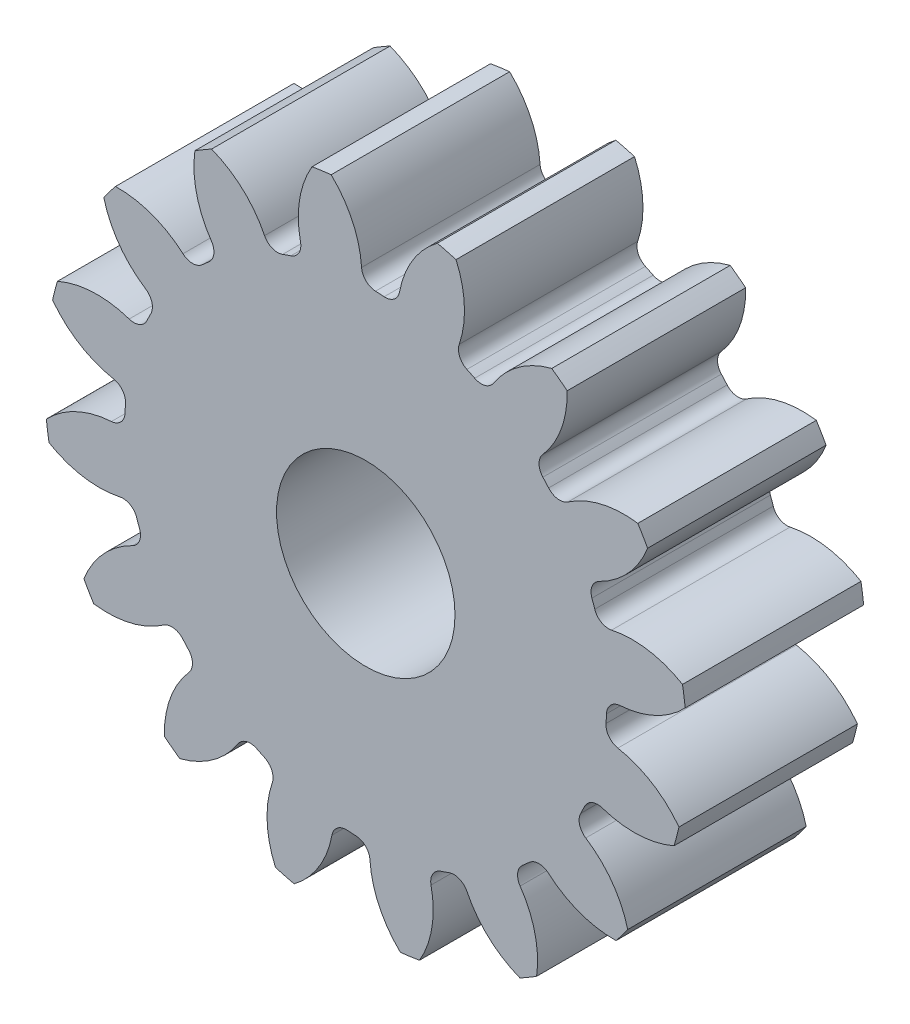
ISO-10303-21;
HEADER;
FILE_DESCRIPTION(('STEP AP214'),'2;1');
FILE_NAME('part.step','',(''),(''),'','','');
FILE_SCHEMA(('AUTOMOTIVE_DESIGN { 1 0 10303 214 1 1 1 1 }'));
ENDSEC;
DATA;
#1=APPLICATION_CONTEXT('core data for automotive mechanical design processes');
#2=APPLICATION_PROTOCOL_DEFINITION('international standard','automotive_design',2000,#1);
#3=PRODUCT_CONTEXT('',#1,'mechanical');
#4=PRODUCT('Part','Part','',(#3));
#5=PRODUCT_RELATED_PRODUCT_CATEGORY('part','',(#4));
#6=PRODUCT_DEFINITION_FORMATION('','',#4);
#7=PRODUCT_DEFINITION_CONTEXT('part definition',#1,'design');
#8=PRODUCT_DEFINITION('design','',#6,#7);
#9=PRODUCT_DEFINITION_SHAPE('','',#8);
#10=(LENGTH_UNIT() NAMED_UNIT(*) SI_UNIT(.MILLI.,.METRE.));
#11=(NAMED_UNIT(*) PLANE_ANGLE_UNIT() SI_UNIT($,.RADIAN.));
#12=(NAMED_UNIT(*) SI_UNIT($,.STERADIAN.) SOLID_ANGLE_UNIT());
#13=UNCERTAINTY_MEASURE_WITH_UNIT(LENGTH_MEASURE(1.E-05),#10,'distance_accuracy_value','');
#14=(GEOMETRIC_REPRESENTATION_CONTEXT(3) GLOBAL_UNCERTAINTY_ASSIGNED_CONTEXT((#13)) GLOBAL_UNIT_ASSIGNED_CONTEXT((#10,
#11,#12)) REPRESENTATION_CONTEXT('',''));
#15=CARTESIAN_POINT('',(0.,0.,0.));
#16=DIRECTION('',(0.,0.,1.));
#17=DIRECTION('',(1.,0.,0.));
#18=AXIS2_PLACEMENT_3D('',#15,#16,#17);
#19=CARTESIAN_POINT('',(0.,0.,101.6));
#20=DIRECTION('',(0.,0.,-1.));
#21=DIRECTION('',(-1.,0.,0.));
#22=AXIS2_PLACEMENT_3D('',#19,#20,#21);
#23=CYLINDRICAL_SURFACE('',#22,182.88);
#24=DIRECTION('',(0.,0.,-1.));
#25=VECTOR('',#24,1.);
#26=CARTESIAN_POINT('',(180.304921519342,30.5815250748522,50.8));
#27=LINE('',#26,#25);
#28=CARTESIAN_POINT('',(180.304921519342,30.5815250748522,101.6));
#29=VERTEX_POINT('',#28);
#30=CARTESIAN_POINT('',(180.304921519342,30.5815250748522,0.));
#31=VERTEX_POINT('',#30);
#32=EDGE_CURVE('E672',#29,#31,#27,.T.);
#33=ORIENTED_EDGE('',*,*,#32,.F.);
#34=CARTESIAN_POINT('',(0.,0.,101.6));
#35=DIRECTION('',(0.,0.,1.));
#36=DIRECTION('',(1.,0.,0.));
#37=AXIS2_PLACEMENT_3D('',#34,#35,#36);
#38=CIRCLE('',#37,182.88);
#39=CARTESIAN_POINT('',(181.817278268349,19.6868413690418,101.6));
#40=VERTEX_POINT('',#39);
#41=EDGE_CURVE('E1241',#40,#29,#38,.T.);
#42=ORIENTED_EDGE('',*,*,#41,.F.);
#43=DIRECTION('',(0.,0.,-1.));
#44=VECTOR('',#43,1.);
#45=CARTESIAN_POINT('',(181.817278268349,19.6868413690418,50.8));
#46=LINE('',#45,#44);
#47=CARTESIAN_POINT('',(181.817278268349,19.6868413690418,0.));
#48=VERTEX_POINT('',#47);
#49=EDGE_CURVE('E1235',#48,#40,#46,.F.);
#50=ORIENTED_EDGE('',*,*,#49,.F.);
#51=CARTESIAN_POINT('',(0.,0.,0.));
#52=DIRECTION('',(0.,0.,1.));
#53=DIRECTION('',(1.,0.,0.));
#54=AXIS2_PLACEMENT_3D('',#51,#52,#53);
#55=CIRCLE('',#54,182.88);
#56=EDGE_CURVE('E1246',#48,#31,#55,.T.);
#57=ORIENTED_EDGE('',*,*,#56,.T.);
#58=EDGE_LOOP('',(#33,#42,#50,#57));
#59=FACE_BOUND('',#58,.T.);
#60=ADVANCED_FACE('F33',(#59),#23,.T.);
#61=DIRECTION('',(0.,0.,-1.));
#62=VECTOR('',#61,1.);
#63=CARTESIAN_POINT('',(160.443434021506,87.7667299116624,50.8));
#64=LINE('',#63,#62);
#65=CARTESIAN_POINT('',(160.443434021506,87.7667299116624,0.));
#66=VERTEX_POINT('',#65);
#67=CARTESIAN_POINT('',(160.443434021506,87.7667299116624,101.6));
#68=VERTEX_POINT('',#67);
#69=EDGE_CURVE('E643',#66,#68,#64,.F.);
#70=ORIENTED_EDGE('',*,*,#69,.F.);
#71=CARTESIAN_POINT('',(154.876983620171,97.2533513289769,0.));
#72=VERTEX_POINT('',#71);
#73=EDGE_CURVE('E1249',#66,#72,#55,.T.);
#74=ORIENTED_EDGE('',*,*,#73,.T.);
#75=DIRECTION('',(0.,0.,-1.));
#76=VECTOR('',#75,1.);
#77=CARTESIAN_POINT('',(154.876983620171,97.2533513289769,50.8));
#78=LINE('',#77,#76);
#79=CARTESIAN_POINT('',(154.876983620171,97.2533513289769,101.6));
#80=VERTEX_POINT('',#79);
#81=EDGE_CURVE('E705',#80,#72,#78,.T.);
#82=ORIENTED_EDGE('',*,*,#81,.F.);
#83=EDGE_CURVE('E1244',#68,#80,#38,.T.);
#84=ORIENTED_EDGE('',*,*,#83,.F.);
#85=EDGE_LOOP('',(#70,#74,#82,#84));
#86=FACE_BOUND('',#85,.T.);
#87=ADVANCED_FACE('F1431',(#86),#23,.T.);
#88=CARTESIAN_POINT('',(0.,0.,101.6));
#89=DIRECTION('',(0.,0.,1.));
#90=DIRECTION('',(1.,0.,0.));
#91=AXIS2_PLACEMENT_3D('',#88,#89,#90);
#92=PLANE('',#91);
#93=CARTESIAN_POINT('',(0.,0.,101.599999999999));
#94=DIRECTION('',(0.,0.,1.));
#95=DIRECTION('',(1.,0.,0.));
#96=AXIS2_PLACEMENT_3D('',#93,#94,#95);
#97=CIRCLE('',#96,50.8);
#98=CARTESIAN_POINT('',(50.8,0.,101.599999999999));
#99=VERTEX_POINT('',#98);
#100=EDGE_CURVE('E660',#99,#99,#97,.T.);
#101=ORIENTED_EDGE('',*,*,#100,.F.);
#102=EDGE_LOOP('',(#101));
#103=FACE_BOUND('',#102,.T.);
#104=ORIENTED_EDGE('',*,*,#41,.T.);
#105=CARTESIAN_POINT('',(151.7151125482,-17.8059617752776,101.6));
#106=DIRECTION('',(0.,0.,-1.));
#107=DIRECTION('',(0.923879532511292,0.382683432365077,0.));
#108=AXIS2_PLACEMENT_3D('',#105,#106,#107);
#109=CIRCLE('',#108,56.2025449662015);
#110=CARTESIAN_POINT('',(139.947110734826,37.1507502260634,101.6));
#111=VERTEX_POINT('',#110);
#112=EDGE_CURVE('E652',#111,#29,#109,.T.);
#113=ORIENTED_EDGE('',*,*,#112,.F.);
#114=CARTESIAN_POINT('',(138.215441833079,45.237665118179,101.6));
#115=DIRECTION('',(0.,0.,1.));
#116=DIRECTION('',(-0.923879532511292,-0.382683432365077,0.));
#117=AXIS2_PLACEMENT_3D('',#114,#115,#116);
#118=CIRCLE('',#117,8.27024000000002);
#119=CARTESIAN_POINT('',(130.355488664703,42.6651166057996,101.6));
#120=VERTEX_POINT('',#119);
#121=EDGE_CURVE('E650',#120,#111,#118,.T.);
#122=ORIENTED_EDGE('',*,*,#121,.F.);
#123=CARTESIAN_POINT('',(0.,0.,101.6));
#124=DIRECTION('',(0.,0.,-1.));
#125=DIRECTION('',(0.923879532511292,0.382683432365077,0.));
#126=AXIS2_PLACEMENT_3D('',#123,#124,#125);
#127=CIRCLE('',#126,137.16);
#128=CARTESIAN_POINT('',(128.737786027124,47.3228068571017,101.6));
#129=VERTEX_POINT('',#128);
#130=EDGE_CURVE('E635',#129,#120,#127,.T.);
#131=ORIENTED_EDGE('',*,*,#130,.F.);
#132=CARTESIAN_POINT('',(136.500197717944,50.17619684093,101.6));
#133=DIRECTION('',(0.,0.,1.));
#134=DIRECTION('',(-0.923879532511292,-0.382683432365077,0.));
#135=AXIS2_PLACEMENT_3D('',#132,#133,#134);
#136=CIRCLE('',#135,8.27024000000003);
#137=CARTESIAN_POINT('',(132.846275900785,57.5954774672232,101.6));
#138=VERTEX_POINT('',#137);
#139=EDGE_CURVE('E627',#138,#129,#136,.T.);
#140=ORIENTED_EDGE('',*,*,#139,.F.);
#141=CARTESIAN_POINT('',(108.015109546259,108.015108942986,101.6));
#142=DIRECTION('',(0.,0.,-1.));
#143=DIRECTION('',(-0.923879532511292,-0.382683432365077,0.));
#144=AXIS2_PLACEMENT_3D('',#141,#142,#143);
#145=CIRCLE('',#144,56.2025449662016);
#146=EDGE_CURVE('E657',#68,#138,#145,.T.);
#147=ORIENTED_EDGE('',*,*,#146,.F.);
#148=ORIENTED_EDGE('',*,*,#83,.T.);
#149=CARTESIAN_POINT('',(146.980533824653,41.6082963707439,101.6));
#150=DIRECTION('',(0.,0.,-1.));
#151=DIRECTION('',(0.707106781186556,0.707106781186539,0.));
#152=AXIS2_PLACEMENT_3D('',#149,#150,#151);
#153=CIRCLE('',#152,56.2025449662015);
#154=CARTESIAN_POINT('',(115.077294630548,87.8782584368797,101.6));
#155=VERTEX_POINT('',#154);
#156=EDGE_CURVE('E681',#155,#80,#153,.T.);
#157=ORIENTED_EDGE('',*,*,#156,.F.);
#158=CARTESIAN_POINT('',(110.382712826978,94.6869125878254,101.6));
#159=DIRECTION('',(0.,0.,1.));
#160=DIRECTION('',(-0.707106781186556,-0.707106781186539,0.));
#161=AXIS2_PLACEMENT_3D('',#158,#159,#160);
#162=CIRCLE('',#161,8.27024000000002);
#163=CARTESIAN_POINT('',(104.105534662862,89.3023138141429,101.6));
#164=VERTEX_POINT('',#163);
#165=EDGE_CURVE('E679',#164,#155,#162,.T.);
#166=ORIENTED_EDGE('',*,*,#165,.F.);
#167=CARTESIAN_POINT('',(0.,0.,101.6));
#168=DIRECTION('',(0.,0.,-1.));
#169=DIRECTION('',(0.707106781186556,0.707106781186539,0.));
#170=AXIS2_PLACEMENT_3D('',#167,#168,#169);
#171=CIRCLE('',#170,137.16);
#172=CARTESIAN_POINT('',(100.828551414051,92.9863905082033,101.6));
#173=VERTEX_POINT('',#172);
#174=EDGE_CURVE('E676',#173,#164,#171,.T.);
#175=ORIENTED_EDGE('',*,*,#174,.F.);
#176=CARTESIAN_POINT('',(106.908139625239,98.5931254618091,101.6));
#177=DIRECTION('',(0.,0.,1.));
#178=DIRECTION('',(-0.707106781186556,-0.707106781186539,0.));
#179=AXIS2_PLACEMENT_3D('',#176,#177,#178);
#180=CIRCLE('',#179,8.27024000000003);
#181=CARTESIAN_POINT('',(100.69312026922,104.049351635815,101.6));
#182=VERTEX_POINT('',#181);
#183=EDGE_CURVE('E674',#182,#173,#180,.T.);
#184=ORIENTED_EDGE('',*,*,#183,.F.);
#185=CARTESIAN_POINT('',(58.4573562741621,141.128541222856,101.6));
#186=DIRECTION('',(0.,0.,-1.));
#187=DIRECTION('',(-0.707106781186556,-0.707106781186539,0.));
#188=AXIS2_PLACEMENT_3D('',#185,#186,#187);
#189=CIRCLE('',#188,56.2025449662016);
#190=CARTESIAN_POINT('',(114.643531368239,142.484929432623,101.6));
#191=VERTEX_POINT('',#190);
#192=EDGE_CURVE('E684',#191,#182,#189,.T.);
#193=ORIENTED_EDGE('',*,*,#192,.F.);
#194=CARTESIAN_POINT('',(105.87042892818,149.11923644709,101.6));
#195=VERTEX_POINT('',#194);
#196=EDGE_CURVE('E1289',#191,#195,#38,.T.);
#197=ORIENTED_EDGE('',*,*,#196,.T.);
#198=CARTESIAN_POINT('',(119.869501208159,94.6880685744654,101.6));
#199=DIRECTION('',(0.,0.,-1.));
#200=DIRECTION('',(0.3826834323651,0.923879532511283,0.));
#201=AXIS2_PLACEMENT_3D('',#198,#199,#200);
#202=CIRCLE('',#201,56.2025449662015);
#203=CARTESIAN_POINT('',(72.6880035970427,125.227098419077,101.6));
#204=VERTEX_POINT('',#203);
#205=EDGE_CURVE('E716',#204,#195,#202,.T.);
#206=ORIENTED_EDGE('',*,*,#205,.F.);
#207=CARTESIAN_POINT('',(65.7452164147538,129.720935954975,101.6));
#208=DIRECTION('',(0.,0.,1.));
#209=DIRECTION('',(-0.3826834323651,-0.923879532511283,0.));
#210=AXIS2_PLACEMENT_3D('',#207,#208,#209);
#211=CIRCLE('',#210,8.27024000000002);
#212=CARTESIAN_POINT('',(62.0064567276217,122.344043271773,101.6));
#213=VERTEX_POINT('',#212);
#214=EDGE_CURVE('E714',#213,#204,#211,.T.);
#215=ORIENTED_EDGE('',*,*,#214,.F.);
#216=CARTESIAN_POINT('',(0.,0.,101.6));
#217=DIRECTION('',(0.,0.,-1.));
#218=DIRECTION('',(0.3826834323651,0.923879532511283,0.));
#219=AXIS2_PLACEMENT_3D('',#216,#217,#218);
#220=CIRCLE('',#219,137.16);
#221=CARTESIAN_POINT('',(57.5690838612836,124.49363912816,101.6));
#222=VERTEX_POINT('',#221);
#223=EDGE_CURVE('E711',#222,#213,#220,.T.);
#224=ORIENTED_EDGE('',*,*,#223,.F.);
#225=CARTESIAN_POINT('',(61.0402863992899,132.000144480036,101.6));
#226=DIRECTION('',(0.,0.,1.));
#227=DIRECTION('',(-0.3826834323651,-0.923879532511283,0.));
#228=AXIS2_PLACEMENT_3D('',#225,#226,#227);
#229=CIRCLE('',#228,8.27024000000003);
#230=CARTESIAN_POINT('',(53.2103498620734,134.662655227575,101.6));
#231=VERTEX_POINT('',#230);
#232=EDGE_CURVE('E709',#231,#222,#229,.T.);
#233=ORIENTED_EDGE('',*,*,#232,.F.);
#234=CARTESIAN_POINT('',(4.265779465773E-07,152.756432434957,101.6));
#235=DIRECTION('',(0.,0.,-1.));
#236=DIRECTION('',(-0.3826834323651,-0.923879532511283,0.));
#237=AXIS2_PLACEMENT_3D('',#234,#235,#236);
#238=CIRCLE('',#237,56.2025449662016);
#239=CARTESIAN_POINT('',(51.3901903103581,175.511090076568,101.6));
#240=VERTEX_POINT('',#239);
#241=EDGE_CURVE('E719',#240,#231,#238,.T.);
#242=ORIENTED_EDGE('',*,*,#241,.F.);
#243=CARTESIAN_POINT('',(40.7460611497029,178.283069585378,101.6));
#244=VERTEX_POINT('',#243);
#245=EDGE_CURVE('E1413',#240,#244,#38,.T.);
#246=ORIENTED_EDGE('',*,*,#245,.T.);
#247=CARTESIAN_POINT('',(74.5094236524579,133.352440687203,101.6));
#248=DIRECTION('',(0.,0.,-1.));
#249=DIRECTION('',(0.,1.,0.));
#250=AXIS2_PLACEMENT_3D('',#247,#248,#249);
#251=CIRCLE('',#250,56.2025449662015);
#252=CARTESIAN_POINT('',(19.232622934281,143.511247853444,101.6));
#253=VERTEX_POINT('',#252);
#254=EDGE_CURVE('E754',#253,#244,#251,.T.);
#255=ORIENTED_EDGE('',*,*,#254,.F.);
#256=CARTESIAN_POINT('',(11.0986067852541,145.006122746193,101.6));
#257=DIRECTION('',(0.,0.,1.));
#258=DIRECTION('',(0.,-1.,0.));
#259=AXIS2_PLACEMENT_3D('',#256,#257,#258);
#260=CIRCLE('',#259,8.27024000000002);
#261=CARTESIAN_POINT('',(10.4674578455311,136.76000119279,101.6));
#262=VERTEX_POINT('',#261);
#263=EDGE_CURVE('E752',#262,#253,#260,.T.);
#264=ORIENTED_EDGE('',*,*,#263,.F.);
#265=CARTESIAN_POINT('',(0.,0.,101.6));
#266=DIRECTION('',(0.,0.,-1.));
#267=DIRECTION('',(0.,1.,0.));
#268=AXIS2_PLACEMENT_3D('',#265,#266,#267);
#269=CIRCLE('',#268,137.16);
#270=CARTESIAN_POINT('',(5.54524515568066,137.047859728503,101.6));
#271=VERTEX_POINT('',#270);
#272=EDGE_CURVE('E749',#271,#262,#269,.T.);
#273=ORIENTED_EDGE('',*,*,#272,.F.);
#274=CARTESIAN_POINT('',(5.87960290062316,145.311338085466,101.6));
#275=DIRECTION('',(0.,0.,1.));
#276=DIRECTION('',(0.,-1.,0.));
#277=AXIS2_PLACEMENT_3D('',#274,#275,#276);
#278=CIRCLE('',#277,8.27024000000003);
#279=CARTESIAN_POINT('',(-2.37321395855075,144.774790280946,101.6));
#280=VERTEX_POINT('',#279);
#281=EDGE_CURVE('E747',#280,#271,#278,.T.);
#282=ORIENTED_EDGE('',*,*,#281,.F.);
#283=CARTESIAN_POINT('',(-58.4573554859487,141.128541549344,101.6));
#284=DIRECTION('',(0.,0.,-1.));
#285=DIRECTION('',(0.,-1.,0.));
#286=AXIS2_PLACEMENT_3D('',#283,#284,#285);
#287=CIRCLE('',#286,56.2025449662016);
#288=CARTESIAN_POINT('',(-19.6868413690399,181.817278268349,101.6));
#289=VERTEX_POINT('',#288);
#290=EDGE_CURVE('E757',#289,#280,#287,.T.);
#291=ORIENTED_EDGE('',*,*,#290,.F.);
#292=CARTESIAN_POINT('',(-30.5815250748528,180.304921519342,101.6));
#293=VERTEX_POINT('',#292);
#294=EDGE_CURVE('E1409',#289,#293,#38,.T.);
#295=ORIENTED_EDGE('',*,*,#294,.T.);
#296=CARTESIAN_POINT('',(17.8059617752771,151.7151125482,101.6));
#297=DIRECTION('',(0.,0.,-1.));
#298=DIRECTION('',(-0.382683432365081,0.923879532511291,0.));
#299=AXIS2_PLACEMENT_3D('',#296,#297,#298);
#300=CIRCLE('',#299,56.2025449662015);
#301=CARTESIAN_POINT('',(-37.1507502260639,139.947110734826,101.6));
#302=VERTEX_POINT('',#301);
#303=EDGE_CURVE('E792',#302,#293,#300,.T.);
#304=ORIENTED_EDGE('',*,*,#303,.F.);
#305=CARTESIAN_POINT('',(-45.2376651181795,138.215441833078,101.6));
#306=DIRECTION('',(0.,0.,1.));
#307=DIRECTION('',(0.382683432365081,-0.923879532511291,0.));
#308=AXIS2_PLACEMENT_3D('',#305,#306,#307);
#309=CIRCLE('',#308,8.27024000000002);
#310=CARTESIAN_POINT('',(-42.6651166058,130.355488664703,101.6));
#311=VERTEX_POINT('',#310);
#312=EDGE_CURVE('E790',#311,#302,#309,.T.);
#313=ORIENTED_EDGE('',*,*,#312,.F.);
#314=CARTESIAN_POINT('',(0.,0.,101.6));
#315=DIRECTION('',(0.,0.,-1.));
#316=DIRECTION('',(-0.382683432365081,0.923879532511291,0.));
#317=AXIS2_PLACEMENT_3D('',#314,#315,#316);
#318=CIRCLE('',#317,137.16);
#319=CARTESIAN_POINT('',(-47.3228068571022,128.737786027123,101.6));
#320=VERTEX_POINT('',#319);
#321=EDGE_CURVE('E787',#320,#311,#318,.T.);
#322=ORIENTED_EDGE('',*,*,#321,.F.);
#323=CARTESIAN_POINT('',(-50.1761968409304,136.500197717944,101.6));
#324=DIRECTION('',(0.,0.,1.));
#325=DIRECTION('',(0.382683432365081,-0.923879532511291,0.));
#326=AXIS2_PLACEMENT_3D('',#323,#324,#325);
#327=CIRCLE('',#326,8.27024000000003);
#328=CARTESIAN_POINT('',(-57.5954774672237,132.846275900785,101.6));
#329=VERTEX_POINT('',#328);
#330=EDGE_CURVE('E785',#329,#320,#327,.T.);
#331=ORIENTED_EDGE('',*,*,#330,.F.);
#332=CARTESIAN_POINT('',(-108.015108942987,108.015109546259,101.6));
#333=DIRECTION('',(0.,0.,-1.));
#334=DIRECTION('',(0.382683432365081,-0.923879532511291,0.));
#335=AXIS2_PLACEMENT_3D('',#332,#333,#334);
#336=CIRCLE('',#335,56.2025449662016);
#337=CARTESIAN_POINT('',(-87.766729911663,160.443434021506,101.6));
#338=VERTEX_POINT('',#337);
#339=EDGE_CURVE('E795',#338,#329,#336,.T.);
#340=ORIENTED_EDGE('',*,*,#339,.F.);
#341=CARTESIAN_POINT('',(-97.2533513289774,154.87698362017,101.6));
#342=VERTEX_POINT('',#341);
#343=EDGE_CURVE('E1405',#338,#342,#38,.T.);
#344=ORIENTED_EDGE('',*,*,#343,.T.);
#345=CARTESIAN_POINT('',(-41.6082963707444,146.980533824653,101.6));
#346=DIRECTION('',(0.,0.,-1.));
#347=DIRECTION('',(-0.707106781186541,0.707106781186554,0.));
#348=AXIS2_PLACEMENT_3D('',#345,#346,#347);
#349=CIRCLE('',#348,56.2025449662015);
#350=CARTESIAN_POINT('',(-87.8782584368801,115.077294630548,101.6));
#351=VERTEX_POINT('',#350);
#352=EDGE_CURVE('E830',#351,#342,#349,.T.);
#353=ORIENTED_EDGE('',*,*,#352,.F.);
#354=CARTESIAN_POINT('',(-94.6869125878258,110.382712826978,101.6));
#355=DIRECTION('',(0.,0.,1.));
#356=DIRECTION('',(0.707106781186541,-0.707106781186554,0.));
#357=AXIS2_PLACEMENT_3D('',#354,#355,#356);
#358=CIRCLE('',#357,8.27024000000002);
#359=CARTESIAN_POINT('',(-89.3023138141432,104.105534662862,101.6));
#360=VERTEX_POINT('',#359);
#361=EDGE_CURVE('E828',#360,#351,#358,.T.);
#362=ORIENTED_EDGE('',*,*,#361,.F.);
#363=CARTESIAN_POINT('',(0.,0.,101.6));
#364=DIRECTION('',(0.,0.,-1.));
#365=DIRECTION('',(-0.707106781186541,0.707106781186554,0.));
#366=AXIS2_PLACEMENT_3D('',#363,#364,#365);
#367=CIRCLE('',#366,137.16);
#368=CARTESIAN_POINT('',(-92.9863905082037,100.828551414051,101.6));
#369=VERTEX_POINT('',#368);
#370=EDGE_CURVE('E825',#369,#360,#367,.T.);
#371=ORIENTED_EDGE('',*,*,#370,.F.);
#372=CARTESIAN_POINT('',(-98.5931254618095,106.908139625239,101.6));
#373=DIRECTION('',(0.,0.,1.));
#374=DIRECTION('',(0.707106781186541,-0.707106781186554,0.));
#375=AXIS2_PLACEMENT_3D('',#372,#373,#374);
#376=CIRCLE('',#375,8.27024000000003);
#377=CARTESIAN_POINT('',(-104.049351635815,100.693120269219,101.6));
#378=VERTEX_POINT('',#377);
#379=EDGE_CURVE('E823',#378,#369,#376,.T.);
#380=ORIENTED_EDGE('',*,*,#379,.F.);
#381=CARTESIAN_POINT('',(-141.128541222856,58.4573562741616,101.6));
#382=DIRECTION('',(0.,0.,-1.));
#383=DIRECTION('',(0.707106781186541,-0.707106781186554,0.));
#384=AXIS2_PLACEMENT_3D('',#381,#382,#383);
#385=CIRCLE('',#384,56.2025449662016);
#386=CARTESIAN_POINT('',(-142.484929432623,114.643531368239,101.6));
#387=VERTEX_POINT('',#386);
#388=EDGE_CURVE('E833',#387,#378,#385,.T.);
#389=ORIENTED_EDGE('',*,*,#388,.F.);
#390=CARTESIAN_POINT('',(-149.11923644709,105.87042892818,101.6));
#391=VERTEX_POINT('',#390);
#392=EDGE_CURVE('E1401',#387,#391,#38,.T.);
#393=ORIENTED_EDGE('',*,*,#392,.T.);
#394=CARTESIAN_POINT('',(-94.6880685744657,119.869501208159,101.6));
#395=DIRECTION('',(0.,0.,-1.));
#396=DIRECTION('',(-0.923879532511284,0.382683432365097,0.));
#397=AXIS2_PLACEMENT_3D('',#394,#395,#396);
#398=CIRCLE('',#397,56.2025449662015);
#399=CARTESIAN_POINT('',(-125.227098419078,72.6880035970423,101.6));
#400=VERTEX_POINT('',#399);
#401=EDGE_CURVE('E868',#400,#391,#398,.T.);
#402=ORIENTED_EDGE('',*,*,#401,.F.);
#403=CARTESIAN_POINT('',(-129.720935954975,65.7452164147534,101.6));
#404=DIRECTION('',(0.,0.,1.));
#405=DIRECTION('',(0.923879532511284,-0.382683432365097,0.));
#406=AXIS2_PLACEMENT_3D('',#403,#404,#405);
#407=CIRCLE('',#406,8.27024000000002);
#408=CARTESIAN_POINT('',(-122.344043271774,62.0064567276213,101.6));
#409=VERTEX_POINT('',#408);
#410=EDGE_CURVE('E866',#409,#400,#407,.T.);
#411=ORIENTED_EDGE('',*,*,#410,.F.);
#412=CARTESIAN_POINT('',(0.,0.,101.6));
#413=DIRECTION('',(0.,0.,-1.));
#414=DIRECTION('',(-0.923879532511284,0.382683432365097,0.));
#415=AXIS2_PLACEMENT_3D('',#412,#413,#414);
#416=CIRCLE('',#415,137.16);
#417=CARTESIAN_POINT('',(-124.49363912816,57.5690838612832,101.6));
#418=VERTEX_POINT('',#417);
#419=EDGE_CURVE('E863',#418,#409,#416,.T.);
#420=ORIENTED_EDGE('',*,*,#419,.F.);
#421=CARTESIAN_POINT('',(-132.000144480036,61.0402863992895,101.6));
#422=DIRECTION('',(0.,0.,1.));
#423=DIRECTION('',(0.923879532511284,-0.382683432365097,0.));
#424=AXIS2_PLACEMENT_3D('',#421,#422,#423);
#425=CIRCLE('',#424,8.27024000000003);
#426=CARTESIAN_POINT('',(-134.662655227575,53.210349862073,101.6));
#427=VERTEX_POINT('',#426);
#428=EDGE_CURVE('E861',#427,#418,#425,.T.);
#429=ORIENTED_EDGE('',*,*,#428,.F.);
#430=CARTESIAN_POINT('',(-152.756432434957,4.26577495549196E-07,101.6));
#431=DIRECTION('',(0.,0.,-1.));
#432=DIRECTION('',(0.923879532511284,-0.382683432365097,0.));
#433=AXIS2_PLACEMENT_3D('',#430,#431,#432);
#434=CIRCLE('',#433,56.2025449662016);
#435=CARTESIAN_POINT('',(-175.511090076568,51.3901903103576,101.6));
#436=VERTEX_POINT('',#435);
#437=EDGE_CURVE('E871',#436,#427,#434,.T.);
#438=ORIENTED_EDGE('',*,*,#437,.F.);
#439=CARTESIAN_POINT('',(-178.283069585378,40.7460611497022,101.6));
#440=VERTEX_POINT('',#439);
#441=EDGE_CURVE('E1397',#436,#440,#38,.T.);
#442=ORIENTED_EDGE('',*,*,#441,.T.);
#443=CARTESIAN_POINT('',(-133.352440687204,74.5094236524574,101.6));
#444=DIRECTION('',(0.,0.,-1.));
#445=DIRECTION('',(-1.,0.,0.));
#446=AXIS2_PLACEMENT_3D('',#443,#444,#445);
#447=CIRCLE('',#446,56.2025449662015);
#448=CARTESIAN_POINT('',(-143.511247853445,19.2326229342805,101.6));
#449=VERTEX_POINT('',#448);
#450=EDGE_CURVE('E906',#449,#440,#447,.T.);
#451=ORIENTED_EDGE('',*,*,#450,.F.);
#452=CARTESIAN_POINT('',(-145.006122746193,11.0986067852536,101.6));
#453=DIRECTION('',(0.,0.,1.));
#454=DIRECTION('',(1.,0.,0.));
#455=AXIS2_PLACEMENT_3D('',#452,#453,#454);
#456=CIRCLE('',#455,8.27024000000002);
#457=CARTESIAN_POINT('',(-136.76000119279,10.4674578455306,101.6));
#458=VERTEX_POINT('',#457);
#459=EDGE_CURVE('E904',#458,#449,#456,.T.);
#460=ORIENTED_EDGE('',*,*,#459,.F.);
#461=CARTESIAN_POINT('',(0.,0.,101.6));
#462=DIRECTION('',(0.,0.,-1.));
#463=DIRECTION('',(-1.,0.,0.));
#464=AXIS2_PLACEMENT_3D('',#461,#462,#463);
#465=CIRCLE('',#464,137.16);
#466=CARTESIAN_POINT('',(-137.047859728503,5.54524515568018,101.6));
#467=VERTEX_POINT('',#466);
#468=EDGE_CURVE('E901',#467,#458,#465,.T.);
#469=ORIENTED_EDGE('',*,*,#468,.F.);
#470=CARTESIAN_POINT('',(-145.311338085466,5.87960290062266,101.6));
#471=DIRECTION('',(0.,0.,1.));
#472=DIRECTION('',(1.,0.,0.));
#473=AXIS2_PLACEMENT_3D('',#470,#471,#472);
#474=CIRCLE('',#473,8.27024000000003);
#475=CARTESIAN_POINT('',(-144.774790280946,-2.37321395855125,101.6));
#476=VERTEX_POINT('',#475);
#477=EDGE_CURVE('E899',#476,#467,#474,.T.);
#478=ORIENTED_EDGE('',*,*,#477,.F.);
#479=CARTESIAN_POINT('',(-141.128541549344,-58.4573554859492,101.6));
#480=DIRECTION('',(0.,0.,-1.));
#481=DIRECTION('',(1.,0.,0.));
#482=AXIS2_PLACEMENT_3D('',#479,#480,#481);
#483=CIRCLE('',#482,56.2025449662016);
#484=CARTESIAN_POINT('',(-181.817278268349,-19.6868413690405,101.6));
#485=VERTEX_POINT('',#484);
#486=EDGE_CURVE('E909',#485,#476,#483,.T.);
#487=ORIENTED_EDGE('',*,*,#486,.F.);
#488=CARTESIAN_POINT('',(-180.304921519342,-30.5815250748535,101.6));
#489=VERTEX_POINT('',#488);
#490=EDGE_CURVE('E1393',#485,#489,#38,.T.);
#491=ORIENTED_EDGE('',*,*,#490,.T.);
#492=CARTESIAN_POINT('',(-151.7151125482,17.8059617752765,101.6));
#493=DIRECTION('',(0.,0.,-1.));
#494=DIRECTION('',(-0.923879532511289,-0.382683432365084,0.));
#495=AXIS2_PLACEMENT_3D('',#492,#493,#494);
#496=CIRCLE('',#495,56.2025449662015);
#497=CARTESIAN_POINT('',(-139.947110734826,-37.1507502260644,101.6));
#498=VERTEX_POINT('',#497);
#499=EDGE_CURVE('E944',#498,#489,#496,.T.);
#500=ORIENTED_EDGE('',*,*,#499,.F.);
#501=CARTESIAN_POINT('',(-138.215441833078,-45.23766511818,101.6));
#502=DIRECTION('',(0.,0.,1.));
#503=DIRECTION('',(0.923879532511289,0.382683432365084,0.));
#504=AXIS2_PLACEMENT_3D('',#501,#502,#503);
#505=CIRCLE('',#504,8.27024000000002);
#506=CARTESIAN_POINT('',(-130.355488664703,-42.6651166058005,101.6));
#507=VERTEX_POINT('',#506);
#508=EDGE_CURVE('E942',#507,#498,#505,.T.);
#509=ORIENTED_EDGE('',*,*,#508,.F.);
#510=CARTESIAN_POINT('',(0.,0.,101.6));
#511=DIRECTION('',(0.,0.,-1.));
#512=DIRECTION('',(-0.923879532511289,-0.382683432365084,0.));
#513=AXIS2_PLACEMENT_3D('',#510,#511,#512);
#514=CIRCLE('',#513,137.16);
#515=CARTESIAN_POINT('',(-128.737786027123,-47.3228068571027,101.6));
#516=VERTEX_POINT('',#515);
#517=EDGE_CURVE('E939',#516,#507,#514,.T.);
#518=ORIENTED_EDGE('',*,*,#517,.F.);
#519=CARTESIAN_POINT('',(-136.500197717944,-50.176196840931,101.6));
#520=DIRECTION('',(0.,0.,1.));
#521=DIRECTION('',(0.923879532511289,0.382683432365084,0.));
#522=AXIS2_PLACEMENT_3D('',#519,#520,#521);
#523=CIRCLE('',#522,8.27024000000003);
#524=CARTESIAN_POINT('',(-132.846275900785,-57.5954774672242,101.6));
#525=VERTEX_POINT('',#524);
#526=EDGE_CURVE('E937',#525,#516,#523,.T.);
#527=ORIENTED_EDGE('',*,*,#526,.F.);
#528=CARTESIAN_POINT('',(-108.015109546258,-108.015108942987,101.6));
#529=DIRECTION('',(0.,0.,-1.));
#530=DIRECTION('',(0.923879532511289,0.382683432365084,0.));
#531=AXIS2_PLACEMENT_3D('',#528,#529,#530);
#532=CIRCLE('',#531,56.2025449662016);
#533=CARTESIAN_POINT('',(-160.443434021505,-87.7667299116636,101.6));
#534=VERTEX_POINT('',#533);
#535=EDGE_CURVE('E947',#534,#525,#532,.T.);
#536=ORIENTED_EDGE('',*,*,#535,.F.);
#537=CARTESIAN_POINT('',(-154.87698362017,-97.253351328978,101.6));
#538=VERTEX_POINT('',#537);
#539=EDGE_CURVE('E1389',#534,#538,#38,.T.);
#540=ORIENTED_EDGE('',*,*,#539,.T.);
#541=CARTESIAN_POINT('',(-146.980533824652,-41.6082963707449,101.6));
#542=DIRECTION('',(0.,0.,-1.));
#543=DIRECTION('',(-0.707106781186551,-0.707106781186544,0.));
#544=AXIS2_PLACEMENT_3D('',#541,#542,#543);
#545=CIRCLE('',#544,56.2025449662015);
#546=CARTESIAN_POINT('',(-115.077294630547,-87.8782584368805,101.6));
#547=VERTEX_POINT('',#546);
#548=EDGE_CURVE('E982',#547,#538,#545,.T.);
#549=ORIENTED_EDGE('',*,*,#548,.F.);
#550=CARTESIAN_POINT('',(-110.382712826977,-94.6869125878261,101.6));
#551=DIRECTION('',(0.,0.,1.));
#552=DIRECTION('',(0.707106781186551,0.707106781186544,0.));
#553=AXIS2_PLACEMENT_3D('',#550,#551,#552);
#554=CIRCLE('',#553,8.27024000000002);
#555=CARTESIAN_POINT('',(-104.105534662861,-89.3023138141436,101.6));
#556=VERTEX_POINT('',#555);
#557=EDGE_CURVE('E980',#556,#547,#554,.T.);
#558=ORIENTED_EDGE('',*,*,#557,.F.);
#559=CARTESIAN_POINT('',(0.,0.,101.6));
#560=DIRECTION('',(0.,0.,-1.));
#561=DIRECTION('',(-0.707106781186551,-0.707106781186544,0.));
#562=AXIS2_PLACEMENT_3D('',#559,#560,#561);
#563=CIRCLE('',#562,137.16);
#564=CARTESIAN_POINT('',(-100.82855141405,-92.986390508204,101.6));
#565=VERTEX_POINT('',#564);
#566=EDGE_CURVE('E977',#565,#556,#563,.T.);
#567=ORIENTED_EDGE('',*,*,#566,.F.);
#568=CARTESIAN_POINT('',(-106.908139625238,-98.5931254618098,101.6));
#569=DIRECTION('',(0.,0.,1.));
#570=DIRECTION('',(0.707106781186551,0.707106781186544,0.));
#571=AXIS2_PLACEMENT_3D('',#568,#569,#570);
#572=CIRCLE('',#571,8.27024000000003);
#573=CARTESIAN_POINT('',(-100.693120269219,-104.049351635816,101.6));
#574=VERTEX_POINT('',#573);
#575=EDGE_CURVE('E975',#574,#565,#572,.T.);
#576=ORIENTED_EDGE('',*,*,#575,.F.);
#577=CARTESIAN_POINT('',(-58.4573562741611,-141.128541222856,101.6));
#578=DIRECTION('',(0.,0.,-1.));
#579=DIRECTION('',(0.707106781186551,0.707106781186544,0.));
#580=AXIS2_PLACEMENT_3D('',#577,#578,#579);
#581=CIRCLE('',#580,56.2025449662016);
#582=CARTESIAN_POINT('',(-114.643531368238,-142.484929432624,101.6));
#583=VERTEX_POINT('',#582);
#584=EDGE_CURVE('E985',#583,#574,#581,.T.);
#585=ORIENTED_EDGE('',*,*,#584,.F.);
#586=CARTESIAN_POINT('',(-105.870428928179,-149.119236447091,101.6));
#587=VERTEX_POINT('',#586);
#588=EDGE_CURVE('E1385',#583,#587,#38,.T.);
#589=ORIENTED_EDGE('',*,*,#588,.T.);
#590=CARTESIAN_POINT('',(-119.869501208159,-94.6880685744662,101.6));
#591=DIRECTION('',(0.,0.,-1.));
#592=DIRECTION('',(-0.382683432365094,-0.923879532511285,0.));
#593=AXIS2_PLACEMENT_3D('',#590,#591,#592);
#594=CIRCLE('',#593,56.2025449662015);
#595=CARTESIAN_POINT('',(-72.6880035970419,-125.227098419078,101.6));
#596=VERTEX_POINT('',#595);
#597=EDGE_CURVE('E1020',#596,#587,#594,.T.);
#598=ORIENTED_EDGE('',*,*,#597,.F.);
#599=CARTESIAN_POINT('',(-65.7452164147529,-129.720935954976,101.6));
#600=DIRECTION('',(0.,0.,1.));
#601=DIRECTION('',(0.382683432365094,0.923879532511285,0.));
#602=AXIS2_PLACEMENT_3D('',#599,#600,#601);
#603=CIRCLE('',#602,8.27024000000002);
#604=CARTESIAN_POINT('',(-62.0064567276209,-122.344043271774,101.6));
#605=VERTEX_POINT('',#604);
#606=EDGE_CURVE('E1018',#605,#596,#603,.T.);
#607=ORIENTED_EDGE('',*,*,#606,.F.);
#608=CARTESIAN_POINT('',(0.,0.,101.6));
#609=DIRECTION('',(0.,0.,-1.));
#610=DIRECTION('',(-0.382683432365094,-0.923879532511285,0.));
#611=AXIS2_PLACEMENT_3D('',#608,#609,#610);
#612=CIRCLE('',#611,137.16);
#613=CARTESIAN_POINT('',(-57.5690838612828,-124.49363912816,101.6));
#614=VERTEX_POINT('',#613);
#615=EDGE_CURVE('E1015',#614,#605,#612,.T.);
#616=ORIENTED_EDGE('',*,*,#615,.F.);
#617=CARTESIAN_POINT('',(-61.0402863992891,-132.000144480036,101.6));
#618=DIRECTION('',(0.,0.,1.));
#619=DIRECTION('',(0.382683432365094,0.923879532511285,0.));
#620=AXIS2_PLACEMENT_3D('',#617,#618,#619);
#621=CIRCLE('',#620,8.27024000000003);
#622=CARTESIAN_POINT('',(-53.2103498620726,-134.662655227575,101.6));
#623=VERTEX_POINT('',#622);
#624=EDGE_CURVE('E1013',#623,#614,#621,.T.);
#625=ORIENTED_EDGE('',*,*,#624,.F.);
#626=CARTESIAN_POINT('',(-4.26576954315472E-07,-152.756432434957,101.6));
#627=DIRECTION('',(0.,0.,-1.));
#628=DIRECTION('',(0.382683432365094,0.923879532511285,0.));
#629=AXIS2_PLACEMENT_3D('',#626,#627,#628);
#630=CIRCLE('',#629,56.2025449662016);
#631=CARTESIAN_POINT('',(-51.3901903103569,-175.511090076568,101.6));
#632=VERTEX_POINT('',#631);
#633=EDGE_CURVE('E1023',#632,#623,#630,.T.);
#634=ORIENTED_EDGE('',*,*,#633,.F.);
#635=CARTESIAN_POINT('',(-40.7460611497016,-178.283069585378,101.6));
#636=VERTEX_POINT('',#635);
#637=EDGE_CURVE('E1381',#632,#636,#38,.T.);
#638=ORIENTED_EDGE('',*,*,#637,.T.);
#639=CARTESIAN_POINT('',(-74.509423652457,-133.352440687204,101.6));
#640=DIRECTION('',(0.,0.,-1.));
#641=DIRECTION('',(0.,-1.,0.));
#642=AXIS2_PLACEMENT_3D('',#639,#640,#641);
#643=CIRCLE('',#642,56.2025449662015);
#644=CARTESIAN_POINT('',(-19.23262293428,-143.511247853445,101.6));
#645=VERTEX_POINT('',#644);
#646=EDGE_CURVE('E1058',#645,#636,#643,.T.);
#647=ORIENTED_EDGE('',*,*,#646,.F.);
#648=CARTESIAN_POINT('',(-11.0986067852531,-145.006122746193,101.6));
#649=DIRECTION('',(0.,0.,1.));
#650=DIRECTION('',(0.,1.,0.));
#651=AXIS2_PLACEMENT_3D('',#648,#649,#650);
#652=CIRCLE('',#651,8.27024000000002);
#653=CARTESIAN_POINT('',(-10.4674578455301,-136.76000119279,101.6));
#654=VERTEX_POINT('',#653);
#655=EDGE_CURVE('E1056',#654,#645,#652,.T.);
#656=ORIENTED_EDGE('',*,*,#655,.F.);
#657=CARTESIAN_POINT('',(0.,0.,101.6));
#658=DIRECTION('',(0.,0.,-1.));
#659=DIRECTION('',(0.,-1.,0.));
#660=AXIS2_PLACEMENT_3D('',#657,#658,#659);
#661=CIRCLE('',#660,137.16);
#662=CARTESIAN_POINT('',(-5.5452451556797,-137.047859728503,101.6));
#663=VERTEX_POINT('',#662);
#664=EDGE_CURVE('E1053',#663,#654,#661,.T.);
#665=ORIENTED_EDGE('',*,*,#664,.F.);
#666=CARTESIAN_POINT('',(-5.87960290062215,-145.311338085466,101.6));
#667=DIRECTION('',(0.,0.,1.));
#668=DIRECTION('',(0.,1.,0.));
#669=AXIS2_PLACEMENT_3D('',#666,#667,#668);
#670=CIRCLE('',#669,8.27024000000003);
#671=CARTESIAN_POINT('',(2.37321395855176,-144.774790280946,101.6));
#672=VERTEX_POINT('',#671);
#673=EDGE_CURVE('E1051',#672,#663,#670,.T.);
#674=ORIENTED_EDGE('',*,*,#673,.F.);
#675=CARTESIAN_POINT('',(58.4573554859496,-141.128541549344,101.6));
#676=DIRECTION('',(0.,0.,-1.));
#677=DIRECTION('',(0.,1.,0.));
#678=AXIS2_PLACEMENT_3D('',#675,#676,#677);
#679=CIRCLE('',#678,56.2025449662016);
#680=CARTESIAN_POINT('',(19.6868413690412,-181.817278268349,101.6));
#681=VERTEX_POINT('',#680);
#682=EDGE_CURVE('E1061',#681,#672,#679,.T.);
#683=ORIENTED_EDGE('',*,*,#682,.F.);
#684=CARTESIAN_POINT('',(30.5815250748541,-180.304921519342,101.6));
#685=VERTEX_POINT('',#684);
#686=EDGE_CURVE('E1377',#681,#685,#38,.T.);
#687=ORIENTED_EDGE('',*,*,#686,.T.);
#688=CARTESIAN_POINT('',(-17.8059617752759,-151.7151125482,101.6));
#689=DIRECTION('',(0.,0.,-1.));
#690=DIRECTION('',(0.382683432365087,-0.923879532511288,0.));
#691=AXIS2_PLACEMENT_3D('',#688,#689,#690);
#692=CIRCLE('',#691,56.2025449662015);
#693=CARTESIAN_POINT('',(37.1507502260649,-139.947110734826,101.6));
#694=VERTEX_POINT('',#693);
#695=EDGE_CURVE('E1096',#694,#685,#692,.T.);
#696=ORIENTED_EDGE('',*,*,#695,.F.);
#697=CARTESIAN_POINT('',(45.2376651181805,-138.215441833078,101.6));
#698=DIRECTION('',(0.,0.,1.));
#699=DIRECTION('',(-0.382683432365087,0.923879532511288,0.));
#700=AXIS2_PLACEMENT_3D('',#697,#698,#699);
#701=CIRCLE('',#700,8.27024000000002);
#702=CARTESIAN_POINT('',(42.665116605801,-130.355488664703,101.6));
#703=VERTEX_POINT('',#702);
#704=EDGE_CURVE('E1094',#703,#694,#701,.T.);
#705=ORIENTED_EDGE('',*,*,#704,.F.);
#706=CARTESIAN_POINT('',(0.,0.,101.6));
#707=DIRECTION('',(0.,0.,-1.));
#708=DIRECTION('',(0.382683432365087,-0.923879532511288,0.));
#709=AXIS2_PLACEMENT_3D('',#706,#707,#708);
#710=CIRCLE('',#709,137.16);
#711=CARTESIAN_POINT('',(47.3228068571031,-128.737786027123,101.6));
#712=VERTEX_POINT('',#711);
#713=EDGE_CURVE('E1091',#712,#703,#710,.T.);
#714=ORIENTED_EDGE('',*,*,#713,.F.);
#715=CARTESIAN_POINT('',(50.1761968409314,-136.500197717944,101.6));
#716=DIRECTION('',(0.,0.,1.));
#717=DIRECTION('',(-0.382683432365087,0.923879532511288,0.));
#718=AXIS2_PLACEMENT_3D('',#715,#716,#717);
#719=CIRCLE('',#718,8.27024000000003);
#720=CARTESIAN_POINT('',(57.5954774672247,-132.846275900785,101.6));
#721=VERTEX_POINT('',#720);
#722=EDGE_CURVE('E1089',#721,#712,#719,.T.);
#723=ORIENTED_EDGE('',*,*,#722,.F.);
#724=CARTESIAN_POINT('',(108.015108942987,-108.015109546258,101.6));
#725=DIRECTION('',(0.,0.,-1.));
#726=DIRECTION('',(-0.382683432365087,0.923879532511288,0.));
#727=AXIS2_PLACEMENT_3D('',#724,#725,#726);
#728=CIRCLE('',#727,56.2025449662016);
#729=CARTESIAN_POINT('',(87.7667299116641,-160.443434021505,101.6));
#730=VERTEX_POINT('',#729);
#731=EDGE_CURVE('E1099',#730,#721,#728,.T.);
#732=ORIENTED_EDGE('',*,*,#731,.F.);
#733=CARTESIAN_POINT('',(97.2533513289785,-154.87698362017,101.6));
#734=VERTEX_POINT('',#733);
#735=EDGE_CURVE('E1373',#730,#734,#38,.T.);
#736=ORIENTED_EDGE('',*,*,#735,.T.);
#737=CARTESIAN_POINT('',(41.6082963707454,-146.980533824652,101.6));
#738=DIRECTION('',(0.,0.,-1.));
#739=DIRECTION('',(0.707106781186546,-0.707106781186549,0.));
#740=AXIS2_PLACEMENT_3D('',#737,#738,#739);
#741=CIRCLE('',#740,56.2025449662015);
#742=CARTESIAN_POINT('',(87.8782584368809,-115.077294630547,101.6));
#743=VERTEX_POINT('',#742);
#744=EDGE_CURVE('E1134',#743,#734,#741,.T.);
#745=ORIENTED_EDGE('',*,*,#744,.F.);
#746=CARTESIAN_POINT('',(94.6869125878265,-110.382712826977,101.6));
#747=DIRECTION('',(0.,0.,1.));
#748=DIRECTION('',(-0.707106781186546,0.707106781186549,0.));
#749=AXIS2_PLACEMENT_3D('',#746,#747,#748);
#750=CIRCLE('',#749,8.27024000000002);
#751=CARTESIAN_POINT('',(89.302313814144,-104.105534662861,101.6));
#752=VERTEX_POINT('',#751);
#753=EDGE_CURVE('E1132',#752,#743,#750,.T.);
#754=ORIENTED_EDGE('',*,*,#753,.F.);
#755=CARTESIAN_POINT('',(0.,0.,101.6));
#756=DIRECTION('',(0.,0.,-1.));
#757=DIRECTION('',(0.707106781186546,-0.707106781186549,0.));
#758=AXIS2_PLACEMENT_3D('',#755,#756,#757);
#759=CIRCLE('',#758,137.16);
#760=CARTESIAN_POINT('',(92.9863905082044,-100.82855141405,101.6));
#761=VERTEX_POINT('',#760);
#762=EDGE_CURVE('E1129',#761,#752,#759,.T.);
#763=ORIENTED_EDGE('',*,*,#762,.F.);
#764=CARTESIAN_POINT('',(98.5931254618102,-106.908139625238,101.6));
#765=DIRECTION('',(0.,0.,1.));
#766=DIRECTION('',(-0.707106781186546,0.707106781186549,0.));
#767=AXIS2_PLACEMENT_3D('',#764,#765,#766);
#768=CIRCLE('',#767,8.27024000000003);
#769=CARTESIAN_POINT('',(104.049351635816,-100.693120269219,101.6));
#770=VERTEX_POINT('',#769);
#771=EDGE_CURVE('E1127',#770,#761,#768,.T.);
#772=ORIENTED_EDGE('',*,*,#771,.F.);
#773=CARTESIAN_POINT('',(141.128541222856,-58.4573562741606,101.6));
#774=DIRECTION('',(0.,0.,-1.));
#775=DIRECTION('',(-0.707106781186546,0.707106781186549,0.));
#776=AXIS2_PLACEMENT_3D('',#773,#774,#775);
#777=CIRCLE('',#776,56.2025449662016);
#778=CARTESIAN_POINT('',(142.484929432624,-114.643531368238,101.6));
#779=VERTEX_POINT('',#778);
#780=EDGE_CURVE('E1137',#779,#770,#777,.T.);
#781=ORIENTED_EDGE('',*,*,#780,.F.);
#782=CARTESIAN_POINT('',(149.119236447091,-105.870428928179,101.6));
#783=VERTEX_POINT('',#782);
#784=EDGE_CURVE('E1372',#779,#783,#38,.T.);
#785=ORIENTED_EDGE('',*,*,#784,.T.);
#786=CARTESIAN_POINT('',(94.6880685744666,-119.869501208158,101.6));
#787=DIRECTION('',(0.,0.,-1.));
#788=DIRECTION('',(0.923879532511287,-0.382683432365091,0.));
#789=AXIS2_PLACEMENT_3D('',#786,#787,#788);
#790=CIRCLE('',#789,56.2025449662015);
#791=CARTESIAN_POINT('',(125.227098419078,-72.6880035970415,101.6));
#792=VERTEX_POINT('',#791);
#793=EDGE_CURVE('E1172',#792,#783,#790,.T.);
#794=ORIENTED_EDGE('',*,*,#793,.F.);
#795=CARTESIAN_POINT('',(129.720935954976,-65.7452164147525,101.6));
#796=DIRECTION('',(0.,0.,1.));
#797=DIRECTION('',(-0.923879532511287,0.382683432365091,0.));
#798=AXIS2_PLACEMENT_3D('',#795,#796,#797);
#799=CIRCLE('',#798,8.27024000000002);
#800=CARTESIAN_POINT('',(122.344043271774,-62.0064567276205,101.6));
#801=VERTEX_POINT('',#800);
#802=EDGE_CURVE('E1170',#801,#792,#799,.T.);
#803=ORIENTED_EDGE('',*,*,#802,.F.);
#804=CARTESIAN_POINT('',(0.,0.,101.6));
#805=DIRECTION('',(0.,0.,-1.));
#806=DIRECTION('',(0.923879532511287,-0.382683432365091,0.));
#807=AXIS2_PLACEMENT_3D('',#804,#805,#806);
#808=CIRCLE('',#807,137.16);
#809=CARTESIAN_POINT('',(124.49363912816,-57.5690838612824,101.6));
#810=VERTEX_POINT('',#809);
#811=EDGE_CURVE('E1167',#810,#801,#808,.T.);
#812=ORIENTED_EDGE('',*,*,#811,.F.);
#813=CARTESIAN_POINT('',(132.000144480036,-61.0402863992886,101.6));
#814=DIRECTION('',(0.,0.,1.));
#815=DIRECTION('',(-0.923879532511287,0.382683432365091,0.));
#816=AXIS2_PLACEMENT_3D('',#813,#814,#815);
#817=CIRCLE('',#816,8.27024000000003);
#818=CARTESIAN_POINT('',(134.662655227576,-53.2103498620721,101.6));
#819=VERTEX_POINT('',#818);
#820=EDGE_CURVE('E1165',#819,#810,#817,.T.);
#821=ORIENTED_EDGE('',*,*,#820,.F.);
#822=CARTESIAN_POINT('',(152.756432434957,-4.26576426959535E-07,101.6));
#823=DIRECTION('',(0.,0.,-1.));
#824=DIRECTION('',(-0.923879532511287,0.382683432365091,0.));
#825=AXIS2_PLACEMENT_3D('',#822,#823,#824);
#826=CIRCLE('',#825,56.2025449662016);
#827=CARTESIAN_POINT('',(175.511090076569,-51.3901903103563,101.6));
#828=VERTEX_POINT('',#827);
#829=EDGE_CURVE('E1175',#828,#819,#826,.T.);
#830=ORIENTED_EDGE('',*,*,#829,.F.);
#831=CARTESIAN_POINT('',(178.283069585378,-40.746061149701,101.6));
#832=VERTEX_POINT('',#831);
#833=EDGE_CURVE('E1245',#828,#832,#38,.T.);
#834=ORIENTED_EDGE('',*,*,#833,.T.);
#835=CARTESIAN_POINT('',(133.352440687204,-74.5094236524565,101.6));
#836=DIRECTION('',(0.,0.,-1.));
#837=DIRECTION('',(1.,0.,0.));
#838=AXIS2_PLACEMENT_3D('',#835,#836,#837);
#839=CIRCLE('',#838,56.2025449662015);
#840=CARTESIAN_POINT('',(143.511247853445,-19.2326229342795,101.6));
#841=VERTEX_POINT('',#840);
#842=EDGE_CURVE('E1210',#841,#832,#839,.T.);
#843=ORIENTED_EDGE('',*,*,#842,.F.);
#844=CARTESIAN_POINT('',(145.006122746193,-11.0986067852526,101.6));
#845=DIRECTION('',(0.,0.,1.));
#846=DIRECTION('',(-1.,0.,0.));
#847=AXIS2_PLACEMENT_3D('',#844,#845,#846);
#848=CIRCLE('',#847,8.27024000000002);
#849=CARTESIAN_POINT('',(136.76000119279,-10.4674578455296,101.6));
#850=VERTEX_POINT('',#849);
#851=EDGE_CURVE('E1208',#850,#841,#848,.T.);
#852=ORIENTED_EDGE('',*,*,#851,.F.);
#853=CARTESIAN_POINT('',(0.,0.,101.6));
#854=DIRECTION('',(0.,0.,-1.));
#855=DIRECTION('',(1.,0.,0.));
#856=AXIS2_PLACEMENT_3D('',#853,#854,#855);
#857=CIRCLE('',#856,137.16);
#858=CARTESIAN_POINT('',(137.047859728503,-5.54524515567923,101.6));
#859=VERTEX_POINT('',#858);
#860=EDGE_CURVE('E1205',#859,#850,#857,.T.);
#861=ORIENTED_EDGE('',*,*,#860,.F.);
#862=CARTESIAN_POINT('',(145.311338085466,-5.87960290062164,101.6));
#863=DIRECTION('',(0.,0.,1.));
#864=DIRECTION('',(-1.,0.,0.));
#865=AXIS2_PLACEMENT_3D('',#862,#863,#864);
#866=CIRCLE('',#865,8.27024000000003);
#867=CARTESIAN_POINT('',(144.774790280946,2.37321395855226,101.6));
#868=VERTEX_POINT('',#867);
#869=EDGE_CURVE('E1203',#868,#859,#866,.T.);
#870=ORIENTED_EDGE('',*,*,#869,.F.);
#871=CARTESIAN_POINT('',(141.128541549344,58.4573554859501,101.6));
#872=DIRECTION('',(0.,0.,-1.));
#873=DIRECTION('',(-1.,0.,0.));
#874=AXIS2_PLACEMENT_3D('',#871,#872,#873);
#875=CIRCLE('',#874,56.2025449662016);
#876=EDGE_CURVE('E1213',#40,#868,#875,.T.);
#877=ORIENTED_EDGE('',*,*,#876,.F.);
#878=EDGE_LOOP('',(#104,#113,#122,#131,#140,#147,#148,#157,#166,#175,#184,#193,#197,#206,#215,
#224,#233,#242,#246,#255,#264,#273,#282,#291,#295,#304,#313,#322,#331,#340,#344,#353,#362,#371,
#380,#389,#393,#402,#411,#420,#429,#438,#442,#451,#460,#469,#478,#487,#491,#500,#509,#518,#527,
#536,#540,#549,#558,#567,#576,#585,#589,#598,#607,#616,#625,#634,#638,#647,#656,#665,#674,#683,
#687,#696,#705,#714,#723,#732,#736,#745,#754,#763,#772,#781,#785,#794,#803,#812,#821,#830,#834,
#843,#852,#861,#870,#877));
#879=FACE_BOUND('',#878,.T.);
#880=ADVANCED_FACE('F648',(#103,#879),#92,.T.);
#881=CARTESIAN_POINT('',(0.,0.,0.));
#882=DIRECTION('',(0.,0.,1.));
#883=DIRECTION('',(1.,0.,0.));
#884=AXIS2_PLACEMENT_3D('',#881,#882,#883);
#885=PLANE('',#884);
#886=CARTESIAN_POINT('',(0.,0.,0.));
#887=DIRECTION('',(0.,0.,1.));
#888=DIRECTION('',(1.,0.,0.));
#889=AXIS2_PLACEMENT_3D('',#886,#887,#888);
#890=CIRCLE('',#889,50.8);
#891=CARTESIAN_POINT('',(50.8,0.,-1.77635683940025E-12));
#892=VERTEX_POINT('',#891);
#893=EDGE_CURVE('E36',#892,#892,#890,.T.);
#894=ORIENTED_EDGE('',*,*,#893,.T.);
#895=EDGE_LOOP('',(#894));
#896=FACE_BOUND('',#895,.T.);
#897=CARTESIAN_POINT('',(151.7151125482,-17.8059617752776,0.));
#898=DIRECTION('',(0.,0.,-1.));
#899=DIRECTION('',(0.923879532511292,0.382683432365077,0.));
#900=AXIS2_PLACEMENT_3D('',#897,#898,#899);
#901=CIRCLE('',#900,56.2025449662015);
#902=CARTESIAN_POINT('',(139.947110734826,37.1507502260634,0.));
#903=VERTEX_POINT('',#902);
#904=EDGE_CURVE('E636',#903,#31,#901,.T.);
#905=ORIENTED_EDGE('',*,*,#904,.T.);
#906=ORIENTED_EDGE('',*,*,#56,.F.);
#907=CARTESIAN_POINT('',(141.128541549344,58.4573554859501,0.));
#908=DIRECTION('',(0.,0.,1.));
#909=DIRECTION('',(1.,0.,0.));
#910=AXIS2_PLACEMENT_3D('',#907,#908,#909);
#911=CIRCLE('',#910,56.2025449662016);
#912=CARTESIAN_POINT('',(144.774790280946,2.37321395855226,0.));
#913=VERTEX_POINT('',#912);
#914=EDGE_CURVE('E1243',#913,#48,#911,.T.);
#915=ORIENTED_EDGE('',*,*,#914,.F.);
#916=CARTESIAN_POINT('',(145.311338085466,-5.87960290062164,0.));
#917=DIRECTION('',(0.,0.,1.));
#918=DIRECTION('',(-1.,0.,0.));
#919=AXIS2_PLACEMENT_3D('',#916,#917,#918);
#920=CIRCLE('',#919,8.27024000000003);
#921=CARTESIAN_POINT('',(137.047859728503,-5.54524515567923,0.));
#922=VERTEX_POINT('',#921);
#923=EDGE_CURVE('E1202',#913,#922,#920,.T.);
#924=ORIENTED_EDGE('',*,*,#923,.T.);
#925=CARTESIAN_POINT('',(0.,0.,0.));
#926=DIRECTION('',(0.,0.,-1.));
#927=DIRECTION('',(1.,0.,0.));
#928=AXIS2_PLACEMENT_3D('',#925,#926,#927);
#929=CIRCLE('',#928,137.16);
#930=CARTESIAN_POINT('',(136.76000119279,-10.4674578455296,0.));
#931=VERTEX_POINT('',#930);
#932=EDGE_CURVE('E1218',#922,#931,#929,.T.);
#933=ORIENTED_EDGE('',*,*,#932,.T.);
#934=CARTESIAN_POINT('',(145.006122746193,-11.0986067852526,0.));
#935=DIRECTION('',(0.,0.,1.));
#936=DIRECTION('',(-1.,0.,0.));
#937=AXIS2_PLACEMENT_3D('',#934,#935,#936);
#938=CIRCLE('',#937,8.27024000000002);
#939=CARTESIAN_POINT('',(143.511247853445,-19.2326229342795,0.));
#940=VERTEX_POINT('',#939);
#941=EDGE_CURVE('E1221',#931,#940,#938,.T.);
#942=ORIENTED_EDGE('',*,*,#941,.T.);
#943=CARTESIAN_POINT('',(133.352440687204,-74.5094236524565,0.));
#944=DIRECTION('',(0.,0.,-1.));
#945=DIRECTION('',(1.,0.,0.));
#946=AXIS2_PLACEMENT_3D('',#943,#944,#945);
#947=CIRCLE('',#946,56.2025449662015);
#948=CARTESIAN_POINT('',(178.283069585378,-40.746061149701,0.));
#949=VERTEX_POINT('',#948);
#950=EDGE_CURVE('E1206',#940,#949,#947,.T.);
#951=ORIENTED_EDGE('',*,*,#950,.T.);
#952=CARTESIAN_POINT('',(175.511090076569,-51.3901903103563,0.));
#953=VERTEX_POINT('',#952);
#954=EDGE_CURVE('E1240',#953,#949,#55,.T.);
#955=ORIENTED_EDGE('',*,*,#954,.F.);
#956=CARTESIAN_POINT('',(152.756432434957,-4.26576426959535E-07,0.));
#957=DIRECTION('',(0.,0.,1.));
#958=DIRECTION('',(1.,0.,0.));
#959=AXIS2_PLACEMENT_3D('',#956,#957,#958);
#960=CIRCLE('',#959,56.2025449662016);
#961=CARTESIAN_POINT('',(134.662655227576,-53.2103498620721,0.));
#962=VERTEX_POINT('',#961);
#963=EDGE_CURVE('E1251',#962,#953,#960,.T.);
#964=ORIENTED_EDGE('',*,*,#963,.F.);
#965=CARTESIAN_POINT('',(132.000144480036,-61.0402863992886,0.));
#966=DIRECTION('',(0.,0.,1.));
#967=DIRECTION('',(-0.923879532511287,0.382683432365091,0.));
#968=AXIS2_PLACEMENT_3D('',#965,#966,#967);
#969=CIRCLE('',#968,8.27024000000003);
#970=CARTESIAN_POINT('',(124.49363912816,-57.5690838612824,0.));
#971=VERTEX_POINT('',#970);
#972=EDGE_CURVE('E1164',#962,#971,#969,.T.);
#973=ORIENTED_EDGE('',*,*,#972,.T.);
#974=CARTESIAN_POINT('',(0.,0.,0.));
#975=DIRECTION('',(0.,0.,-1.));
#976=DIRECTION('',(0.923879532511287,-0.382683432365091,0.));
#977=AXIS2_PLACEMENT_3D('',#974,#975,#976);
#978=CIRCLE('',#977,137.16);
#979=CARTESIAN_POINT('',(122.344043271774,-62.0064567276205,0.));
#980=VERTEX_POINT('',#979);
#981=EDGE_CURVE('E1180',#971,#980,#978,.T.);
#982=ORIENTED_EDGE('',*,*,#981,.T.);
#983=CARTESIAN_POINT('',(129.720935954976,-65.7452164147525,0.));
#984=DIRECTION('',(0.,0.,1.));
#985=DIRECTION('',(-0.923879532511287,0.382683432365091,0.));
#986=AXIS2_PLACEMENT_3D('',#983,#984,#985);
#987=CIRCLE('',#986,8.27024000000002);
#988=CARTESIAN_POINT('',(125.227098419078,-72.6880035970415,0.));
#989=VERTEX_POINT('',#988);
#990=EDGE_CURVE('E1183',#980,#989,#987,.T.);
#991=ORIENTED_EDGE('',*,*,#990,.T.);
#992=CARTESIAN_POINT('',(94.6880685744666,-119.869501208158,0.));
#993=DIRECTION('',(0.,0.,-1.));
#994=DIRECTION('',(0.923879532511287,-0.382683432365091,0.));
#995=AXIS2_PLACEMENT_3D('',#992,#993,#994);
#996=CIRCLE('',#995,56.2025449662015);
#997=CARTESIAN_POINT('',(149.119236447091,-105.870428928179,0.));
#998=VERTEX_POINT('',#997);
#999=EDGE_CURVE('E1168',#989,#998,#996,.T.);
#1000=ORIENTED_EDGE('',*,*,#999,.T.);
#1001=CARTESIAN_POINT('',(142.484929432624,-114.643531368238,0.));
#1002=VERTEX_POINT('',#1001);
#1003=EDGE_CURVE('E1343',#1002,#998,#55,.T.);
#1004=ORIENTED_EDGE('',*,*,#1003,.F.);
#1005=CARTESIAN_POINT('',(141.128541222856,-58.4573562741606,0.));
#1006=DIRECTION('',(0.,0.,1.));
#1007=DIRECTION('',(1.,0.,0.));
#1008=AXIS2_PLACEMENT_3D('',#1005,#1006,#1007);
#1009=CIRCLE('',#1008,56.2025449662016);
#1010=CARTESIAN_POINT('',(104.049351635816,-100.693120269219,0.));
#1011=VERTEX_POINT('',#1010);
#1012=EDGE_CURVE('E1253',#1011,#1002,#1009,.T.);
#1013=ORIENTED_EDGE('',*,*,#1012,.F.);
#1014=CARTESIAN_POINT('',(98.5931254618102,-106.908139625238,0.));
#1015=DIRECTION('',(0.,0.,1.));
#1016=DIRECTION('',(-0.707106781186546,0.707106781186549,0.));
#1017=AXIS2_PLACEMENT_3D('',#1014,#1015,#1016);
#1018=CIRCLE('',#1017,8.27024000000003);
#1019=CARTESIAN_POINT('',(92.9863905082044,-100.82855141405,0.));
#1020=VERTEX_POINT('',#1019);
#1021=EDGE_CURVE('E1126',#1011,#1020,#1018,.T.);
#1022=ORIENTED_EDGE('',*,*,#1021,.T.);
#1023=CARTESIAN_POINT('',(0.,0.,0.));
#1024=DIRECTION('',(0.,0.,-1.));
#1025=DIRECTION('',(0.707106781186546,-0.707106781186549,0.));
#1026=AXIS2_PLACEMENT_3D('',#1023,#1024,#1025);
#1027=CIRCLE('',#1026,137.16);
#1028=CARTESIAN_POINT('',(89.302313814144,-104.105534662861,0.));
#1029=VERTEX_POINT('',#1028);
#1030=EDGE_CURVE('E1142',#1020,#1029,#1027,.T.);
#1031=ORIENTED_EDGE('',*,*,#1030,.T.);
#1032=CARTESIAN_POINT('',(94.6869125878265,-110.382712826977,0.));
#1033=DIRECTION('',(0.,0.,1.));
#1034=DIRECTION('',(-0.707106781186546,0.707106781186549,0.));
#1035=AXIS2_PLACEMENT_3D('',#1032,#1033,#1034);
#1036=CIRCLE('',#1035,8.27024000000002);
#1037=CARTESIAN_POINT('',(87.8782584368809,-115.077294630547,0.));
#1038=VERTEX_POINT('',#1037);
#1039=EDGE_CURVE('E1145',#1029,#1038,#1036,.T.);
#1040=ORIENTED_EDGE('',*,*,#1039,.T.);
#1041=CARTESIAN_POINT('',(41.6082963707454,-146.980533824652,0.));
#1042=DIRECTION('',(0.,0.,-1.));
#1043=DIRECTION('',(0.707106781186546,-0.707106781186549,0.));
#1044=AXIS2_PLACEMENT_3D('',#1041,#1042,#1043);
#1045=CIRCLE('',#1044,56.2025449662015);
#1046=CARTESIAN_POINT('',(97.2533513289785,-154.87698362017,0.));
#1047=VERTEX_POINT('',#1046);
#1048=EDGE_CURVE('E1130',#1038,#1047,#1045,.T.);
#1049=ORIENTED_EDGE('',*,*,#1048,.T.);
#1050=CARTESIAN_POINT('',(87.7667299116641,-160.443434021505,0.));
#1051=VERTEX_POINT('',#1050);
#1052=EDGE_CURVE('E1338',#1051,#1047,#55,.T.);
#1053=ORIENTED_EDGE('',*,*,#1052,.F.);
#1054=CARTESIAN_POINT('',(108.015108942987,-108.015109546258,0.));
#1055=DIRECTION('',(0.,0.,1.));
#1056=DIRECTION('',(1.,0.,0.));
#1057=AXIS2_PLACEMENT_3D('',#1054,#1055,#1056);
#1058=CIRCLE('',#1057,56.2025449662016);
#1059=CARTESIAN_POINT('',(57.5954774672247,-132.846275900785,0.));
#1060=VERTEX_POINT('',#1059);
#1061=EDGE_CURVE('E1255',#1060,#1051,#1058,.T.);
#1062=ORIENTED_EDGE('',*,*,#1061,.F.);
#1063=CARTESIAN_POINT('',(50.1761968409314,-136.500197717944,0.));
#1064=DIRECTION('',(0.,0.,1.));
#1065=DIRECTION('',(-0.382683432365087,0.923879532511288,0.));
#1066=AXIS2_PLACEMENT_3D('',#1063,#1064,#1065);
#1067=CIRCLE('',#1066,8.27024000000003);
#1068=CARTESIAN_POINT('',(47.3228068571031,-128.737786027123,0.));
#1069=VERTEX_POINT('',#1068);
#1070=EDGE_CURVE('E1088',#1060,#1069,#1067,.T.);
#1071=ORIENTED_EDGE('',*,*,#1070,.T.);
#1072=CARTESIAN_POINT('',(0.,0.,0.));
#1073=DIRECTION('',(0.,0.,-1.));
#1074=DIRECTION('',(0.382683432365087,-0.923879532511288,0.));
#1075=AXIS2_PLACEMENT_3D('',#1072,#1073,#1074);
#1076=CIRCLE('',#1075,137.16);
#1077=CARTESIAN_POINT('',(42.665116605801,-130.355488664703,0.));
#1078=VERTEX_POINT('',#1077);
#1079=EDGE_CURVE('E1104',#1069,#1078,#1076,.T.);
#1080=ORIENTED_EDGE('',*,*,#1079,.T.);
#1081=CARTESIAN_POINT('',(45.2376651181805,-138.215441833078,0.));
#1082=DIRECTION('',(0.,0.,1.));
#1083=DIRECTION('',(-0.382683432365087,0.923879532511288,0.));
#1084=AXIS2_PLACEMENT_3D('',#1081,#1082,#1083);
#1085=CIRCLE('',#1084,8.27024000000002);
#1086=CARTESIAN_POINT('',(37.1507502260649,-139.947110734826,0.));
#1087=VERTEX_POINT('',#1086);
#1088=EDGE_CURVE('E1107',#1078,#1087,#1085,.T.);
#1089=ORIENTED_EDGE('',*,*,#1088,.T.);
#1090=CARTESIAN_POINT('',(-17.8059617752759,-151.7151125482,0.));
#1091=DIRECTION('',(0.,0.,-1.));
#1092=DIRECTION('',(0.382683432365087,-0.923879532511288,0.));
#1093=AXIS2_PLACEMENT_3D('',#1090,#1091,#1092);
#1094=CIRCLE('',#1093,56.2025449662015);
#1095=CARTESIAN_POINT('',(30.5815250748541,-180.304921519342,0.));
#1096=VERTEX_POINT('',#1095);
#1097=EDGE_CURVE('E1092',#1087,#1096,#1094,.T.);
#1098=ORIENTED_EDGE('',*,*,#1097,.T.);
#1099=CARTESIAN_POINT('',(19.6868413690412,-181.817278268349,0.));
#1100=VERTEX_POINT('',#1099);
#1101=EDGE_CURVE('E1333',#1100,#1096,#55,.T.);
#1102=ORIENTED_EDGE('',*,*,#1101,.F.);
#1103=CARTESIAN_POINT('',(58.4573554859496,-141.128541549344,0.));
#1104=DIRECTION('',(0.,0.,1.));
#1105=DIRECTION('',(1.,0.,0.));
#1106=AXIS2_PLACEMENT_3D('',#1103,#1104,#1105);
#1107=CIRCLE('',#1106,56.2025449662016);
#1108=CARTESIAN_POINT('',(2.37321395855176,-144.774790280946,0.));
#1109=VERTEX_POINT('',#1108);
#1110=EDGE_CURVE('E1257',#1109,#1100,#1107,.T.);
#1111=ORIENTED_EDGE('',*,*,#1110,.F.);
#1112=CARTESIAN_POINT('',(-5.87960290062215,-145.311338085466,0.));
#1113=DIRECTION('',(0.,0.,1.));
#1114=DIRECTION('',(0.,1.,0.));
#1115=AXIS2_PLACEMENT_3D('',#1112,#1113,#1114);
#1116=CIRCLE('',#1115,8.27024000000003);
#1117=CARTESIAN_POINT('',(-5.5452451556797,-137.047859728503,0.));
#1118=VERTEX_POINT('',#1117);
#1119=EDGE_CURVE('E1050',#1109,#1118,#1116,.T.);
#1120=ORIENTED_EDGE('',*,*,#1119,.T.);
#1121=CARTESIAN_POINT('',(0.,0.,0.));
#1122=DIRECTION('',(0.,0.,-1.));
#1123=DIRECTION('',(0.,-1.,0.));
#1124=AXIS2_PLACEMENT_3D('',#1121,#1122,#1123);
#1125=CIRCLE('',#1124,137.16);
#1126=CARTESIAN_POINT('',(-10.4674578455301,-136.76000119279,0.));
#1127=VERTEX_POINT('',#1126);
#1128=EDGE_CURVE('E1066',#1118,#1127,#1125,.T.);
#1129=ORIENTED_EDGE('',*,*,#1128,.T.);
#1130=CARTESIAN_POINT('',(-11.0986067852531,-145.006122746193,0.));
#1131=DIRECTION('',(0.,0.,1.));
#1132=DIRECTION('',(0.,1.,0.));
#1133=AXIS2_PLACEMENT_3D('',#1130,#1131,#1132);
#1134=CIRCLE('',#1133,8.27024000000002);
#1135=CARTESIAN_POINT('',(-19.23262293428,-143.511247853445,0.));
#1136=VERTEX_POINT('',#1135);
#1137=EDGE_CURVE('E1069',#1127,#1136,#1134,.T.);
#1138=ORIENTED_EDGE('',*,*,#1137,.T.);
#1139=CARTESIAN_POINT('',(-74.509423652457,-133.352440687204,0.));
#1140=DIRECTION('',(0.,0.,-1.));
#1141=DIRECTION('',(0.,-1.,0.));
#1142=AXIS2_PLACEMENT_3D('',#1139,#1140,#1141);
#1143=CIRCLE('',#1142,56.2025449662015);
#1144=CARTESIAN_POINT('',(-40.7460611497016,-178.283069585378,0.));
#1145=VERTEX_POINT('',#1144);
#1146=EDGE_CURVE('E1054',#1136,#1145,#1143,.T.);
#1147=ORIENTED_EDGE('',*,*,#1146,.T.);
#1148=CARTESIAN_POINT('',(-51.3901903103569,-175.511090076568,0.));
#1149=VERTEX_POINT('',#1148);
#1150=EDGE_CURVE('E1328',#1149,#1145,#55,.T.);
#1151=ORIENTED_EDGE('',*,*,#1150,.F.);
#1152=CARTESIAN_POINT('',(-4.26576954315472E-07,-152.756432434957,0.));
#1153=DIRECTION('',(0.,0.,1.));
#1154=DIRECTION('',(1.,0.,0.));
#1155=AXIS2_PLACEMENT_3D('',#1152,#1153,#1154);
#1156=CIRCLE('',#1155,56.2025449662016);
#1157=CARTESIAN_POINT('',(-53.2103498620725,-134.662655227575,0.));
#1158=VERTEX_POINT('',#1157);
#1159=EDGE_CURVE('E1259',#1158,#1149,#1156,.T.);
#1160=ORIENTED_EDGE('',*,*,#1159,.F.);
#1161=CARTESIAN_POINT('',(-61.0402863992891,-132.000144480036,0.));
#1162=DIRECTION('',(0.,0.,1.));
#1163=DIRECTION('',(0.382683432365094,0.923879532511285,0.));
#1164=AXIS2_PLACEMENT_3D('',#1161,#1162,#1163);
#1165=CIRCLE('',#1164,8.27024000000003);
#1166=CARTESIAN_POINT('',(-57.5690838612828,-124.49363912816,0.));
#1167=VERTEX_POINT('',#1166);
#1168=EDGE_CURVE('E1012',#1158,#1167,#1165,.T.);
#1169=ORIENTED_EDGE('',*,*,#1168,.T.);
#1170=CARTESIAN_POINT('',(0.,0.,0.));
#1171=DIRECTION('',(0.,0.,-1.));
#1172=DIRECTION('',(-0.382683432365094,-0.923879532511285,0.));
#1173=AXIS2_PLACEMENT_3D('',#1170,#1171,#1172);
#1174=CIRCLE('',#1173,137.16);
#1175=CARTESIAN_POINT('',(-62.0064567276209,-122.344043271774,0.));
#1176=VERTEX_POINT('',#1175);
#1177=EDGE_CURVE('E1028',#1167,#1176,#1174,.T.);
#1178=ORIENTED_EDGE('',*,*,#1177,.T.);
#1179=CARTESIAN_POINT('',(-65.7452164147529,-129.720935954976,0.));
#1180=DIRECTION('',(0.,0.,1.));
#1181=DIRECTION('',(0.382683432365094,0.923879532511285,0.));
#1182=AXIS2_PLACEMENT_3D('',#1179,#1180,#1181);
#1183=CIRCLE('',#1182,8.27024000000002);
#1184=CARTESIAN_POINT('',(-72.6880035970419,-125.227098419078,0.));
#1185=VERTEX_POINT('',#1184);
#1186=EDGE_CURVE('E1031',#1176,#1185,#1183,.T.);
#1187=ORIENTED_EDGE('',*,*,#1186,.T.);
#1188=CARTESIAN_POINT('',(-119.869501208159,-94.6880685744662,0.));
#1189=DIRECTION('',(0.,0.,-1.));
#1190=DIRECTION('',(-0.382683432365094,-0.923879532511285,0.));
#1191=AXIS2_PLACEMENT_3D('',#1188,#1189,#1190);
#1192=CIRCLE('',#1191,56.2025449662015);
#1193=CARTESIAN_POINT('',(-105.870428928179,-149.119236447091,0.));
#1194=VERTEX_POINT('',#1193);
#1195=EDGE_CURVE('E1016',#1185,#1194,#1192,.T.);
#1196=ORIENTED_EDGE('',*,*,#1195,.T.);
#1197=CARTESIAN_POINT('',(-114.643531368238,-142.484929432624,0.));
#1198=VERTEX_POINT('',#1197);
#1199=EDGE_CURVE('E1323',#1198,#1194,#55,.T.);
#1200=ORIENTED_EDGE('',*,*,#1199,.F.);
#1201=CARTESIAN_POINT('',(-58.4573562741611,-141.128541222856,0.));
#1202=DIRECTION('',(0.,0.,1.));
#1203=DIRECTION('',(1.,0.,0.));
#1204=AXIS2_PLACEMENT_3D('',#1201,#1202,#1203);
#1205=CIRCLE('',#1204,56.2025449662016);
#1206=CARTESIAN_POINT('',(-100.693120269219,-104.049351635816,0.));
#1207=VERTEX_POINT('',#1206);
#1208=EDGE_CURVE('E1261',#1207,#1198,#1205,.T.);
#1209=ORIENTED_EDGE('',*,*,#1208,.F.);
#1210=CARTESIAN_POINT('',(-106.908139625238,-98.5931254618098,0.));
#1211=DIRECTION('',(0.,0.,1.));
#1212=DIRECTION('',(0.707106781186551,0.707106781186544,0.));
#1213=AXIS2_PLACEMENT_3D('',#1210,#1211,#1212);
#1214=CIRCLE('',#1213,8.27024000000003);
#1215=CARTESIAN_POINT('',(-100.82855141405,-92.986390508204,0.));
#1216=VERTEX_POINT('',#1215);
#1217=EDGE_CURVE('E974',#1207,#1216,#1214,.T.);
#1218=ORIENTED_EDGE('',*,*,#1217,.T.);
#1219=CARTESIAN_POINT('',(0.,0.,0.));
#1220=DIRECTION('',(0.,0.,-1.));
#1221=DIRECTION('',(-0.707106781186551,-0.707106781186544,0.));
#1222=AXIS2_PLACEMENT_3D('',#1219,#1220,#1221);
#1223=CIRCLE('',#1222,137.16);
#1224=CARTESIAN_POINT('',(-104.105534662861,-89.3023138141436,0.));
#1225=VERTEX_POINT('',#1224);
#1226=EDGE_CURVE('E990',#1216,#1225,#1223,.T.);
#1227=ORIENTED_EDGE('',*,*,#1226,.T.);
#1228=CARTESIAN_POINT('',(-110.382712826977,-94.6869125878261,0.));
#1229=DIRECTION('',(0.,0.,1.));
#1230=DIRECTION('',(0.707106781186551,0.707106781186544,0.));
#1231=AXIS2_PLACEMENT_3D('',#1228,#1229,#1230);
#1232=CIRCLE('',#1231,8.27024000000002);
#1233=CARTESIAN_POINT('',(-115.077294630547,-87.8782584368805,0.));
#1234=VERTEX_POINT('',#1233);
#1235=EDGE_CURVE('E993',#1225,#1234,#1232,.T.);
#1236=ORIENTED_EDGE('',*,*,#1235,.T.);
#1237=CARTESIAN_POINT('',(-146.980533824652,-41.6082963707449,0.));
#1238=DIRECTION('',(0.,0.,-1.));
#1239=DIRECTION('',(-0.707106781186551,-0.707106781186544,0.));
#1240=AXIS2_PLACEMENT_3D('',#1237,#1238,#1239);
#1241=CIRCLE('',#1240,56.2025449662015);
#1242=CARTESIAN_POINT('',(-154.87698362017,-97.253351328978,0.));
#1243=VERTEX_POINT('',#1242);
#1244=EDGE_CURVE('E978',#1234,#1243,#1241,.T.);
#1245=ORIENTED_EDGE('',*,*,#1244,.T.);
#1246=CARTESIAN_POINT('',(-160.443434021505,-87.7667299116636,0.));
#1247=VERTEX_POINT('',#1246);
#1248=EDGE_CURVE('E1318',#1247,#1243,#55,.T.);
#1249=ORIENTED_EDGE('',*,*,#1248,.F.);
#1250=CARTESIAN_POINT('',(-108.015109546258,-108.015108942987,0.));
#1251=DIRECTION('',(0.,0.,1.));
#1252=DIRECTION('',(1.,0.,0.));
#1253=AXIS2_PLACEMENT_3D('',#1250,#1251,#1252);
#1254=CIRCLE('',#1253,56.2025449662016);
#1255=CARTESIAN_POINT('',(-132.846275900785,-57.5954774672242,0.));
#1256=VERTEX_POINT('',#1255);
#1257=EDGE_CURVE('E1263',#1256,#1247,#1254,.T.);
#1258=ORIENTED_EDGE('',*,*,#1257,.F.);
#1259=CARTESIAN_POINT('',(-136.500197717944,-50.176196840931,0.));
#1260=DIRECTION('',(0.,0.,1.));
#1261=DIRECTION('',(0.923879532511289,0.382683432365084,0.));
#1262=AXIS2_PLACEMENT_3D('',#1259,#1260,#1261);
#1263=CIRCLE('',#1262,8.27024000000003);
#1264=CARTESIAN_POINT('',(-128.737786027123,-47.3228068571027,0.));
#1265=VERTEX_POINT('',#1264);
#1266=EDGE_CURVE('E936',#1256,#1265,#1263,.T.);
#1267=ORIENTED_EDGE('',*,*,#1266,.T.);
#1268=CARTESIAN_POINT('',(0.,0.,0.));
#1269=DIRECTION('',(0.,0.,-1.));
#1270=DIRECTION('',(-0.923879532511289,-0.382683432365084,0.));
#1271=AXIS2_PLACEMENT_3D('',#1268,#1269,#1270);
#1272=CIRCLE('',#1271,137.16);
#1273=CARTESIAN_POINT('',(-130.355488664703,-42.6651166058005,0.));
#1274=VERTEX_POINT('',#1273);
#1275=EDGE_CURVE('E952',#1265,#1274,#1272,.T.);
#1276=ORIENTED_EDGE('',*,*,#1275,.T.);
#1277=CARTESIAN_POINT('',(-138.215441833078,-45.23766511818,0.));
#1278=DIRECTION('',(0.,0.,1.));
#1279=DIRECTION('',(0.923879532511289,0.382683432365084,0.));
#1280=AXIS2_PLACEMENT_3D('',#1277,#1278,#1279);
#1281=CIRCLE('',#1280,8.27024000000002);
#1282=CARTESIAN_POINT('',(-139.947110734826,-37.1507502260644,0.));
#1283=VERTEX_POINT('',#1282);
#1284=EDGE_CURVE('E955',#1274,#1283,#1281,.T.);
#1285=ORIENTED_EDGE('',*,*,#1284,.T.);
#1286=CARTESIAN_POINT('',(-151.7151125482,17.8059617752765,0.));
#1287=DIRECTION('',(0.,0.,-1.));
#1288=DIRECTION('',(-0.923879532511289,-0.382683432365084,0.));
#1289=AXIS2_PLACEMENT_3D('',#1286,#1287,#1288);
#1290=CIRCLE('',#1289,56.2025449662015);
#1291=CARTESIAN_POINT('',(-180.304921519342,-30.5815250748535,0.));
#1292=VERTEX_POINT('',#1291);
#1293=EDGE_CURVE('E940',#1283,#1292,#1290,.T.);
#1294=ORIENTED_EDGE('',*,*,#1293,.T.);
#1295=CARTESIAN_POINT('',(-181.817278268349,-19.6868413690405,0.));
#1296=VERTEX_POINT('',#1295);
#1297=EDGE_CURVE('E1313',#1296,#1292,#55,.T.);
#1298=ORIENTED_EDGE('',*,*,#1297,.F.);
#1299=CARTESIAN_POINT('',(-141.128541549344,-58.4573554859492,0.));
#1300=DIRECTION('',(0.,0.,1.));
#1301=DIRECTION('',(1.,0.,0.));
#1302=AXIS2_PLACEMENT_3D('',#1299,#1300,#1301);
#1303=CIRCLE('',#1302,56.2025449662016);
#1304=CARTESIAN_POINT('',(-144.774790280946,-2.37321395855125,0.));
#1305=VERTEX_POINT('',#1304);
#1306=EDGE_CURVE('E1265',#1305,#1296,#1303,.T.);
#1307=ORIENTED_EDGE('',*,*,#1306,.F.);
#1308=CARTESIAN_POINT('',(-145.311338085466,5.87960290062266,0.));
#1309=DIRECTION('',(0.,0.,1.));
#1310=DIRECTION('',(1.,0.,0.));
#1311=AXIS2_PLACEMENT_3D('',#1308,#1309,#1310);
#1312=CIRCLE('',#1311,8.27024000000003);
#1313=CARTESIAN_POINT('',(-137.047859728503,5.54524515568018,0.));
#1314=VERTEX_POINT('',#1313);
#1315=EDGE_CURVE('E898',#1305,#1314,#1312,.T.);
#1316=ORIENTED_EDGE('',*,*,#1315,.T.);
#1317=CARTESIAN_POINT('',(0.,0.,0.));
#1318=DIRECTION('',(0.,0.,-1.));
#1319=DIRECTION('',(-1.,0.,0.));
#1320=AXIS2_PLACEMENT_3D('',#1317,#1318,#1319);
#1321=CIRCLE('',#1320,137.16);
#1322=CARTESIAN_POINT('',(-136.76000119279,10.4674578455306,0.));
#1323=VERTEX_POINT('',#1322);
#1324=EDGE_CURVE('E914',#1314,#1323,#1321,.T.);
#1325=ORIENTED_EDGE('',*,*,#1324,.T.);
#1326=CARTESIAN_POINT('',(-145.006122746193,11.0986067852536,0.));
#1327=DIRECTION('',(0.,0.,1.));
#1328=DIRECTION('',(1.,0.,0.));
#1329=AXIS2_PLACEMENT_3D('',#1326,#1327,#1328);
#1330=CIRCLE('',#1329,8.27024000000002);
#1331=CARTESIAN_POINT('',(-143.511247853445,19.2326229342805,0.));
#1332=VERTEX_POINT('',#1331);
#1333=EDGE_CURVE('E917',#1323,#1332,#1330,.T.);
#1334=ORIENTED_EDGE('',*,*,#1333,.T.);
#1335=CARTESIAN_POINT('',(-133.352440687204,74.5094236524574,0.));
#1336=DIRECTION('',(0.,0.,-1.));
#1337=DIRECTION('',(-1.,0.,0.));
#1338=AXIS2_PLACEMENT_3D('',#1335,#1336,#1337);
#1339=CIRCLE('',#1338,56.2025449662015);
#1340=CARTESIAN_POINT('',(-178.283069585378,40.7460611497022,0.));
#1341=VERTEX_POINT('',#1340);
#1342=EDGE_CURVE('E902',#1332,#1341,#1339,.T.);
#1343=ORIENTED_EDGE('',*,*,#1342,.T.);
#1344=CARTESIAN_POINT('',(-175.511090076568,51.3901903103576,0.));
#1345=VERTEX_POINT('',#1344);
#1346=EDGE_CURVE('E1308',#1345,#1341,#55,.T.);
#1347=ORIENTED_EDGE('',*,*,#1346,.F.);
#1348=CARTESIAN_POINT('',(-152.756432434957,4.26577495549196E-07,0.));
#1349=DIRECTION('',(0.,0.,1.));
#1350=DIRECTION('',(1.,0.,0.));
#1351=AXIS2_PLACEMENT_3D('',#1348,#1349,#1350);
#1352=CIRCLE('',#1351,56.2025449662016);
#1353=CARTESIAN_POINT('',(-134.662655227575,53.210349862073,0.));
#1354=VERTEX_POINT('',#1353);
#1355=EDGE_CURVE('E1267',#1354,#1345,#1352,.T.);
#1356=ORIENTED_EDGE('',*,*,#1355,.F.);
#1357=CARTESIAN_POINT('',(-132.000144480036,61.0402863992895,0.));
#1358=DIRECTION('',(0.,0.,1.));
#1359=DIRECTION('',(0.923879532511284,-0.382683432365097,0.));
#1360=AXIS2_PLACEMENT_3D('',#1357,#1358,#1359);
#1361=CIRCLE('',#1360,8.27024000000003);
#1362=CARTESIAN_POINT('',(-124.49363912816,57.5690838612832,0.));
#1363=VERTEX_POINT('',#1362);
#1364=EDGE_CURVE('E860',#1354,#1363,#1361,.T.);
#1365=ORIENTED_EDGE('',*,*,#1364,.T.);
#1366=CARTESIAN_POINT('',(0.,0.,0.));
#1367=DIRECTION('',(0.,0.,-1.));
#1368=DIRECTION('',(-0.923879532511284,0.382683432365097,0.));
#1369=AXIS2_PLACEMENT_3D('',#1366,#1367,#1368);
#1370=CIRCLE('',#1369,137.16);
#1371=CARTESIAN_POINT('',(-122.344043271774,62.0064567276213,0.));
#1372=VERTEX_POINT('',#1371);
#1373=EDGE_CURVE('E876',#1363,#1372,#1370,.T.);
#1374=ORIENTED_EDGE('',*,*,#1373,.T.);
#1375=CARTESIAN_POINT('',(-129.720935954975,65.7452164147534,0.));
#1376=DIRECTION('',(0.,0.,1.));
#1377=DIRECTION('',(0.923879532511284,-0.382683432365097,0.));
#1378=AXIS2_PLACEMENT_3D('',#1375,#1376,#1377);
#1379=CIRCLE('',#1378,8.27024000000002);
#1380=CARTESIAN_POINT('',(-125.227098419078,72.6880035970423,0.));
#1381=VERTEX_POINT('',#1380);
#1382=EDGE_CURVE('E879',#1372,#1381,#1379,.T.);
#1383=ORIENTED_EDGE('',*,*,#1382,.T.);
#1384=CARTESIAN_POINT('',(-94.6880685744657,119.869501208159,0.));
#1385=DIRECTION('',(0.,0.,-1.));
#1386=DIRECTION('',(-0.923879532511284,0.382683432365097,0.));
#1387=AXIS2_PLACEMENT_3D('',#1384,#1385,#1386);
#1388=CIRCLE('',#1387,56.2025449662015);
#1389=CARTESIAN_POINT('',(-149.11923644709,105.87042892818,0.));
#1390=VERTEX_POINT('',#1389);
#1391=EDGE_CURVE('E864',#1381,#1390,#1388,.T.);
#1392=ORIENTED_EDGE('',*,*,#1391,.T.);
#1393=CARTESIAN_POINT('',(-142.484929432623,114.643531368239,0.));
#1394=VERTEX_POINT('',#1393);
#1395=EDGE_CURVE('E1303',#1394,#1390,#55,.T.);
#1396=ORIENTED_EDGE('',*,*,#1395,.F.);
#1397=CARTESIAN_POINT('',(-141.128541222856,58.4573562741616,0.));
#1398=DIRECTION('',(0.,0.,1.));
#1399=DIRECTION('',(1.,0.,0.));
#1400=AXIS2_PLACEMENT_3D('',#1397,#1398,#1399);
#1401=CIRCLE('',#1400,56.2025449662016);
#1402=CARTESIAN_POINT('',(-104.049351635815,100.693120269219,0.));
#1403=VERTEX_POINT('',#1402);
#1404=EDGE_CURVE('E1269',#1403,#1394,#1401,.T.);
#1405=ORIENTED_EDGE('',*,*,#1404,.F.);
#1406=CARTESIAN_POINT('',(-98.5931254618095,106.908139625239,0.));
#1407=DIRECTION('',(0.,0.,1.));
#1408=DIRECTION('',(0.707106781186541,-0.707106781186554,0.));
#1409=AXIS2_PLACEMENT_3D('',#1406,#1407,#1408);
#1410=CIRCLE('',#1409,8.27024000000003);
#1411=CARTESIAN_POINT('',(-92.9863905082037,100.828551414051,0.));
#1412=VERTEX_POINT('',#1411);
#1413=EDGE_CURVE('E822',#1403,#1412,#1410,.T.);
#1414=ORIENTED_EDGE('',*,*,#1413,.T.);
#1415=CARTESIAN_POINT('',(0.,0.,0.));
#1416=DIRECTION('',(0.,0.,-1.));
#1417=DIRECTION('',(-0.707106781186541,0.707106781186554,0.));
#1418=AXIS2_PLACEMENT_3D('',#1415,#1416,#1417);
#1419=CIRCLE('',#1418,137.16);
#1420=CARTESIAN_POINT('',(-89.3023138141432,104.105534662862,0.));
#1421=VERTEX_POINT('',#1420);
#1422=EDGE_CURVE('E838',#1412,#1421,#1419,.T.);
#1423=ORIENTED_EDGE('',*,*,#1422,.T.);
#1424=CARTESIAN_POINT('',(-94.6869125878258,110.382712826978,0.));
#1425=DIRECTION('',(0.,0.,1.));
#1426=DIRECTION('',(0.707106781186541,-0.707106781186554,0.));
#1427=AXIS2_PLACEMENT_3D('',#1424,#1425,#1426);
#1428=CIRCLE('',#1427,8.27024000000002);
#1429=CARTESIAN_POINT('',(-87.8782584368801,115.077294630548,0.));
#1430=VERTEX_POINT('',#1429);
#1431=EDGE_CURVE('E841',#1421,#1430,#1428,.T.);
#1432=ORIENTED_EDGE('',*,*,#1431,.T.);
#1433=CARTESIAN_POINT('',(-41.6082963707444,146.980533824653,0.));
#1434=DIRECTION('',(0.,0.,-1.));
#1435=DIRECTION('',(-0.707106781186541,0.707106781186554,0.));
#1436=AXIS2_PLACEMENT_3D('',#1433,#1434,#1435);
#1437=CIRCLE('',#1436,56.2025449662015);
#1438=CARTESIAN_POINT('',(-97.2533513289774,154.87698362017,0.));
#1439=VERTEX_POINT('',#1438);
#1440=EDGE_CURVE('E826',#1430,#1439,#1437,.T.);
#1441=ORIENTED_EDGE('',*,*,#1440,.T.);
#1442=CARTESIAN_POINT('',(-87.766729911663,160.443434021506,0.));
#1443=VERTEX_POINT('',#1442);
#1444=EDGE_CURVE('E1298',#1443,#1439,#55,.T.);
#1445=ORIENTED_EDGE('',*,*,#1444,.F.);
#1446=CARTESIAN_POINT('',(-108.015108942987,108.015109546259,0.));
#1447=DIRECTION('',(0.,0.,1.));
#1448=DIRECTION('',(1.,0.,0.));
#1449=AXIS2_PLACEMENT_3D('',#1446,#1447,#1448);
#1450=CIRCLE('',#1449,56.2025449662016);
#1451=CARTESIAN_POINT('',(-57.5954774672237,132.846275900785,0.));
#1452=VERTEX_POINT('',#1451);
#1453=EDGE_CURVE('E1271',#1452,#1443,#1450,.T.);
#1454=ORIENTED_EDGE('',*,*,#1453,.F.);
#1455=CARTESIAN_POINT('',(-50.1761968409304,136.500197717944,0.));
#1456=DIRECTION('',(0.,0.,1.));
#1457=DIRECTION('',(0.382683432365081,-0.923879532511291,0.));
#1458=AXIS2_PLACEMENT_3D('',#1455,#1456,#1457);
#1459=CIRCLE('',#1458,8.27024000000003);
#1460=CARTESIAN_POINT('',(-47.3228068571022,128.737786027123,0.));
#1461=VERTEX_POINT('',#1460);
#1462=EDGE_CURVE('E784',#1452,#1461,#1459,.T.);
#1463=ORIENTED_EDGE('',*,*,#1462,.T.);
#1464=CARTESIAN_POINT('',(0.,0.,0.));
#1465=DIRECTION('',(0.,0.,-1.));
#1466=DIRECTION('',(-0.382683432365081,0.923879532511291,0.));
#1467=AXIS2_PLACEMENT_3D('',#1464,#1465,#1466);
#1468=CIRCLE('',#1467,137.16);
#1469=CARTESIAN_POINT('',(-42.6651166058,130.355488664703,0.));
#1470=VERTEX_POINT('',#1469);
#1471=EDGE_CURVE('E800',#1461,#1470,#1468,.T.);
#1472=ORIENTED_EDGE('',*,*,#1471,.T.);
#1473=CARTESIAN_POINT('',(-45.2376651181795,138.215441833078,0.));
#1474=DIRECTION('',(0.,0.,1.));
#1475=DIRECTION('',(0.382683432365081,-0.923879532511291,0.));
#1476=AXIS2_PLACEMENT_3D('',#1473,#1474,#1475);
#1477=CIRCLE('',#1476,8.27024000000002);
#1478=CARTESIAN_POINT('',(-37.1507502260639,139.947110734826,0.));
#1479=VERTEX_POINT('',#1478);
#1480=EDGE_CURVE('E803',#1470,#1479,#1477,.T.);
#1481=ORIENTED_EDGE('',*,*,#1480,.T.);
#1482=CARTESIAN_POINT('',(17.8059617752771,151.7151125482,0.));
#1483=DIRECTION('',(0.,0.,-1.));
#1484=DIRECTION('',(-0.382683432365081,0.923879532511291,0.));
#1485=AXIS2_PLACEMENT_3D('',#1482,#1483,#1484);
#1486=CIRCLE('',#1485,56.2025449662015);
#1487=CARTESIAN_POINT('',(-30.5815250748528,180.304921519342,0.));
#1488=VERTEX_POINT('',#1487);
#1489=EDGE_CURVE('E788',#1479,#1488,#1486,.T.);
#1490=ORIENTED_EDGE('',*,*,#1489,.T.);
#1491=CARTESIAN_POINT('',(-19.6868413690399,181.817278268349,0.));
#1492=VERTEX_POINT('',#1491);
#1493=EDGE_CURVE('E1293',#1492,#1488,#55,.T.);
#1494=ORIENTED_EDGE('',*,*,#1493,.F.);
#1495=CARTESIAN_POINT('',(-58.4573554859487,141.128541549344,0.));
#1496=DIRECTION('',(0.,0.,1.));
#1497=DIRECTION('',(1.,0.,0.));
#1498=AXIS2_PLACEMENT_3D('',#1495,#1496,#1497);
#1499=CIRCLE('',#1498,56.2025449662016);
#1500=CARTESIAN_POINT('',(-2.37321395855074,144.774790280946,0.));
#1501=VERTEX_POINT('',#1500);
#1502=EDGE_CURVE('E1273',#1501,#1492,#1499,.T.);
#1503=ORIENTED_EDGE('',*,*,#1502,.F.);
#1504=CARTESIAN_POINT('',(5.87960290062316,145.311338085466,0.));
#1505=DIRECTION('',(0.,0.,1.));
#1506=DIRECTION('',(0.,-1.,0.));
#1507=AXIS2_PLACEMENT_3D('',#1504,#1505,#1506);
#1508=CIRCLE('',#1507,8.27024000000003);
#1509=CARTESIAN_POINT('',(5.54524515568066,137.047859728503,0.));
#1510=VERTEX_POINT('',#1509);
#1511=EDGE_CURVE('E746',#1501,#1510,#1508,.T.);
#1512=ORIENTED_EDGE('',*,*,#1511,.T.);
#1513=CARTESIAN_POINT('',(0.,0.,0.));
#1514=DIRECTION('',(0.,0.,-1.));
#1515=DIRECTION('',(0.,1.,0.));
#1516=AXIS2_PLACEMENT_3D('',#1513,#1514,#1515);
#1517=CIRCLE('',#1516,137.16);
#1518=CARTESIAN_POINT('',(10.4674578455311,136.76000119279,0.));
#1519=VERTEX_POINT('',#1518);
#1520=EDGE_CURVE('E762',#1510,#1519,#1517,.T.);
#1521=ORIENTED_EDGE('',*,*,#1520,.T.);
#1522=CARTESIAN_POINT('',(11.0986067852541,145.006122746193,0.));
#1523=DIRECTION('',(0.,0.,1.));
#1524=DIRECTION('',(0.,-1.,0.));
#1525=AXIS2_PLACEMENT_3D('',#1522,#1523,#1524);
#1526=CIRCLE('',#1525,8.27024000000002);
#1527=CARTESIAN_POINT('',(19.232622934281,143.511247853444,0.));
#1528=VERTEX_POINT('',#1527);
#1529=EDGE_CURVE('E765',#1519,#1528,#1526,.T.);
#1530=ORIENTED_EDGE('',*,*,#1529,.T.);
#1531=CARTESIAN_POINT('',(74.5094236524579,133.352440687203,0.));
#1532=DIRECTION('',(0.,0.,-1.));
#1533=DIRECTION('',(0.,1.,0.));
#1534=AXIS2_PLACEMENT_3D('',#1531,#1532,#1533);
#1535=CIRCLE('',#1534,56.2025449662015);
#1536=CARTESIAN_POINT('',(40.7460611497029,178.283069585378,0.));
#1537=VERTEX_POINT('',#1536);
#1538=EDGE_CURVE('E750',#1528,#1537,#1535,.T.);
#1539=ORIENTED_EDGE('',*,*,#1538,.T.);
#1540=CARTESIAN_POINT('',(51.3901903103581,175.511090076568,0.));
#1541=VERTEX_POINT('',#1540);
#1542=EDGE_CURVE('E1292',#1541,#1537,#55,.T.);
#1543=ORIENTED_EDGE('',*,*,#1542,.F.);
#1544=CARTESIAN_POINT('',(4.265779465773E-07,152.756432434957,0.));
#1545=DIRECTION('',(0.,0.,1.));
#1546=DIRECTION('',(1.,0.,0.));
#1547=AXIS2_PLACEMENT_3D('',#1544,#1545,#1546);
#1548=CIRCLE('',#1547,56.2025449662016);
#1549=CARTESIAN_POINT('',(53.2103498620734,134.662655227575,0.));
#1550=VERTEX_POINT('',#1549);
#1551=EDGE_CURVE('E1275',#1550,#1541,#1548,.T.);
#1552=ORIENTED_EDGE('',*,*,#1551,.F.);
#1553=CARTESIAN_POINT('',(61.0402863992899,132.000144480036,0.));
#1554=DIRECTION('',(0.,0.,1.));
#1555=DIRECTION('',(-0.3826834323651,-0.923879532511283,0.));
#1556=AXIS2_PLACEMENT_3D('',#1553,#1554,#1555);
#1557=CIRCLE('',#1556,8.27024000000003);
#1558=CARTESIAN_POINT('',(57.5690838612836,124.49363912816,0.));
#1559=VERTEX_POINT('',#1558);
#1560=EDGE_CURVE('E708',#1550,#1559,#1557,.T.);
#1561=ORIENTED_EDGE('',*,*,#1560,.T.);
#1562=CARTESIAN_POINT('',(0.,0.,0.));
#1563=DIRECTION('',(0.,0.,-1.));
#1564=DIRECTION('',(0.3826834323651,0.923879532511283,0.));
#1565=AXIS2_PLACEMENT_3D('',#1562,#1563,#1564);
#1566=CIRCLE('',#1565,137.16);
#1567=CARTESIAN_POINT('',(62.0064567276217,122.344043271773,0.));
#1568=VERTEX_POINT('',#1567);
#1569=EDGE_CURVE('E724',#1559,#1568,#1566,.T.);
#1570=ORIENTED_EDGE('',*,*,#1569,.T.);
#1571=CARTESIAN_POINT('',(65.7452164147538,129.720935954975,0.));
#1572=DIRECTION('',(0.,0.,1.));
#1573=DIRECTION('',(-0.3826834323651,-0.923879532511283,0.));
#1574=AXIS2_PLACEMENT_3D('',#1571,#1572,#1573);
#1575=CIRCLE('',#1574,8.27024000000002);
#1576=CARTESIAN_POINT('',(72.6880035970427,125.227098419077,0.));
#1577=VERTEX_POINT('',#1576);
#1578=EDGE_CURVE('E727',#1568,#1577,#1575,.T.);
#1579=ORIENTED_EDGE('',*,*,#1578,.T.);
#1580=CARTESIAN_POINT('',(119.869501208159,94.6880685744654,0.));
#1581=DIRECTION('',(0.,0.,-1.));
#1582=DIRECTION('',(0.3826834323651,0.923879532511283,0.));
#1583=AXIS2_PLACEMENT_3D('',#1580,#1581,#1582);
#1584=CIRCLE('',#1583,56.2025449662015);
#1585=CARTESIAN_POINT('',(105.87042892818,149.11923644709,0.));
#1586=VERTEX_POINT('',#1585);
#1587=EDGE_CURVE('E712',#1577,#1586,#1584,.T.);
#1588=ORIENTED_EDGE('',*,*,#1587,.T.);
#1589=CARTESIAN_POINT('',(114.643531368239,142.484929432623,0.));
#1590=VERTEX_POINT('',#1589);
#1591=EDGE_CURVE('E1288',#1590,#1586,#55,.T.);
#1592=ORIENTED_EDGE('',*,*,#1591,.F.);
#1593=CARTESIAN_POINT('',(58.4573562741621,141.128541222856,0.));
#1594=DIRECTION('',(0.,0.,1.));
#1595=DIRECTION('',(1.,0.,0.));
#1596=AXIS2_PLACEMENT_3D('',#1593,#1594,#1595);
#1597=CIRCLE('',#1596,56.2025449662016);
#1598=CARTESIAN_POINT('',(100.69312026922,104.049351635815,0.));
#1599=VERTEX_POINT('',#1598);
#1600=EDGE_CURVE('E41',#1599,#1590,#1597,.T.);
#1601=ORIENTED_EDGE('',*,*,#1600,.F.);
#1602=CARTESIAN_POINT('',(106.908139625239,98.5931254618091,0.));
#1603=DIRECTION('',(0.,0.,1.));
#1604=DIRECTION('',(-0.707106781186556,-0.707106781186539,0.));
#1605=AXIS2_PLACEMENT_3D('',#1602,#1603,#1604);
#1606=CIRCLE('',#1605,8.27024000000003);
#1607=CARTESIAN_POINT('',(100.828551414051,92.9863905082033,0.));
#1608=VERTEX_POINT('',#1607);
#1609=EDGE_CURVE('E56',#1599,#1608,#1606,.T.);
#1610=ORIENTED_EDGE('',*,*,#1609,.T.);
#1611=CARTESIAN_POINT('',(0.,0.,0.));
#1612=DIRECTION('',(0.,0.,-1.));
#1613=DIRECTION('',(0.707106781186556,0.707106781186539,0.));
#1614=AXIS2_PLACEMENT_3D('',#1611,#1612,#1613);
#1615=CIRCLE('',#1614,137.16);
#1616=CARTESIAN_POINT('',(104.105534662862,89.3023138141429,0.));
#1617=VERTEX_POINT('',#1616);
#1618=EDGE_CURVE('E688',#1608,#1617,#1615,.T.);
#1619=ORIENTED_EDGE('',*,*,#1618,.T.);
#1620=CARTESIAN_POINT('',(110.382712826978,94.6869125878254,0.));
#1621=DIRECTION('',(0.,0.,1.));
#1622=DIRECTION('',(-0.707106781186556,-0.707106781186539,0.));
#1623=AXIS2_PLACEMENT_3D('',#1620,#1621,#1622);
#1624=CIRCLE('',#1623,8.27024000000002);
#1625=CARTESIAN_POINT('',(115.077294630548,87.8782584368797,0.));
#1626=VERTEX_POINT('',#1625);
#1627=EDGE_CURVE('E691',#1617,#1626,#1624,.T.);
#1628=ORIENTED_EDGE('',*,*,#1627,.T.);
#1629=CARTESIAN_POINT('',(146.980533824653,41.6082963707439,0.));
#1630=DIRECTION('',(0.,0.,-1.));
#1631=DIRECTION('',(0.707106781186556,0.707106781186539,0.));
#1632=AXIS2_PLACEMENT_3D('',#1629,#1630,#1631);
#1633=CIRCLE('',#1632,56.2025449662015);
#1634=EDGE_CURVE('E677',#1626,#72,#1633,.T.);
#1635=ORIENTED_EDGE('',*,*,#1634,.T.);
#1636=ORIENTED_EDGE('',*,*,#73,.F.);
#1637=CARTESIAN_POINT('',(108.015109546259,108.015108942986,0.));
#1638=DIRECTION('',(0.,0.,1.));
#1639=DIRECTION('',(1.,0.,0.));
#1640=AXIS2_PLACEMENT_3D('',#1637,#1638,#1639);
#1641=CIRCLE('',#1640,56.2025449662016);
#1642=CARTESIAN_POINT('',(132.846275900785,57.5954774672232,0.));
#1643=VERTEX_POINT('',#1642);
#1644=EDGE_CURVE('E11',#1643,#66,#1641,.T.);
#1645=ORIENTED_EDGE('',*,*,#1644,.F.);
#1646=CARTESIAN_POINT('',(136.500197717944,50.17619684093,0.));
#1647=DIRECTION('',(0.,0.,1.));
#1648=DIRECTION('',(-0.923879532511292,-0.382683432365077,0.));
#1649=AXIS2_PLACEMENT_3D('',#1646,#1647,#1648);
#1650=CIRCLE('',#1649,8.27024000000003);
#1651=CARTESIAN_POINT('',(128.737786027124,47.3228068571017,0.));
#1652=VERTEX_POINT('',#1651);
#1653=EDGE_CURVE('E48',#1643,#1652,#1650,.T.);
#1654=ORIENTED_EDGE('',*,*,#1653,.T.);
#1655=CARTESIAN_POINT('',(0.,0.,0.));
#1656=DIRECTION('',(0.,0.,-1.));
#1657=DIRECTION('',(0.923879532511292,0.382683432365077,0.));
#1658=AXIS2_PLACEMENT_3D('',#1655,#1656,#1657);
#1659=CIRCLE('',#1658,137.16);
#1660=CARTESIAN_POINT('',(130.355488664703,42.6651166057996,0.));
#1661=VERTEX_POINT('',#1660);
#1662=EDGE_CURVE('E642',#1652,#1661,#1659,.T.);
#1663=ORIENTED_EDGE('',*,*,#1662,.T.);
#1664=CARTESIAN_POINT('',(138.215441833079,45.237665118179,0.));
#1665=DIRECTION('',(0.,0.,1.));
#1666=DIRECTION('',(-0.923879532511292,-0.382683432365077,0.));
#1667=AXIS2_PLACEMENT_3D('',#1664,#1665,#1666);
#1668=CIRCLE('',#1667,8.27024000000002);
#1669=EDGE_CURVE('E662',#1661,#903,#1668,.T.);
#1670=ORIENTED_EDGE('',*,*,#1669,.T.);
#1671=EDGE_LOOP('',(#905,#906,#915,#924,#933,#942,#951,#955,#964,#973,#982,#991,#1000,#1004,
#1013,#1022,#1031,#1040,#1049,#1053,#1062,#1071,#1080,#1089,#1098,#1102,#1111,#1120,#1129,#1138,
#1147,#1151,#1160,#1169,#1178,#1187,#1196,#1200,#1209,#1218,#1227,#1236,#1245,#1249,#1258,#1267,
#1276,#1285,#1294,#1298,#1307,#1316,#1325,#1334,#1343,#1347,#1356,#1365,#1374,#1383,#1392,#1396,
#1405,#1414,#1423,#1432,#1441,#1445,#1454,#1463,#1472,#1481,#1490,#1494,#1503,#1512,#1521,#1530,
#1539,#1543,#1552,#1561,#1570,#1579,#1588,#1592,#1601,#1610,#1619,#1628,#1635,#1636,#1645,#1654,
#1663,#1670));
#1672=FACE_BOUND('',#1671,.T.);
#1673=ADVANCED_FACE('F1290',(#896,#1672),#885,.F.);
#1674=DIRECTION('',(0.,0.,-1.));
#1675=VECTOR('',#1674,1.);
#1676=CARTESIAN_POINT('',(114.643531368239,142.484929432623,50.8));
#1677=LINE('',#1676,#1675);
#1678=EDGE_CURVE('E703',#1590,#191,#1677,.F.);
#1679=ORIENTED_EDGE('',*,*,#1678,.F.);
#1680=ORIENTED_EDGE('',*,*,#1591,.T.);
#1681=DIRECTION('',(0.,0.,-1.));
#1682=VECTOR('',#1681,1.);
#1683=CARTESIAN_POINT('',(105.87042892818,149.11923644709,50.8));
#1684=LINE('',#1683,#1682);
#1685=EDGE_CURVE('E743',#195,#1586,#1684,.T.);
#1686=ORIENTED_EDGE('',*,*,#1685,.F.);
#1687=ORIENTED_EDGE('',*,*,#196,.F.);
#1688=EDGE_LOOP('',(#1679,#1680,#1686,#1687));
#1689=FACE_BOUND('',#1688,.T.);
#1690=ADVANCED_FACE('F1286',(#1689),#23,.T.);
#1691=DIRECTION('',(0.,0.,-1.));
#1692=VECTOR('',#1691,1.);
#1693=CARTESIAN_POINT('',(51.3901903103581,175.511090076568,50.8));
#1694=LINE('',#1693,#1692);
#1695=EDGE_CURVE('E741',#1541,#240,#1694,.F.);
#1696=ORIENTED_EDGE('',*,*,#1695,.F.);
#1697=ORIENTED_EDGE('',*,*,#1542,.T.);
#1698=DIRECTION('',(0.,0.,-1.));
#1699=VECTOR('',#1698,1.);
#1700=CARTESIAN_POINT('',(40.7460611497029,178.283069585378,50.8));
#1701=LINE('',#1700,#1699);
#1702=EDGE_CURVE('E781',#244,#1537,#1701,.T.);
#1703=ORIENTED_EDGE('',*,*,#1702,.F.);
#1704=ORIENTED_EDGE('',*,*,#245,.F.);
#1705=EDGE_LOOP('',(#1696,#1697,#1703,#1704));
#1706=FACE_BOUND('',#1705,.T.);
#1707=ADVANCED_FACE('F1529',(#1706),#23,.T.);
#1708=DIRECTION('',(0.,0.,-1.));
#1709=VECTOR('',#1708,1.);
#1710=CARTESIAN_POINT('',(-19.6868413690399,181.817278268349,50.8));
#1711=LINE('',#1710,#1709);
#1712=EDGE_CURVE('E779',#1492,#289,#1711,.F.);
#1713=ORIENTED_EDGE('',*,*,#1712,.F.);
#1714=ORIENTED_EDGE('',*,*,#1493,.T.);
#1715=DIRECTION('',(0.,0.,-1.));
#1716=VECTOR('',#1715,1.);
#1717=CARTESIAN_POINT('',(-30.5815250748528,180.304921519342,50.8));
#1718=LINE('',#1717,#1716);
#1719=EDGE_CURVE('E819',#293,#1488,#1718,.T.);
#1720=ORIENTED_EDGE('',*,*,#1719,.F.);
#1721=ORIENTED_EDGE('',*,*,#294,.F.);
#1722=EDGE_LOOP('',(#1713,#1714,#1720,#1721));
#1723=FACE_BOUND('',#1722,.T.);
#1724=ADVANCED_FACE('F1617',(#1723),#23,.T.);
#1725=DIRECTION('',(0.,0.,-1.));
#1726=VECTOR('',#1725,1.);
#1727=CARTESIAN_POINT('',(-87.766729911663,160.443434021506,50.8));
#1728=LINE('',#1727,#1726);
#1729=EDGE_CURVE('E817',#1443,#338,#1728,.F.);
#1730=ORIENTED_EDGE('',*,*,#1729,.F.);
#1731=ORIENTED_EDGE('',*,*,#1444,.T.);
#1732=DIRECTION('',(0.,0.,-1.));
#1733=VECTOR('',#1732,1.);
#1734=CARTESIAN_POINT('',(-97.2533513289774,154.87698362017,50.8));
#1735=LINE('',#1734,#1733);
#1736=EDGE_CURVE('E857',#342,#1439,#1735,.T.);
#1737=ORIENTED_EDGE('',*,*,#1736,.F.);
#1738=ORIENTED_EDGE('',*,*,#343,.F.);
#1739=EDGE_LOOP('',(#1730,#1731,#1737,#1738));
#1740=FACE_BOUND('',#1739,.T.);
#1741=ADVANCED_FACE('F1624',(#1740),#23,.T.);
#1742=DIRECTION('',(0.,0.,-1.));
#1743=VECTOR('',#1742,1.);
#1744=CARTESIAN_POINT('',(-142.484929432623,114.643531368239,50.8));
#1745=LINE('',#1744,#1743);
#1746=EDGE_CURVE('E855',#1394,#387,#1745,.F.);
#1747=ORIENTED_EDGE('',*,*,#1746,.F.);
#1748=ORIENTED_EDGE('',*,*,#1395,.T.);
#1749=DIRECTION('',(0.,0.,-1.));
#1750=VECTOR('',#1749,1.);
#1751=CARTESIAN_POINT('',(-149.11923644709,105.87042892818,50.8));
#1752=LINE('',#1751,#1750);
#1753=EDGE_CURVE('E895',#391,#1390,#1752,.T.);
#1754=ORIENTED_EDGE('',*,*,#1753,.F.);
#1755=ORIENTED_EDGE('',*,*,#392,.F.);
#1756=EDGE_LOOP('',(#1747,#1748,#1754,#1755));
#1757=FACE_BOUND('',#1756,.T.);
#1758=ADVANCED_FACE('F1631',(#1757),#23,.T.);
#1759=DIRECTION('',(0.,0.,-1.));
#1760=VECTOR('',#1759,1.);
#1761=CARTESIAN_POINT('',(-175.511090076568,51.3901903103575,50.8));
#1762=LINE('',#1761,#1760);
#1763=EDGE_CURVE('E893',#1345,#436,#1762,.F.);
#1764=ORIENTED_EDGE('',*,*,#1763,.F.);
#1765=ORIENTED_EDGE('',*,*,#1346,.T.);
#1766=DIRECTION('',(0.,0.,-1.));
#1767=VECTOR('',#1766,1.);
#1768=CARTESIAN_POINT('',(-178.283069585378,40.7460611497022,50.8));
#1769=LINE('',#1768,#1767);
#1770=EDGE_CURVE('E933',#440,#1341,#1769,.T.);
#1771=ORIENTED_EDGE('',*,*,#1770,.F.);
#1772=ORIENTED_EDGE('',*,*,#441,.F.);
#1773=EDGE_LOOP('',(#1764,#1765,#1771,#1772));
#1774=FACE_BOUND('',#1773,.T.);
#1775=ADVANCED_FACE('F1638',(#1774),#23,.T.);
#1776=DIRECTION('',(0.,0.,-1.));
#1777=VECTOR('',#1776,1.);
#1778=CARTESIAN_POINT('',(-181.817278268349,-19.6868413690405,50.8));
#1779=LINE('',#1778,#1777);
#1780=EDGE_CURVE('E931',#1296,#485,#1779,.F.);
#1781=ORIENTED_EDGE('',*,*,#1780,.F.);
#1782=ORIENTED_EDGE('',*,*,#1297,.T.);
#1783=DIRECTION('',(0.,0.,-1.));
#1784=VECTOR('',#1783,1.);
#1785=CARTESIAN_POINT('',(-180.304921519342,-30.5815250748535,50.8));
#1786=LINE('',#1785,#1784);
#1787=EDGE_CURVE('E971',#489,#1292,#1786,.T.);
#1788=ORIENTED_EDGE('',*,*,#1787,.F.);
#1789=ORIENTED_EDGE('',*,*,#490,.F.);
#1790=EDGE_LOOP('',(#1781,#1782,#1788,#1789));
#1791=FACE_BOUND('',#1790,.T.);
#1792=ADVANCED_FACE('F1645',(#1791),#23,.T.);
#1793=DIRECTION('',(0.,0.,-1.));
#1794=VECTOR('',#1793,1.);
#1795=CARTESIAN_POINT('',(-160.443434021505,-87.7667299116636,50.8));
#1796=LINE('',#1795,#1794);
#1797=EDGE_CURVE('E969',#1247,#534,#1796,.F.);
#1798=ORIENTED_EDGE('',*,*,#1797,.F.);
#1799=ORIENTED_EDGE('',*,*,#1248,.T.);
#1800=DIRECTION('',(0.,0.,-1.));
#1801=VECTOR('',#1800,1.);
#1802=CARTESIAN_POINT('',(-154.87698362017,-97.253351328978,50.8));
#1803=LINE('',#1802,#1801);
#1804=EDGE_CURVE('E1009',#538,#1243,#1803,.T.);
#1805=ORIENTED_EDGE('',*,*,#1804,.F.);
#1806=ORIENTED_EDGE('',*,*,#539,.F.);
#1807=EDGE_LOOP('',(#1798,#1799,#1805,#1806));
#1808=FACE_BOUND('',#1807,.T.);
#1809=ADVANCED_FACE('F1652',(#1808),#23,.T.);
#1810=DIRECTION('',(0.,0.,-1.));
#1811=VECTOR('',#1810,1.);
#1812=CARTESIAN_POINT('',(-114.643531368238,-142.484929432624,50.8));
#1813=LINE('',#1812,#1811);
#1814=EDGE_CURVE('E1007',#1198,#583,#1813,.F.);
#1815=ORIENTED_EDGE('',*,*,#1814,.F.);
#1816=ORIENTED_EDGE('',*,*,#1199,.T.);
#1817=DIRECTION('',(0.,0.,-1.));
#1818=VECTOR('',#1817,1.);
#1819=CARTESIAN_POINT('',(-105.870428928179,-149.119236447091,50.8));
#1820=LINE('',#1819,#1818);
#1821=EDGE_CURVE('E1047',#587,#1194,#1820,.T.);
#1822=ORIENTED_EDGE('',*,*,#1821,.F.);
#1823=ORIENTED_EDGE('',*,*,#588,.F.);
#1824=EDGE_LOOP('',(#1815,#1816,#1822,#1823));
#1825=FACE_BOUND('',#1824,.T.);
#1826=ADVANCED_FACE('F1659',(#1825),#23,.T.);
#1827=DIRECTION('',(0.,0.,-1.));
#1828=VECTOR('',#1827,1.);
#1829=CARTESIAN_POINT('',(-51.3901903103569,-175.511090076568,50.8));
#1830=LINE('',#1829,#1828);
#1831=EDGE_CURVE('E1045',#1149,#632,#1830,.F.);
#1832=ORIENTED_EDGE('',*,*,#1831,.F.);
#1833=ORIENTED_EDGE('',*,*,#1150,.T.);
#1834=DIRECTION('',(0.,0.,-1.));
#1835=VECTOR('',#1834,1.);
#1836=CARTESIAN_POINT('',(-40.7460611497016,-178.283069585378,50.8));
#1837=LINE('',#1836,#1835);
#1838=EDGE_CURVE('E1085',#636,#1145,#1837,.T.);
#1839=ORIENTED_EDGE('',*,*,#1838,.F.);
#1840=ORIENTED_EDGE('',*,*,#637,.F.);
#1841=EDGE_LOOP('',(#1832,#1833,#1839,#1840));
#1842=FACE_BOUND('',#1841,.T.);
#1843=ADVANCED_FACE('F1666',(#1842),#23,.T.);
#1844=DIRECTION('',(0.,0.,-1.));
#1845=VECTOR('',#1844,1.);
#1846=CARTESIAN_POINT('',(19.6868413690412,-181.817278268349,50.8));
#1847=LINE('',#1846,#1845);
#1848=EDGE_CURVE('E1083',#1100,#681,#1847,.F.);
#1849=ORIENTED_EDGE('',*,*,#1848,.F.);
#1850=ORIENTED_EDGE('',*,*,#1101,.T.);
#1851=DIRECTION('',(0.,0.,-1.));
#1852=VECTOR('',#1851,1.);
#1853=CARTESIAN_POINT('',(30.5815250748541,-180.304921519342,50.8));
#1854=LINE('',#1853,#1852);
#1855=EDGE_CURVE('E1123',#685,#1096,#1854,.T.);
#1856=ORIENTED_EDGE('',*,*,#1855,.F.);
#1857=ORIENTED_EDGE('',*,*,#686,.F.);
#1858=EDGE_LOOP('',(#1849,#1850,#1856,#1857));
#1859=FACE_BOUND('',#1858,.T.);
#1860=ADVANCED_FACE('F1471',(#1859),#23,.T.);
#1861=DIRECTION('',(0.,0.,-1.));
#1862=VECTOR('',#1861,1.);
#1863=CARTESIAN_POINT('',(87.7667299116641,-160.443434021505,50.8));
#1864=LINE('',#1863,#1862);
#1865=EDGE_CURVE('E1121',#1051,#730,#1864,.F.);
#1866=ORIENTED_EDGE('',*,*,#1865,.F.);
#1867=ORIENTED_EDGE('',*,*,#1052,.T.);
#1868=DIRECTION('',(0.,0.,-1.));
#1869=VECTOR('',#1868,1.);
#1870=CARTESIAN_POINT('',(97.2533513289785,-154.87698362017,50.8));
#1871=LINE('',#1870,#1869);
#1872=EDGE_CURVE('E1161',#734,#1047,#1871,.T.);
#1873=ORIENTED_EDGE('',*,*,#1872,.F.);
#1874=ORIENTED_EDGE('',*,*,#735,.F.);
#1875=EDGE_LOOP('',(#1866,#1867,#1873,#1874));
#1876=FACE_BOUND('',#1875,.T.);
#1877=ADVANCED_FACE('F1467',(#1876),#23,.T.);
#1878=DIRECTION('',(0.,0.,-1.));
#1879=VECTOR('',#1878,1.);
#1880=CARTESIAN_POINT('',(142.484929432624,-114.643531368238,50.8));
#1881=LINE('',#1880,#1879);
#1882=EDGE_CURVE('E1159',#1002,#779,#1881,.F.);
#1883=ORIENTED_EDGE('',*,*,#1882,.F.);
#1884=ORIENTED_EDGE('',*,*,#1003,.T.);
#1885=DIRECTION('',(0.,0.,-1.));
#1886=VECTOR('',#1885,1.);
#1887=CARTESIAN_POINT('',(149.119236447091,-105.870428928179,50.8));
#1888=LINE('',#1887,#1886);
#1889=EDGE_CURVE('E1199',#783,#998,#1888,.T.);
#1890=ORIENTED_EDGE('',*,*,#1889,.F.);
#1891=ORIENTED_EDGE('',*,*,#784,.F.);
#1892=EDGE_LOOP('',(#1883,#1884,#1890,#1891));
#1893=FACE_BOUND('',#1892,.T.);
#1894=ADVANCED_FACE('F1460',(#1893),#23,.T.);
#1895=DIRECTION('',(0.,0.,-1.));
#1896=VECTOR('',#1895,1.);
#1897=CARTESIAN_POINT('',(175.511090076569,-51.3901903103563,50.8));
#1898=LINE('',#1897,#1896);
#1899=EDGE_CURVE('E1197',#953,#828,#1898,.F.);
#1900=ORIENTED_EDGE('',*,*,#1899,.F.);
#1901=ORIENTED_EDGE('',*,*,#954,.T.);
#1902=DIRECTION('',(0.,0.,-1.));
#1903=VECTOR('',#1902,1.);
#1904=CARTESIAN_POINT('',(178.283069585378,-40.746061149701,50.8));
#1905=LINE('',#1904,#1903);
#1906=EDGE_CURVE('E1237',#832,#949,#1905,.T.);
#1907=ORIENTED_EDGE('',*,*,#1906,.F.);
#1908=ORIENTED_EDGE('',*,*,#833,.F.);
#1909=EDGE_LOOP('',(#1900,#1901,#1907,#1908));
#1910=FACE_BOUND('',#1909,.T.);
#1911=ADVANCED_FACE('F1356',(#1910),#23,.T.);
#1912=CARTESIAN_POINT('',(133.352440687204,-74.5094236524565,101.6));
#1913=DIRECTION('',(0.,0.,-1.));
#1914=DIRECTION('',(-1.,0.,0.));
#1915=AXIS2_PLACEMENT_3D('',#1912,#1913,#1914);
#1916=CYLINDRICAL_SURFACE('',#1915,56.2025449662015);
#1917=ORIENTED_EDGE('',*,*,#1906,.T.);
#1918=ORIENTED_EDGE('',*,*,#950,.F.);
#1919=DIRECTION('',(0.,0.,-1.));
#1920=VECTOR('',#1919,1.);
#1921=CARTESIAN_POINT('',(143.511247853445,-19.2326229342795,101.6));
#1922=LINE('',#1921,#1920);
#1923=EDGE_CURVE('E1228',#841,#940,#1922,.T.);
#1924=ORIENTED_EDGE('',*,*,#1923,.F.);
#1925=ORIENTED_EDGE('',*,*,#842,.T.);
#1926=EDGE_LOOP('',(#1917,#1918,#1924,#1925));
#1927=FACE_BOUND('',#1926,.T.);
#1928=ADVANCED_FACE('F1361',(#1927),#1916,.T.);
#1929=CARTESIAN_POINT('',(141.128541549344,58.4573554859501,101.6));
#1930=DIRECTION('',(0.,0.,-1.));
#1931=DIRECTION('',(-1.,0.,0.));
#1932=AXIS2_PLACEMENT_3D('',#1929,#1930,#1931);
#1933=CYLINDRICAL_SURFACE('',#1932,56.2025449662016);
#1934=ORIENTED_EDGE('',*,*,#49,.T.);
#1935=ORIENTED_EDGE('',*,*,#876,.T.);
#1936=DIRECTION('',(0.,0.,-1.));
#1937=VECTOR('',#1936,1.);
#1938=CARTESIAN_POINT('',(144.774790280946,2.37321395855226,101.6));
#1939=LINE('',#1938,#1937);
#1940=EDGE_CURVE('E1215',#868,#913,#1939,.T.);
#1941=ORIENTED_EDGE('',*,*,#1940,.T.);
#1942=ORIENTED_EDGE('',*,*,#914,.T.);
#1943=EDGE_LOOP('',(#1934,#1935,#1941,#1942));
#1944=FACE_BOUND('',#1943,.T.);
#1945=ADVANCED_FACE('F1465',(#1944),#1933,.T.);
#1946=CARTESIAN_POINT('',(145.311338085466,-5.87960290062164,101.6));
#1947=DIRECTION('',(0.,0.,-1.));
#1948=DIRECTION('',(-1.,0.,0.));
#1949=AXIS2_PLACEMENT_3D('',#1946,#1947,#1948);
#1950=CYLINDRICAL_SURFACE('',#1949,8.27024000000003);
#1951=ORIENTED_EDGE('',*,*,#923,.F.);
#1952=ORIENTED_EDGE('',*,*,#1940,.F.);
#1953=ORIENTED_EDGE('',*,*,#869,.T.);
#1954=DIRECTION('',(0.,0.,-1.));
#1955=VECTOR('',#1954,1.);
#1956=CARTESIAN_POINT('',(137.047859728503,-5.54524515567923,101.6));
#1957=LINE('',#1956,#1955);
#1958=EDGE_CURVE('E1232',#859,#922,#1957,.T.);
#1959=ORIENTED_EDGE('',*,*,#1958,.T.);
#1960=EDGE_LOOP('',(#1951,#1952,#1953,#1959));
#1961=FACE_BOUND('',#1960,.T.);
#1962=ADVANCED_FACE('F1510',(#1961),#1950,.F.);
#1963=CARTESIAN_POINT('',(0.,0.,101.6));
#1964=DIRECTION('',(0.,0.,-1.));
#1965=DIRECTION('',(-1.,0.,0.));
#1966=AXIS2_PLACEMENT_3D('',#1963,#1964,#1965);
#1967=CYLINDRICAL_SURFACE('',#1966,137.16);
#1968=ORIENTED_EDGE('',*,*,#932,.F.);
#1969=ORIENTED_EDGE('',*,*,#1958,.F.);
#1970=ORIENTED_EDGE('',*,*,#860,.T.);
#1971=DIRECTION('',(0.,0.,-1.));
#1972=VECTOR('',#1971,1.);
#1973=CARTESIAN_POINT('',(136.76000119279,-10.4674578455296,101.6));
#1974=LINE('',#1973,#1972);
#1975=EDGE_CURVE('E1230',#850,#931,#1974,.T.);
#1976=ORIENTED_EDGE('',*,*,#1975,.T.);
#1977=EDGE_LOOP('',(#1968,#1969,#1970,#1976));
#1978=FACE_BOUND('',#1977,.T.);
#1979=ADVANCED_FACE('F1515',(#1978),#1967,.T.);
#1980=CARTESIAN_POINT('',(145.006122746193,-11.0986067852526,101.6));
#1981=DIRECTION('',(0.,0.,-1.));
#1982=DIRECTION('',(-1.,0.,0.));
#1983=AXIS2_PLACEMENT_3D('',#1980,#1981,#1982);
#1984=CYLINDRICAL_SURFACE('',#1983,8.27024000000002);
#1985=ORIENTED_EDGE('',*,*,#941,.F.);
#1986=ORIENTED_EDGE('',*,*,#1975,.F.);
#1987=ORIENTED_EDGE('',*,*,#851,.T.);
#1988=ORIENTED_EDGE('',*,*,#1923,.T.);
#1989=EDGE_LOOP('',(#1985,#1986,#1987,#1988));
#1990=FACE_BOUND('',#1989,.T.);
#1991=ADVANCED_FACE('F1367',(#1990),#1984,.F.);
#1992=CARTESIAN_POINT('',(94.6880685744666,-119.869501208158,101.6));
#1993=DIRECTION('',(0.,0.,-1.));
#1994=DIRECTION('',(-1.,0.,0.));
#1995=AXIS2_PLACEMENT_3D('',#1992,#1993,#1994);
#1996=CYLINDRICAL_SURFACE('',#1995,56.2025449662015);
#1997=ORIENTED_EDGE('',*,*,#1889,.T.);
#1998=ORIENTED_EDGE('',*,*,#999,.F.);
#1999=DIRECTION('',(0.,0.,-1.));
#2000=VECTOR('',#1999,1.);
#2001=CARTESIAN_POINT('',(125.227098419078,-72.6880035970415,101.6));
#2002=LINE('',#2001,#2000);
#2003=EDGE_CURVE('E1190',#792,#989,#2002,.T.);
#2004=ORIENTED_EDGE('',*,*,#2003,.F.);
#2005=ORIENTED_EDGE('',*,*,#793,.T.);
#2006=EDGE_LOOP('',(#1997,#1998,#2004,#2005));
#2007=FACE_BOUND('',#2006,.T.);
#2008=ADVANCED_FACE('F1478',(#2007),#1996,.T.);
#2009=CARTESIAN_POINT('',(152.756432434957,-4.26576426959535E-07,101.6));
#2010=DIRECTION('',(0.,0.,-1.));
#2011=DIRECTION('',(-1.,0.,0.));
#2012=AXIS2_PLACEMENT_3D('',#2009,#2010,#2011);
#2013=CYLINDRICAL_SURFACE('',#2012,56.2025449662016);
#2014=ORIENTED_EDGE('',*,*,#1899,.T.);
#2015=ORIENTED_EDGE('',*,*,#829,.T.);
#2016=DIRECTION('',(0.,0.,-1.));
#2017=VECTOR('',#2016,1.);
#2018=CARTESIAN_POINT('',(134.662655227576,-53.2103498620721,101.6));
#2019=LINE('',#2018,#2017);
#2020=EDGE_CURVE('E1177',#819,#962,#2019,.T.);
#2021=ORIENTED_EDGE('',*,*,#2020,.T.);
#2022=ORIENTED_EDGE('',*,*,#963,.T.);
#2023=EDGE_LOOP('',(#2014,#2015,#2021,#2022));
#2024=FACE_BOUND('',#2023,.T.);
#2025=ADVANCED_FACE('F1491',(#2024),#2013,.T.);
#2026=CARTESIAN_POINT('',(132.000144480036,-61.0402863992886,101.6));
#2027=DIRECTION('',(0.,0.,-1.));
#2028=DIRECTION('',(-1.,0.,0.));
#2029=AXIS2_PLACEMENT_3D('',#2026,#2027,#2028);
#2030=CYLINDRICAL_SURFACE('',#2029,8.27024000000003);
#2031=ORIENTED_EDGE('',*,*,#972,.F.);
#2032=ORIENTED_EDGE('',*,*,#2020,.F.);
#2033=ORIENTED_EDGE('',*,*,#820,.T.);
#2034=DIRECTION('',(0.,0.,-1.));
#2035=VECTOR('',#2034,1.);
#2036=CARTESIAN_POINT('',(124.49363912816,-57.5690838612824,101.6));
#2037=LINE('',#2036,#2035);
#2038=EDGE_CURVE('E1194',#810,#971,#2037,.T.);
#2039=ORIENTED_EDGE('',*,*,#2038,.T.);
#2040=EDGE_LOOP('',(#2031,#2032,#2033,#2039));
#2041=FACE_BOUND('',#2040,.T.);
#2042=ADVANCED_FACE('F1488',(#2041),#2030,.F.);
#2043=CARTESIAN_POINT('',(0.,0.,101.6));
#2044=DIRECTION('',(0.,0.,-1.));
#2045=DIRECTION('',(-1.,0.,0.));
#2046=AXIS2_PLACEMENT_3D('',#2043,#2044,#2045);
#2047=CYLINDRICAL_SURFACE('',#2046,137.16);
#2048=ORIENTED_EDGE('',*,*,#981,.F.);
#2049=ORIENTED_EDGE('',*,*,#2038,.F.);
#2050=ORIENTED_EDGE('',*,*,#811,.T.);
#2051=DIRECTION('',(0.,0.,-1.));
#2052=VECTOR('',#2051,1.);
#2053=CARTESIAN_POINT('',(122.344043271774,-62.0064567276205,101.6));
#2054=LINE('',#2053,#2052);
#2055=EDGE_CURVE('E1192',#801,#980,#2054,.T.);
#2056=ORIENTED_EDGE('',*,*,#2055,.T.);
#2057=EDGE_LOOP('',(#2048,#2049,#2050,#2056));
#2058=FACE_BOUND('',#2057,.T.);
#2059=ADVANCED_FACE('F1485',(#2058),#2047,.T.);
#2060=CARTESIAN_POINT('',(129.720935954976,-65.7452164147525,101.6));
#2061=DIRECTION('',(0.,0.,-1.));
#2062=DIRECTION('',(-1.,0.,0.));
#2063=AXIS2_PLACEMENT_3D('',#2060,#2061,#2062);
#2064=CYLINDRICAL_SURFACE('',#2063,8.27024000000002);
#2065=ORIENTED_EDGE('',*,*,#990,.F.);
#2066=ORIENTED_EDGE('',*,*,#2055,.F.);
#2067=ORIENTED_EDGE('',*,*,#802,.T.);
#2068=ORIENTED_EDGE('',*,*,#2003,.T.);
#2069=EDGE_LOOP('',(#2065,#2066,#2067,#2068));
#2070=FACE_BOUND('',#2069,.T.);
#2071=ADVANCED_FACE('F1483',(#2070),#2064,.F.);
#2072=CARTESIAN_POINT('',(41.6082963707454,-146.980533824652,101.6));
#2073=DIRECTION('',(0.,0.,-1.));
#2074=DIRECTION('',(-1.,0.,0.));
#2075=AXIS2_PLACEMENT_3D('',#2072,#2073,#2074);
#2076=CYLINDRICAL_SURFACE('',#2075,56.2025449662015);
#2077=ORIENTED_EDGE('',*,*,#1872,.T.);
#2078=ORIENTED_EDGE('',*,*,#1048,.F.);
#2079=DIRECTION('',(0.,0.,-1.));
#2080=VECTOR('',#2079,1.);
#2081=CARTESIAN_POINT('',(87.8782584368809,-115.077294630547,101.6));
#2082=LINE('',#2081,#2080);
#2083=EDGE_CURVE('E1152',#743,#1038,#2082,.T.);
#2084=ORIENTED_EDGE('',*,*,#2083,.F.);
#2085=ORIENTED_EDGE('',*,*,#744,.T.);
#2086=EDGE_LOOP('',(#2077,#2078,#2084,#2085));
#2087=FACE_BOUND('',#2086,.T.);
#2088=ADVANCED_FACE('F1506',(#2087),#2076,.T.);
#2089=CARTESIAN_POINT('',(141.128541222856,-58.4573562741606,101.6));
#2090=DIRECTION('',(0.,0.,-1.));
#2091=DIRECTION('',(-1.,0.,0.));
#2092=AXIS2_PLACEMENT_3D('',#2089,#2090,#2091);
#2093=CYLINDRICAL_SURFACE('',#2092,56.2025449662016);
#2094=ORIENTED_EDGE('',*,*,#1882,.T.);
#2095=ORIENTED_EDGE('',*,*,#780,.T.);
#2096=DIRECTION('',(0.,0.,-1.));
#2097=VECTOR('',#2096,1.);
#2098=CARTESIAN_POINT('',(104.049351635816,-100.693120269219,101.6));
#2099=LINE('',#2098,#2097);
#2100=EDGE_CURVE('E1139',#770,#1011,#2099,.T.);
#2101=ORIENTED_EDGE('',*,*,#2100,.T.);
#2102=ORIENTED_EDGE('',*,*,#1012,.T.);
#2103=EDGE_LOOP('',(#2094,#2095,#2101,#2102));
#2104=FACE_BOUND('',#2103,.T.);
#2105=ADVANCED_FACE('F1756',(#2104),#2093,.T.);
#2106=CARTESIAN_POINT('',(98.5931254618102,-106.908139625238,101.6));
#2107=DIRECTION('',(0.,0.,-1.));
#2108=DIRECTION('',(-1.,0.,0.));
#2109=AXIS2_PLACEMENT_3D('',#2106,#2107,#2108);
#2110=CYLINDRICAL_SURFACE('',#2109,8.27024000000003);
#2111=ORIENTED_EDGE('',*,*,#1021,.F.);
#2112=ORIENTED_EDGE('',*,*,#2100,.F.);
#2113=ORIENTED_EDGE('',*,*,#771,.T.);
#2114=DIRECTION('',(0.,0.,-1.));
#2115=VECTOR('',#2114,1.);
#2116=CARTESIAN_POINT('',(92.9863905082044,-100.82855141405,101.6));
#2117=LINE('',#2116,#2115);
#2118=EDGE_CURVE('E1156',#761,#1020,#2117,.T.);
#2119=ORIENTED_EDGE('',*,*,#2118,.T.);
#2120=EDGE_LOOP('',(#2111,#2112,#2113,#2119));
#2121=FACE_BOUND('',#2120,.T.);
#2122=ADVANCED_FACE('F1501',(#2121),#2110,.F.);
#2123=CARTESIAN_POINT('',(0.,0.,101.6));
#2124=DIRECTION('',(0.,0.,-1.));
#2125=DIRECTION('',(-1.,0.,0.));
#2126=AXIS2_PLACEMENT_3D('',#2123,#2124,#2125);
#2127=CYLINDRICAL_SURFACE('',#2126,137.16);
#2128=ORIENTED_EDGE('',*,*,#1030,.F.);
#2129=ORIENTED_EDGE('',*,*,#2118,.F.);
#2130=ORIENTED_EDGE('',*,*,#762,.T.);
#2131=DIRECTION('',(0.,0.,-1.));
#2132=VECTOR('',#2131,1.);
#2133=CARTESIAN_POINT('',(89.302313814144,-104.105534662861,101.6));
#2134=LINE('',#2133,#2132);
#2135=EDGE_CURVE('E1154',#752,#1029,#2134,.T.);
#2136=ORIENTED_EDGE('',*,*,#2135,.T.);
#2137=EDGE_LOOP('',(#2128,#2129,#2130,#2136));
#2138=FACE_BOUND('',#2137,.T.);
#2139=ADVANCED_FACE('F1774',(#2138),#2127,.T.);
#2140=CARTESIAN_POINT('',(94.6869125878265,-110.382712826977,101.6));
#2141=DIRECTION('',(0.,0.,-1.));
#2142=DIRECTION('',(-1.,0.,0.));
#2143=AXIS2_PLACEMENT_3D('',#2140,#2141,#2142);
#2144=CYLINDRICAL_SURFACE('',#2143,8.27024000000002);
#2145=ORIENTED_EDGE('',*,*,#1039,.F.);
#2146=ORIENTED_EDGE('',*,*,#2135,.F.);
#2147=ORIENTED_EDGE('',*,*,#753,.T.);
#2148=ORIENTED_EDGE('',*,*,#2083,.T.);
#2149=EDGE_LOOP('',(#2145,#2146,#2147,#2148));
#2150=FACE_BOUND('',#2149,.T.);
#2151=ADVANCED_FACE('F1783',(#2150),#2144,.F.);
#2152=CARTESIAN_POINT('',(-17.8059617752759,-151.7151125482,101.6));
#2153=DIRECTION('',(0.,0.,-1.));
#2154=DIRECTION('',(-1.,0.,0.));
#2155=AXIS2_PLACEMENT_3D('',#2152,#2153,#2154);
#2156=CYLINDRICAL_SURFACE('',#2155,56.2025449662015);
#2157=ORIENTED_EDGE('',*,*,#1855,.T.);
#2158=ORIENTED_EDGE('',*,*,#1097,.F.);
#2159=DIRECTION('',(0.,0.,-1.));
#2160=VECTOR('',#2159,1.);
#2161=CARTESIAN_POINT('',(37.1507502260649,-139.947110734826,101.6));
#2162=LINE('',#2161,#2160);
#2163=EDGE_CURVE('E1114',#694,#1087,#2162,.T.);
#2164=ORIENTED_EDGE('',*,*,#2163,.F.);
#2165=ORIENTED_EDGE('',*,*,#695,.T.);
#2166=EDGE_LOOP('',(#2157,#2158,#2164,#2165));
#2167=FACE_BOUND('',#2166,.T.);
#2168=ADVANCED_FACE('F1792',(#2167),#2156,.T.);
#2169=CARTESIAN_POINT('',(108.015108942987,-108.015109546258,101.6));
#2170=DIRECTION('',(0.,0.,-1.));
#2171=DIRECTION('',(-1.,0.,0.));
#2172=AXIS2_PLACEMENT_3D('',#2169,#2170,#2171);
#2173=CYLINDRICAL_SURFACE('',#2172,56.2025449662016);
#2174=ORIENTED_EDGE('',*,*,#1865,.T.);
#2175=ORIENTED_EDGE('',*,*,#731,.T.);
#2176=DIRECTION('',(0.,0.,-1.));
#2177=VECTOR('',#2176,1.);
#2178=CARTESIAN_POINT('',(57.5954774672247,-132.846275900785,101.6));
#2179=LINE('',#2178,#2177);
#2180=EDGE_CURVE('E1101',#721,#1060,#2179,.T.);
#2181=ORIENTED_EDGE('',*,*,#2180,.T.);
#2182=ORIENTED_EDGE('',*,*,#1061,.T.);
#2183=EDGE_LOOP('',(#2174,#2175,#2181,#2182));
#2184=FACE_BOUND('',#2183,.T.);
#2185=ADVANCED_FACE('F1802',(#2184),#2173,.T.);
#2186=CARTESIAN_POINT('',(50.1761968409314,-136.500197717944,101.6));
#2187=DIRECTION('',(0.,0.,-1.));
#2188=DIRECTION('',(-1.,0.,0.));
#2189=AXIS2_PLACEMENT_3D('',#2186,#2187,#2188);
#2190=CYLINDRICAL_SURFACE('',#2189,8.27024000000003);
#2191=ORIENTED_EDGE('',*,*,#1070,.F.);
#2192=ORIENTED_EDGE('',*,*,#2180,.F.);
#2193=ORIENTED_EDGE('',*,*,#722,.T.);
#2194=DIRECTION('',(0.,0.,-1.));
#2195=VECTOR('',#2194,1.);
#2196=CARTESIAN_POINT('',(47.3228068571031,-128.737786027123,101.6));
#2197=LINE('',#2196,#2195);
#2198=EDGE_CURVE('E1118',#712,#1069,#2197,.T.);
#2199=ORIENTED_EDGE('',*,*,#2198,.T.);
#2200=EDGE_LOOP('',(#2191,#2192,#2193,#2199));
#2201=FACE_BOUND('',#2200,.T.);
#2202=ADVANCED_FACE('F1812',(#2201),#2190,.F.);
#2203=CARTESIAN_POINT('',(0.,0.,101.6));
#2204=DIRECTION('',(0.,0.,-1.));
#2205=DIRECTION('',(-1.,0.,0.));
#2206=AXIS2_PLACEMENT_3D('',#2203,#2204,#2205);
#2207=CYLINDRICAL_SURFACE('',#2206,137.16);
#2208=ORIENTED_EDGE('',*,*,#1079,.F.);
#2209=ORIENTED_EDGE('',*,*,#2198,.F.);
#2210=ORIENTED_EDGE('',*,*,#713,.T.);
#2211=DIRECTION('',(0.,0.,-1.));
#2212=VECTOR('',#2211,1.);
#2213=CARTESIAN_POINT('',(42.665116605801,-130.355488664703,101.6));
#2214=LINE('',#2213,#2212);
#2215=EDGE_CURVE('E1116',#703,#1078,#2214,.T.);
#2216=ORIENTED_EDGE('',*,*,#2215,.T.);
#2217=EDGE_LOOP('',(#2208,#2209,#2210,#2216));
#2218=FACE_BOUND('',#2217,.T.);
#2219=ADVANCED_FACE('F1822',(#2218),#2207,.T.);
#2220=CARTESIAN_POINT('',(45.2376651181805,-138.215441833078,101.6));
#2221=DIRECTION('',(0.,0.,-1.));
#2222=DIRECTION('',(-1.,0.,0.));
#2223=AXIS2_PLACEMENT_3D('',#2220,#2221,#2222);
#2224=CYLINDRICAL_SURFACE('',#2223,8.27024000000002);
#2225=ORIENTED_EDGE('',*,*,#1088,.F.);
#2226=ORIENTED_EDGE('',*,*,#2215,.F.);
#2227=ORIENTED_EDGE('',*,*,#704,.T.);
#2228=ORIENTED_EDGE('',*,*,#2163,.T.);
#2229=EDGE_LOOP('',(#2225,#2226,#2227,#2228));
#2230=FACE_BOUND('',#2229,.T.);
#2231=ADVANCED_FACE('F1832',(#2230),#2224,.F.);
#2232=CARTESIAN_POINT('',(-74.509423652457,-133.352440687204,101.6));
#2233=DIRECTION('',(0.,0.,-1.));
#2234=DIRECTION('',(-1.,0.,0.));
#2235=AXIS2_PLACEMENT_3D('',#2232,#2233,#2234);
#2236=CYLINDRICAL_SURFACE('',#2235,56.2025449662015);
#2237=ORIENTED_EDGE('',*,*,#1838,.T.);
#2238=ORIENTED_EDGE('',*,*,#1146,.F.);
#2239=DIRECTION('',(0.,0.,-1.));
#2240=VECTOR('',#2239,1.);
#2241=CARTESIAN_POINT('',(-19.23262293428,-143.511247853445,101.6));
#2242=LINE('',#2241,#2240);
#2243=EDGE_CURVE('E1076',#645,#1136,#2242,.T.);
#2244=ORIENTED_EDGE('',*,*,#2243,.F.);
#2245=ORIENTED_EDGE('',*,*,#646,.T.);
#2246=EDGE_LOOP('',(#2237,#2238,#2244,#2245));
#2247=FACE_BOUND('',#2246,.T.);
#2248=ADVANCED_FACE('F1842',(#2247),#2236,.T.);
#2249=CARTESIAN_POINT('',(58.4573554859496,-141.128541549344,101.6));
#2250=DIRECTION('',(0.,0.,-1.));
#2251=DIRECTION('',(-1.,0.,0.));
#2252=AXIS2_PLACEMENT_3D('',#2249,#2250,#2251);
#2253=CYLINDRICAL_SURFACE('',#2252,56.2025449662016);
#2254=ORIENTED_EDGE('',*,*,#1848,.T.);
#2255=ORIENTED_EDGE('',*,*,#682,.T.);
#2256=DIRECTION('',(0.,0.,-1.));
#2257=VECTOR('',#2256,1.);
#2258=CARTESIAN_POINT('',(2.37321395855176,-144.774790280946,101.6));
#2259=LINE('',#2258,#2257);
#2260=EDGE_CURVE('E1063',#672,#1109,#2259,.T.);
#2261=ORIENTED_EDGE('',*,*,#2260,.T.);
#2262=ORIENTED_EDGE('',*,*,#1110,.T.);
#2263=EDGE_LOOP('',(#2254,#2255,#2261,#2262));
#2264=FACE_BOUND('',#2263,.T.);
#2265=ADVANCED_FACE('F1852',(#2264),#2253,.T.);
#2266=CARTESIAN_POINT('',(-5.87960290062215,-145.311338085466,101.6));
#2267=DIRECTION('',(0.,0.,-1.));
#2268=DIRECTION('',(-1.,0.,0.));
#2269=AXIS2_PLACEMENT_3D('',#2266,#2267,#2268);
#2270=CYLINDRICAL_SURFACE('',#2269,8.27024000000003);
#2271=ORIENTED_EDGE('',*,*,#1119,.F.);
#2272=ORIENTED_EDGE('',*,*,#2260,.F.);
#2273=ORIENTED_EDGE('',*,*,#673,.T.);
#2274=DIRECTION('',(0.,0.,-1.));
#2275=VECTOR('',#2274,1.);
#2276=CARTESIAN_POINT('',(-5.5452451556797,-137.047859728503,101.6));
#2277=LINE('',#2276,#2275);
#2278=EDGE_CURVE('E1080',#663,#1118,#2277,.T.);
#2279=ORIENTED_EDGE('',*,*,#2278,.T.);
#2280=EDGE_LOOP('',(#2271,#2272,#2273,#2279));
#2281=FACE_BOUND('',#2280,.T.);
#2282=ADVANCED_FACE('F1862',(#2281),#2270,.F.);
#2283=CARTESIAN_POINT('',(0.,0.,101.6));
#2284=DIRECTION('',(0.,0.,-1.));
#2285=DIRECTION('',(-1.,0.,0.));
#2286=AXIS2_PLACEMENT_3D('',#2283,#2284,#2285);
#2287=CYLINDRICAL_SURFACE('',#2286,137.16);
#2288=ORIENTED_EDGE('',*,*,#1128,.F.);
#2289=ORIENTED_EDGE('',*,*,#2278,.F.);
#2290=ORIENTED_EDGE('',*,*,#664,.T.);
#2291=DIRECTION('',(0.,0.,-1.));
#2292=VECTOR('',#2291,1.);
#2293=CARTESIAN_POINT('',(-10.4674578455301,-136.76000119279,101.6));
#2294=LINE('',#2293,#2292);
#2295=EDGE_CURVE('E1078',#654,#1127,#2294,.T.);
#2296=ORIENTED_EDGE('',*,*,#2295,.T.);
#2297=EDGE_LOOP('',(#2288,#2289,#2290,#2296));
#2298=FACE_BOUND('',#2297,.T.);
#2299=ADVANCED_FACE('F1872',(#2298),#2287,.T.);
#2300=CARTESIAN_POINT('',(-11.0986067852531,-145.006122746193,101.6));
#2301=DIRECTION('',(0.,0.,-1.));
#2302=DIRECTION('',(-1.,0.,0.));
#2303=AXIS2_PLACEMENT_3D('',#2300,#2301,#2302);
#2304=CYLINDRICAL_SURFACE('',#2303,8.27024000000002);
#2305=ORIENTED_EDGE('',*,*,#1137,.F.);
#2306=ORIENTED_EDGE('',*,*,#2295,.F.);
#2307=ORIENTED_EDGE('',*,*,#655,.T.);
#2308=ORIENTED_EDGE('',*,*,#2243,.T.);
#2309=EDGE_LOOP('',(#2305,#2306,#2307,#2308));
#2310=FACE_BOUND('',#2309,.T.);
#2311=ADVANCED_FACE('F1882',(#2310),#2304,.F.);
#2312=CARTESIAN_POINT('',(-119.869501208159,-94.6880685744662,101.6));
#2313=DIRECTION('',(0.,0.,-1.));
#2314=DIRECTION('',(-1.,0.,0.));
#2315=AXIS2_PLACEMENT_3D('',#2312,#2313,#2314);
#2316=CYLINDRICAL_SURFACE('',#2315,56.2025449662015);
#2317=ORIENTED_EDGE('',*,*,#1821,.T.);
#2318=ORIENTED_EDGE('',*,*,#1195,.F.);
#2319=DIRECTION('',(0.,0.,-1.));
#2320=VECTOR('',#2319,1.);
#2321=CARTESIAN_POINT('',(-72.6880035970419,-125.227098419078,101.6));
#2322=LINE('',#2321,#2320);
#2323=EDGE_CURVE('E1038',#596,#1185,#2322,.T.);
#2324=ORIENTED_EDGE('',*,*,#2323,.F.);
#2325=ORIENTED_EDGE('',*,*,#597,.T.);
#2326=EDGE_LOOP('',(#2317,#2318,#2324,#2325));
#2327=FACE_BOUND('',#2326,.T.);
#2328=ADVANCED_FACE('F1892',(#2327),#2316,.T.);
#2329=CARTESIAN_POINT('',(-4.26576954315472E-07,-152.756432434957,101.6));
#2330=DIRECTION('',(0.,0.,-1.));
#2331=DIRECTION('',(-1.,0.,0.));
#2332=AXIS2_PLACEMENT_3D('',#2329,#2330,#2331);
#2333=CYLINDRICAL_SURFACE('',#2332,56.2025449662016);
#2334=ORIENTED_EDGE('',*,*,#1831,.T.);
#2335=ORIENTED_EDGE('',*,*,#633,.T.);
#2336=DIRECTION('',(0.,0.,-1.));
#2337=VECTOR('',#2336,1.);
#2338=CARTESIAN_POINT('',(-53.2103498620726,-134.662655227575,101.6));
#2339=LINE('',#2338,#2337);
#2340=EDGE_CURVE('E1025',#623,#1158,#2339,.T.);
#2341=ORIENTED_EDGE('',*,*,#2340,.T.);
#2342=ORIENTED_EDGE('',*,*,#1159,.T.);
#2343=EDGE_LOOP('',(#2334,#2335,#2341,#2342));
#2344=FACE_BOUND('',#2343,.T.);
#2345=ADVANCED_FACE('F1902',(#2344),#2333,.T.);
#2346=CARTESIAN_POINT('',(-61.0402863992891,-132.000144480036,101.6));
#2347=DIRECTION('',(0.,0.,-1.));
#2348=DIRECTION('',(-1.,0.,0.));
#2349=AXIS2_PLACEMENT_3D('',#2346,#2347,#2348);
#2350=CYLINDRICAL_SURFACE('',#2349,8.27024000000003);
#2351=ORIENTED_EDGE('',*,*,#1168,.F.);
#2352=ORIENTED_EDGE('',*,*,#2340,.F.);
#2353=ORIENTED_EDGE('',*,*,#624,.T.);
#2354=DIRECTION('',(0.,0.,-1.));
#2355=VECTOR('',#2354,1.);
#2356=CARTESIAN_POINT('',(-57.5690838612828,-124.49363912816,101.6));
#2357=LINE('',#2356,#2355);
#2358=EDGE_CURVE('E1042',#614,#1167,#2357,.T.);
#2359=ORIENTED_EDGE('',*,*,#2358,.T.);
#2360=EDGE_LOOP('',(#2351,#2352,#2353,#2359));
#2361=FACE_BOUND('',#2360,.T.);
#2362=ADVANCED_FACE('F1912',(#2361),#2350,.F.);
#2363=CARTESIAN_POINT('',(0.,0.,101.6));
#2364=DIRECTION('',(0.,0.,-1.));
#2365=DIRECTION('',(-1.,0.,0.));
#2366=AXIS2_PLACEMENT_3D('',#2363,#2364,#2365);
#2367=CYLINDRICAL_SURFACE('',#2366,137.16);
#2368=ORIENTED_EDGE('',*,*,#1177,.F.);
#2369=ORIENTED_EDGE('',*,*,#2358,.F.);
#2370=ORIENTED_EDGE('',*,*,#615,.T.);
#2371=DIRECTION('',(0.,0.,-1.));
#2372=VECTOR('',#2371,1.);
#2373=CARTESIAN_POINT('',(-62.0064567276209,-122.344043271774,101.6));
#2374=LINE('',#2373,#2372);
#2375=EDGE_CURVE('E1040',#605,#1176,#2374,.T.);
#2376=ORIENTED_EDGE('',*,*,#2375,.T.);
#2377=EDGE_LOOP('',(#2368,#2369,#2370,#2376));
#2378=FACE_BOUND('',#2377,.T.);
#2379=ADVANCED_FACE('F1922',(#2378),#2367,.T.);
#2380=CARTESIAN_POINT('',(-65.7452164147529,-129.720935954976,101.6));
#2381=DIRECTION('',(0.,0.,-1.));
#2382=DIRECTION('',(-1.,0.,0.));
#2383=AXIS2_PLACEMENT_3D('',#2380,#2381,#2382);
#2384=CYLINDRICAL_SURFACE('',#2383,8.27024000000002);
#2385=ORIENTED_EDGE('',*,*,#1186,.F.);
#2386=ORIENTED_EDGE('',*,*,#2375,.F.);
#2387=ORIENTED_EDGE('',*,*,#606,.T.);
#2388=ORIENTED_EDGE('',*,*,#2323,.T.);
#2389=EDGE_LOOP('',(#2385,#2386,#2387,#2388));
#2390=FACE_BOUND('',#2389,.T.);
#2391=ADVANCED_FACE('F1932',(#2390),#2384,.F.);
#2392=CARTESIAN_POINT('',(-146.980533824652,-41.6082963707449,101.6));
#2393=DIRECTION('',(0.,0.,-1.));
#2394=DIRECTION('',(-1.,0.,0.));
#2395=AXIS2_PLACEMENT_3D('',#2392,#2393,#2394);
#2396=CYLINDRICAL_SURFACE('',#2395,56.2025449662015);
#2397=ORIENTED_EDGE('',*,*,#1804,.T.);
#2398=ORIENTED_EDGE('',*,*,#1244,.F.);
#2399=DIRECTION('',(0.,0.,-1.));
#2400=VECTOR('',#2399,1.);
#2401=CARTESIAN_POINT('',(-115.077294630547,-87.8782584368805,101.6));
#2402=LINE('',#2401,#2400);
#2403=EDGE_CURVE('E1000',#547,#1234,#2402,.T.);
#2404=ORIENTED_EDGE('',*,*,#2403,.F.);
#2405=ORIENTED_EDGE('',*,*,#548,.T.);
#2406=EDGE_LOOP('',(#2397,#2398,#2404,#2405));
#2407=FACE_BOUND('',#2406,.T.);
#2408=ADVANCED_FACE('F1942',(#2407),#2396,.T.);
#2409=CARTESIAN_POINT('',(-58.4573562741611,-141.128541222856,101.6));
#2410=DIRECTION('',(0.,0.,-1.));
#2411=DIRECTION('',(-1.,0.,0.));
#2412=AXIS2_PLACEMENT_3D('',#2409,#2410,#2411);
#2413=CYLINDRICAL_SURFACE('',#2412,56.2025449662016);
#2414=ORIENTED_EDGE('',*,*,#1814,.T.);
#2415=ORIENTED_EDGE('',*,*,#584,.T.);
#2416=DIRECTION('',(0.,0.,-1.));
#2417=VECTOR('',#2416,1.);
#2418=CARTESIAN_POINT('',(-100.693120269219,-104.049351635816,101.6));
#2419=LINE('',#2418,#2417);
#2420=EDGE_CURVE('E987',#574,#1207,#2419,.T.);
#2421=ORIENTED_EDGE('',*,*,#2420,.T.);
#2422=ORIENTED_EDGE('',*,*,#1208,.T.);
#2423=EDGE_LOOP('',(#2414,#2415,#2421,#2422));
#2424=FACE_BOUND('',#2423,.T.);
#2425=ADVANCED_FACE('F1952',(#2424),#2413,.T.);
#2426=CARTESIAN_POINT('',(-106.908139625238,-98.5931254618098,101.6));
#2427=DIRECTION('',(0.,0.,-1.));
#2428=DIRECTION('',(-1.,0.,0.));
#2429=AXIS2_PLACEMENT_3D('',#2426,#2427,#2428);
#2430=CYLINDRICAL_SURFACE('',#2429,8.27024000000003);
#2431=ORIENTED_EDGE('',*,*,#1217,.F.);
#2432=ORIENTED_EDGE('',*,*,#2420,.F.);
#2433=ORIENTED_EDGE('',*,*,#575,.T.);
#2434=DIRECTION('',(0.,0.,-1.));
#2435=VECTOR('',#2434,1.);
#2436=CARTESIAN_POINT('',(-100.82855141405,-92.986390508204,101.6));
#2437=LINE('',#2436,#2435);
#2438=EDGE_CURVE('E1004',#565,#1216,#2437,.T.);
#2439=ORIENTED_EDGE('',*,*,#2438,.T.);
#2440=EDGE_LOOP('',(#2431,#2432,#2433,#2439));
#2441=FACE_BOUND('',#2440,.T.);
#2442=ADVANCED_FACE('F1962',(#2441),#2430,.F.);
#2443=CARTESIAN_POINT('',(0.,0.,101.6));
#2444=DIRECTION('',(0.,0.,-1.));
#2445=DIRECTION('',(-1.,0.,0.));
#2446=AXIS2_PLACEMENT_3D('',#2443,#2444,#2445);
#2447=CYLINDRICAL_SURFACE('',#2446,137.16);
#2448=ORIENTED_EDGE('',*,*,#1226,.F.);
#2449=ORIENTED_EDGE('',*,*,#2438,.F.);
#2450=ORIENTED_EDGE('',*,*,#566,.T.);
#2451=DIRECTION('',(0.,0.,-1.));
#2452=VECTOR('',#2451,1.);
#2453=CARTESIAN_POINT('',(-104.105534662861,-89.3023138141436,101.6));
#2454=LINE('',#2453,#2452);
#2455=EDGE_CURVE('E1002',#556,#1225,#2454,.T.);
#2456=ORIENTED_EDGE('',*,*,#2455,.T.);
#2457=EDGE_LOOP('',(#2448,#2449,#2450,#2456));
#2458=FACE_BOUND('',#2457,.T.);
#2459=ADVANCED_FACE('F1972',(#2458),#2447,.T.);
#2460=CARTESIAN_POINT('',(-110.382712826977,-94.6869125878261,101.6));
#2461=DIRECTION('',(0.,0.,-1.));
#2462=DIRECTION('',(-1.,0.,0.));
#2463=AXIS2_PLACEMENT_3D('',#2460,#2461,#2462);
#2464=CYLINDRICAL_SURFACE('',#2463,8.27024000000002);
#2465=ORIENTED_EDGE('',*,*,#1235,.F.);
#2466=ORIENTED_EDGE('',*,*,#2455,.F.);
#2467=ORIENTED_EDGE('',*,*,#557,.T.);
#2468=ORIENTED_EDGE('',*,*,#2403,.T.);
#2469=EDGE_LOOP('',(#2465,#2466,#2467,#2468));
#2470=FACE_BOUND('',#2469,.T.);
#2471=ADVANCED_FACE('F1982',(#2470),#2464,.F.);
#2472=CARTESIAN_POINT('',(-151.7151125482,17.8059617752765,101.6));
#2473=DIRECTION('',(0.,0.,-1.));
#2474=DIRECTION('',(-1.,0.,0.));
#2475=AXIS2_PLACEMENT_3D('',#2472,#2473,#2474);
#2476=CYLINDRICAL_SURFACE('',#2475,56.2025449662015);
#2477=ORIENTED_EDGE('',*,*,#1787,.T.);
#2478=ORIENTED_EDGE('',*,*,#1293,.F.);
#2479=DIRECTION('',(0.,0.,-1.));
#2480=VECTOR('',#2479,1.);
#2481=CARTESIAN_POINT('',(-139.947110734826,-37.1507502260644,101.6));
#2482=LINE('',#2481,#2480);
#2483=EDGE_CURVE('E962',#498,#1283,#2482,.T.);
#2484=ORIENTED_EDGE('',*,*,#2483,.F.);
#2485=ORIENTED_EDGE('',*,*,#499,.T.);
#2486=EDGE_LOOP('',(#2477,#2478,#2484,#2485));
#2487=FACE_BOUND('',#2486,.T.);
#2488=ADVANCED_FACE('F1992',(#2487),#2476,.T.);
#2489=CARTESIAN_POINT('',(-108.015109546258,-108.015108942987,101.6));
#2490=DIRECTION('',(0.,0.,-1.));
#2491=DIRECTION('',(-1.,0.,0.));
#2492=AXIS2_PLACEMENT_3D('',#2489,#2490,#2491);
#2493=CYLINDRICAL_SURFACE('',#2492,56.2025449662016);
#2494=ORIENTED_EDGE('',*,*,#1797,.T.);
#2495=ORIENTED_EDGE('',*,*,#535,.T.);
#2496=DIRECTION('',(0.,0.,-1.));
#2497=VECTOR('',#2496,1.);
#2498=CARTESIAN_POINT('',(-132.846275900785,-57.5954774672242,101.6));
#2499=LINE('',#2498,#2497);
#2500=EDGE_CURVE('E949',#525,#1256,#2499,.T.);
#2501=ORIENTED_EDGE('',*,*,#2500,.T.);
#2502=ORIENTED_EDGE('',*,*,#1257,.T.);
#2503=EDGE_LOOP('',(#2494,#2495,#2501,#2502));
#2504=FACE_BOUND('',#2503,.T.);
#2505=ADVANCED_FACE('F2002',(#2504),#2493,.T.);
#2506=CARTESIAN_POINT('',(-136.500197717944,-50.176196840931,101.6));
#2507=DIRECTION('',(0.,0.,-1.));
#2508=DIRECTION('',(-1.,0.,0.));
#2509=AXIS2_PLACEMENT_3D('',#2506,#2507,#2508);
#2510=CYLINDRICAL_SURFACE('',#2509,8.27024000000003);
#2511=ORIENTED_EDGE('',*,*,#1266,.F.);
#2512=ORIENTED_EDGE('',*,*,#2500,.F.);
#2513=ORIENTED_EDGE('',*,*,#526,.T.);
#2514=DIRECTION('',(0.,0.,-1.));
#2515=VECTOR('',#2514,1.);
#2516=CARTESIAN_POINT('',(-128.737786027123,-47.3228068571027,101.6));
#2517=LINE('',#2516,#2515);
#2518=EDGE_CURVE('E966',#516,#1265,#2517,.T.);
#2519=ORIENTED_EDGE('',*,*,#2518,.T.);
#2520=EDGE_LOOP('',(#2511,#2512,#2513,#2519));
#2521=FACE_BOUND('',#2520,.T.);
#2522=ADVANCED_FACE('F2012',(#2521),#2510,.F.);
#2523=CARTESIAN_POINT('',(0.,0.,101.6));
#2524=DIRECTION('',(0.,0.,-1.));
#2525=DIRECTION('',(-1.,0.,0.));
#2526=AXIS2_PLACEMENT_3D('',#2523,#2524,#2525);
#2527=CYLINDRICAL_SURFACE('',#2526,137.16);
#2528=ORIENTED_EDGE('',*,*,#1275,.F.);
#2529=ORIENTED_EDGE('',*,*,#2518,.F.);
#2530=ORIENTED_EDGE('',*,*,#517,.T.);
#2531=DIRECTION('',(0.,0.,-1.));
#2532=VECTOR('',#2531,1.);
#2533=CARTESIAN_POINT('',(-130.355488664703,-42.6651166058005,101.6));
#2534=LINE('',#2533,#2532);
#2535=EDGE_CURVE('E964',#507,#1274,#2534,.T.);
#2536=ORIENTED_EDGE('',*,*,#2535,.T.);
#2537=EDGE_LOOP('',(#2528,#2529,#2530,#2536));
#2538=FACE_BOUND('',#2537,.T.);
#2539=ADVANCED_FACE('F2022',(#2538),#2527,.T.);
#2540=CARTESIAN_POINT('',(-138.215441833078,-45.23766511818,101.6));
#2541=DIRECTION('',(0.,0.,-1.));
#2542=DIRECTION('',(-1.,0.,0.));
#2543=AXIS2_PLACEMENT_3D('',#2540,#2541,#2542);
#2544=CYLINDRICAL_SURFACE('',#2543,8.27024000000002);
#2545=ORIENTED_EDGE('',*,*,#1284,.F.);
#2546=ORIENTED_EDGE('',*,*,#2535,.F.);
#2547=ORIENTED_EDGE('',*,*,#508,.T.);
#2548=ORIENTED_EDGE('',*,*,#2483,.T.);
#2549=EDGE_LOOP('',(#2545,#2546,#2547,#2548));
#2550=FACE_BOUND('',#2549,.T.);
#2551=ADVANCED_FACE('F2032',(#2550),#2544,.F.);
#2552=CARTESIAN_POINT('',(-133.352440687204,74.5094236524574,101.6));
#2553=DIRECTION('',(0.,0.,-1.));
#2554=DIRECTION('',(-1.,0.,0.));
#2555=AXIS2_PLACEMENT_3D('',#2552,#2553,#2554);
#2556=CYLINDRICAL_SURFACE('',#2555,56.2025449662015);
#2557=ORIENTED_EDGE('',*,*,#1770,.T.);
#2558=ORIENTED_EDGE('',*,*,#1342,.F.);
#2559=DIRECTION('',(0.,0.,-1.));
#2560=VECTOR('',#2559,1.);
#2561=CARTESIAN_POINT('',(-143.511247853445,19.2326229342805,101.6));
#2562=LINE('',#2561,#2560);
#2563=EDGE_CURVE('E924',#449,#1332,#2562,.T.);
#2564=ORIENTED_EDGE('',*,*,#2563,.F.);
#2565=ORIENTED_EDGE('',*,*,#450,.T.);
#2566=EDGE_LOOP('',(#2557,#2558,#2564,#2565));
#2567=FACE_BOUND('',#2566,.T.);
#2568=ADVANCED_FACE('F2042',(#2567),#2556,.T.);
#2569=CARTESIAN_POINT('',(-141.128541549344,-58.4573554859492,101.6));
#2570=DIRECTION('',(0.,0.,-1.));
#2571=DIRECTION('',(-1.,0.,0.));
#2572=AXIS2_PLACEMENT_3D('',#2569,#2570,#2571);
#2573=CYLINDRICAL_SURFACE('',#2572,56.2025449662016);
#2574=ORIENTED_EDGE('',*,*,#1780,.T.);
#2575=ORIENTED_EDGE('',*,*,#486,.T.);
#2576=DIRECTION('',(0.,0.,-1.));
#2577=VECTOR('',#2576,1.);
#2578=CARTESIAN_POINT('',(-144.774790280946,-2.37321395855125,101.6));
#2579=LINE('',#2578,#2577);
#2580=EDGE_CURVE('E911',#476,#1305,#2579,.T.);
#2581=ORIENTED_EDGE('',*,*,#2580,.T.);
#2582=ORIENTED_EDGE('',*,*,#1306,.T.);
#2583=EDGE_LOOP('',(#2574,#2575,#2581,#2582));
#2584=FACE_BOUND('',#2583,.T.);
#2585=ADVANCED_FACE('F2052',(#2584),#2573,.T.);
#2586=CARTESIAN_POINT('',(-145.311338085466,5.87960290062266,101.6));
#2587=DIRECTION('',(0.,0.,-1.));
#2588=DIRECTION('',(-1.,0.,0.));
#2589=AXIS2_PLACEMENT_3D('',#2586,#2587,#2588);
#2590=CYLINDRICAL_SURFACE('',#2589,8.27024000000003);
#2591=ORIENTED_EDGE('',*,*,#1315,.F.);
#2592=ORIENTED_EDGE('',*,*,#2580,.F.);
#2593=ORIENTED_EDGE('',*,*,#477,.T.);
#2594=DIRECTION('',(0.,0.,-1.));
#2595=VECTOR('',#2594,1.);
#2596=CARTESIAN_POINT('',(-137.047859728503,5.54524515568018,101.6));
#2597=LINE('',#2596,#2595);
#2598=EDGE_CURVE('E928',#467,#1314,#2597,.T.);
#2599=ORIENTED_EDGE('',*,*,#2598,.T.);
#2600=EDGE_LOOP('',(#2591,#2592,#2593,#2599));
#2601=FACE_BOUND('',#2600,.T.);
#2602=ADVANCED_FACE('F2062',(#2601),#2590,.F.);
#2603=CARTESIAN_POINT('',(0.,0.,101.6));
#2604=DIRECTION('',(0.,0.,-1.));
#2605=DIRECTION('',(-1.,0.,0.));
#2606=AXIS2_PLACEMENT_3D('',#2603,#2604,#2605);
#2607=CYLINDRICAL_SURFACE('',#2606,137.16);
#2608=ORIENTED_EDGE('',*,*,#1324,.F.);
#2609=ORIENTED_EDGE('',*,*,#2598,.F.);
#2610=ORIENTED_EDGE('',*,*,#468,.T.);
#2611=DIRECTION('',(0.,0.,-1.));
#2612=VECTOR('',#2611,1.);
#2613=CARTESIAN_POINT('',(-136.76000119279,10.4674578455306,101.6));
#2614=LINE('',#2613,#2612);
#2615=EDGE_CURVE('E926',#458,#1323,#2614,.T.);
#2616=ORIENTED_EDGE('',*,*,#2615,.T.);
#2617=EDGE_LOOP('',(#2608,#2609,#2610,#2616));
#2618=FACE_BOUND('',#2617,.T.);
#2619=ADVANCED_FACE('F2072',(#2618),#2607,.T.);
#2620=CARTESIAN_POINT('',(-145.006122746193,11.0986067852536,101.6));
#2621=DIRECTION('',(0.,0.,-1.));
#2622=DIRECTION('',(-1.,0.,0.));
#2623=AXIS2_PLACEMENT_3D('',#2620,#2621,#2622);
#2624=CYLINDRICAL_SURFACE('',#2623,8.27024000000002);
#2625=ORIENTED_EDGE('',*,*,#1333,.F.);
#2626=ORIENTED_EDGE('',*,*,#2615,.F.);
#2627=ORIENTED_EDGE('',*,*,#459,.T.);
#2628=ORIENTED_EDGE('',*,*,#2563,.T.);
#2629=EDGE_LOOP('',(#2625,#2626,#2627,#2628));
#2630=FACE_BOUND('',#2629,.T.);
#2631=ADVANCED_FACE('F2082',(#2630),#2624,.F.);
#2632=CARTESIAN_POINT('',(-94.6880685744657,119.869501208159,101.6));
#2633=DIRECTION('',(0.,0.,-1.));
#2634=DIRECTION('',(-1.,0.,0.));
#2635=AXIS2_PLACEMENT_3D('',#2632,#2633,#2634);
#2636=CYLINDRICAL_SURFACE('',#2635,56.2025449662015);
#2637=ORIENTED_EDGE('',*,*,#1753,.T.);
#2638=ORIENTED_EDGE('',*,*,#1391,.F.);
#2639=DIRECTION('',(0.,0.,-1.));
#2640=VECTOR('',#2639,1.);
#2641=CARTESIAN_POINT('',(-125.227098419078,72.6880035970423,101.6));
#2642=LINE('',#2641,#2640);
#2643=EDGE_CURVE('E886',#400,#1381,#2642,.T.);
#2644=ORIENTED_EDGE('',*,*,#2643,.F.);
#2645=ORIENTED_EDGE('',*,*,#401,.T.);
#2646=EDGE_LOOP('',(#2637,#2638,#2644,#2645));
#2647=FACE_BOUND('',#2646,.T.);
#2648=ADVANCED_FACE('F2092',(#2647),#2636,.T.);
#2649=CARTESIAN_POINT('',(-152.756432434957,4.26577495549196E-07,101.6));
#2650=DIRECTION('',(0.,0.,-1.));
#2651=DIRECTION('',(-1.,0.,0.));
#2652=AXIS2_PLACEMENT_3D('',#2649,#2650,#2651);
#2653=CYLINDRICAL_SURFACE('',#2652,56.2025449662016);
#2654=ORIENTED_EDGE('',*,*,#1763,.T.);
#2655=ORIENTED_EDGE('',*,*,#437,.T.);
#2656=DIRECTION('',(0.,0.,-1.));
#2657=VECTOR('',#2656,1.);
#2658=CARTESIAN_POINT('',(-134.662655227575,53.210349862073,101.6));
#2659=LINE('',#2658,#2657);
#2660=EDGE_CURVE('E873',#427,#1354,#2659,.T.);
#2661=ORIENTED_EDGE('',*,*,#2660,.T.);
#2662=ORIENTED_EDGE('',*,*,#1355,.T.);
#2663=EDGE_LOOP('',(#2654,#2655,#2661,#2662));
#2664=FACE_BOUND('',#2663,.T.);
#2665=ADVANCED_FACE('F2102',(#2664),#2653,.T.);
#2666=CARTESIAN_POINT('',(-132.000144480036,61.0402863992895,101.6));
#2667=DIRECTION('',(0.,0.,-1.));
#2668=DIRECTION('',(-1.,0.,0.));
#2669=AXIS2_PLACEMENT_3D('',#2666,#2667,#2668);
#2670=CYLINDRICAL_SURFACE('',#2669,8.27024000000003);
#2671=ORIENTED_EDGE('',*,*,#1364,.F.);
#2672=ORIENTED_EDGE('',*,*,#2660,.F.);
#2673=ORIENTED_EDGE('',*,*,#428,.T.);
#2674=DIRECTION('',(0.,0.,-1.));
#2675=VECTOR('',#2674,1.);
#2676=CARTESIAN_POINT('',(-124.49363912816,57.5690838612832,101.6));
#2677=LINE('',#2676,#2675);
#2678=EDGE_CURVE('E890',#418,#1363,#2677,.T.);
#2679=ORIENTED_EDGE('',*,*,#2678,.T.);
#2680=EDGE_LOOP('',(#2671,#2672,#2673,#2679));
#2681=FACE_BOUND('',#2680,.T.);
#2682=ADVANCED_FACE('F2112',(#2681),#2670,.F.);
#2683=CARTESIAN_POINT('',(0.,0.,101.6));
#2684=DIRECTION('',(0.,0.,-1.));
#2685=DIRECTION('',(-1.,0.,0.));
#2686=AXIS2_PLACEMENT_3D('',#2683,#2684,#2685);
#2687=CYLINDRICAL_SURFACE('',#2686,137.16);
#2688=ORIENTED_EDGE('',*,*,#1373,.F.);
#2689=ORIENTED_EDGE('',*,*,#2678,.F.);
#2690=ORIENTED_EDGE('',*,*,#419,.T.);
#2691=DIRECTION('',(0.,0.,-1.));
#2692=VECTOR('',#2691,1.);
#2693=CARTESIAN_POINT('',(-122.344043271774,62.0064567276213,101.6));
#2694=LINE('',#2693,#2692);
#2695=EDGE_CURVE('E888',#409,#1372,#2694,.T.);
#2696=ORIENTED_EDGE('',*,*,#2695,.T.);
#2697=EDGE_LOOP('',(#2688,#2689,#2690,#2696));
#2698=FACE_BOUND('',#2697,.T.);
#2699=ADVANCED_FACE('F2122',(#2698),#2687,.T.);
#2700=CARTESIAN_POINT('',(-129.720935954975,65.7452164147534,101.6));
#2701=DIRECTION('',(0.,0.,-1.));
#2702=DIRECTION('',(-1.,0.,0.));
#2703=AXIS2_PLACEMENT_3D('',#2700,#2701,#2702);
#2704=CYLINDRICAL_SURFACE('',#2703,8.27024000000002);
#2705=ORIENTED_EDGE('',*,*,#1382,.F.);
#2706=ORIENTED_EDGE('',*,*,#2695,.F.);
#2707=ORIENTED_EDGE('',*,*,#410,.T.);
#2708=ORIENTED_EDGE('',*,*,#2643,.T.);
#2709=EDGE_LOOP('',(#2705,#2706,#2707,#2708));
#2710=FACE_BOUND('',#2709,.T.);
#2711=ADVANCED_FACE('F2132',(#2710),#2704,.F.);
#2712=CARTESIAN_POINT('',(-41.6082963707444,146.980533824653,101.6));
#2713=DIRECTION('',(0.,0.,-1.));
#2714=DIRECTION('',(-1.,0.,0.));
#2715=AXIS2_PLACEMENT_3D('',#2712,#2713,#2714);
#2716=CYLINDRICAL_SURFACE('',#2715,56.2025449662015);
#2717=ORIENTED_EDGE('',*,*,#1736,.T.);
#2718=ORIENTED_EDGE('',*,*,#1440,.F.);
#2719=DIRECTION('',(0.,0.,-1.));
#2720=VECTOR('',#2719,1.);
#2721=CARTESIAN_POINT('',(-87.8782584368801,115.077294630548,101.6));
#2722=LINE('',#2721,#2720);
#2723=EDGE_CURVE('E848',#351,#1430,#2722,.T.);
#2724=ORIENTED_EDGE('',*,*,#2723,.F.);
#2725=ORIENTED_EDGE('',*,*,#352,.T.);
#2726=EDGE_LOOP('',(#2717,#2718,#2724,#2725));
#2727=FACE_BOUND('',#2726,.T.);
#2728=ADVANCED_FACE('F2142',(#2727),#2716,.T.);
#2729=CARTESIAN_POINT('',(-141.128541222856,58.4573562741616,101.6));
#2730=DIRECTION('',(0.,0.,-1.));
#2731=DIRECTION('',(-1.,0.,0.));
#2732=AXIS2_PLACEMENT_3D('',#2729,#2730,#2731);
#2733=CYLINDRICAL_SURFACE('',#2732,56.2025449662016);
#2734=ORIENTED_EDGE('',*,*,#1746,.T.);
#2735=ORIENTED_EDGE('',*,*,#388,.T.);
#2736=DIRECTION('',(0.,0.,-1.));
#2737=VECTOR('',#2736,1.);
#2738=CARTESIAN_POINT('',(-104.049351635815,100.693120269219,101.6));
#2739=LINE('',#2738,#2737);
#2740=EDGE_CURVE('E835',#378,#1403,#2739,.T.);
#2741=ORIENTED_EDGE('',*,*,#2740,.T.);
#2742=ORIENTED_EDGE('',*,*,#1404,.T.);
#2743=EDGE_LOOP('',(#2734,#2735,#2741,#2742));
#2744=FACE_BOUND('',#2743,.T.);
#2745=ADVANCED_FACE('F2152',(#2744),#2733,.T.);
#2746=CARTESIAN_POINT('',(-98.5931254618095,106.908139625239,101.6));
#2747=DIRECTION('',(0.,0.,-1.));
#2748=DIRECTION('',(-1.,0.,0.));
#2749=AXIS2_PLACEMENT_3D('',#2746,#2747,#2748);
#2750=CYLINDRICAL_SURFACE('',#2749,8.27024000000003);
#2751=ORIENTED_EDGE('',*,*,#1413,.F.);
#2752=ORIENTED_EDGE('',*,*,#2740,.F.);
#2753=ORIENTED_EDGE('',*,*,#379,.T.);
#2754=DIRECTION('',(0.,0.,-1.));
#2755=VECTOR('',#2754,1.);
#2756=CARTESIAN_POINT('',(-92.9863905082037,100.828551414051,101.6));
#2757=LINE('',#2756,#2755);
#2758=EDGE_CURVE('E852',#369,#1412,#2757,.T.);
#2759=ORIENTED_EDGE('',*,*,#2758,.T.);
#2760=EDGE_LOOP('',(#2751,#2752,#2753,#2759));
#2761=FACE_BOUND('',#2760,.T.);
#2762=ADVANCED_FACE('F2162',(#2761),#2750,.F.);
#2763=CARTESIAN_POINT('',(0.,0.,101.6));
#2764=DIRECTION('',(0.,0.,-1.));
#2765=DIRECTION('',(-1.,0.,0.));
#2766=AXIS2_PLACEMENT_3D('',#2763,#2764,#2765);
#2767=CYLINDRICAL_SURFACE('',#2766,137.16);
#2768=ORIENTED_EDGE('',*,*,#1422,.F.);
#2769=ORIENTED_EDGE('',*,*,#2758,.F.);
#2770=ORIENTED_EDGE('',*,*,#370,.T.);
#2771=DIRECTION('',(0.,0.,-1.));
#2772=VECTOR('',#2771,1.);
#2773=CARTESIAN_POINT('',(-89.3023138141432,104.105534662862,101.6));
#2774=LINE('',#2773,#2772);
#2775=EDGE_CURVE('E850',#360,#1421,#2774,.T.);
#2776=ORIENTED_EDGE('',*,*,#2775,.T.);
#2777=EDGE_LOOP('',(#2768,#2769,#2770,#2776));
#2778=FACE_BOUND('',#2777,.T.);
#2779=ADVANCED_FACE('F2172',(#2778),#2767,.T.);
#2780=CARTESIAN_POINT('',(-94.6869125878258,110.382712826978,101.6));
#2781=DIRECTION('',(0.,0.,-1.));
#2782=DIRECTION('',(-1.,0.,0.));
#2783=AXIS2_PLACEMENT_3D('',#2780,#2781,#2782);
#2784=CYLINDRICAL_SURFACE('',#2783,8.27024000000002);
#2785=ORIENTED_EDGE('',*,*,#1431,.F.);
#2786=ORIENTED_EDGE('',*,*,#2775,.F.);
#2787=ORIENTED_EDGE('',*,*,#361,.T.);
#2788=ORIENTED_EDGE('',*,*,#2723,.T.);
#2789=EDGE_LOOP('',(#2785,#2786,#2787,#2788));
#2790=FACE_BOUND('',#2789,.T.);
#2791=ADVANCED_FACE('F2182',(#2790),#2784,.F.);
#2792=CARTESIAN_POINT('',(17.8059617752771,151.7151125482,101.6));
#2793=DIRECTION('',(0.,0.,-1.));
#2794=DIRECTION('',(-1.,0.,0.));
#2795=AXIS2_PLACEMENT_3D('',#2792,#2793,#2794);
#2796=CYLINDRICAL_SURFACE('',#2795,56.2025449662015);
#2797=ORIENTED_EDGE('',*,*,#1719,.T.);
#2798=ORIENTED_EDGE('',*,*,#1489,.F.);
#2799=DIRECTION('',(0.,0.,-1.));
#2800=VECTOR('',#2799,1.);
#2801=CARTESIAN_POINT('',(-37.1507502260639,139.947110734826,101.6));
#2802=LINE('',#2801,#2800);
#2803=EDGE_CURVE('E810',#302,#1479,#2802,.T.);
#2804=ORIENTED_EDGE('',*,*,#2803,.F.);
#2805=ORIENTED_EDGE('',*,*,#303,.T.);
#2806=EDGE_LOOP('',(#2797,#2798,#2804,#2805));
#2807=FACE_BOUND('',#2806,.T.);
#2808=ADVANCED_FACE('F2192',(#2807),#2796,.T.);
#2809=CARTESIAN_POINT('',(-108.015108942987,108.015109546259,101.6));
#2810=DIRECTION('',(0.,0.,-1.));
#2811=DIRECTION('',(-1.,0.,0.));
#2812=AXIS2_PLACEMENT_3D('',#2809,#2810,#2811);
#2813=CYLINDRICAL_SURFACE('',#2812,56.2025449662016);
#2814=ORIENTED_EDGE('',*,*,#1729,.T.);
#2815=ORIENTED_EDGE('',*,*,#339,.T.);
#2816=DIRECTION('',(0.,0.,-1.));
#2817=VECTOR('',#2816,1.);
#2818=CARTESIAN_POINT('',(-57.5954774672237,132.846275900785,101.6));
#2819=LINE('',#2818,#2817);
#2820=EDGE_CURVE('E797',#329,#1452,#2819,.T.);
#2821=ORIENTED_EDGE('',*,*,#2820,.T.);
#2822=ORIENTED_EDGE('',*,*,#1453,.T.);
#2823=EDGE_LOOP('',(#2814,#2815,#2821,#2822));
#2824=FACE_BOUND('',#2823,.T.);
#2825=ADVANCED_FACE('F2202',(#2824),#2813,.T.);
#2826=CARTESIAN_POINT('',(-50.1761968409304,136.500197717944,101.6));
#2827=DIRECTION('',(0.,0.,-1.));
#2828=DIRECTION('',(-1.,0.,0.));
#2829=AXIS2_PLACEMENT_3D('',#2826,#2827,#2828);
#2830=CYLINDRICAL_SURFACE('',#2829,8.27024000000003);
#2831=ORIENTED_EDGE('',*,*,#1462,.F.);
#2832=ORIENTED_EDGE('',*,*,#2820,.F.);
#2833=ORIENTED_EDGE('',*,*,#330,.T.);
#2834=DIRECTION('',(0.,0.,-1.));
#2835=VECTOR('',#2834,1.);
#2836=CARTESIAN_POINT('',(-47.3228068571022,128.737786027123,101.6));
#2837=LINE('',#2836,#2835);
#2838=EDGE_CURVE('E814',#320,#1461,#2837,.T.);
#2839=ORIENTED_EDGE('',*,*,#2838,.T.);
#2840=EDGE_LOOP('',(#2831,#2832,#2833,#2839));
#2841=FACE_BOUND('',#2840,.T.);
#2842=ADVANCED_FACE('F2212',(#2841),#2830,.F.);
#2843=CARTESIAN_POINT('',(0.,0.,101.6));
#2844=DIRECTION('',(0.,0.,-1.));
#2845=DIRECTION('',(-1.,0.,0.));
#2846=AXIS2_PLACEMENT_3D('',#2843,#2844,#2845);
#2847=CYLINDRICAL_SURFACE('',#2846,137.16);
#2848=ORIENTED_EDGE('',*,*,#1471,.F.);
#2849=ORIENTED_EDGE('',*,*,#2838,.F.);
#2850=ORIENTED_EDGE('',*,*,#321,.T.);
#2851=DIRECTION('',(0.,0.,-1.));
#2852=VECTOR('',#2851,1.);
#2853=CARTESIAN_POINT('',(-42.6651166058,130.355488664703,101.6));
#2854=LINE('',#2853,#2852);
#2855=EDGE_CURVE('E812',#311,#1470,#2854,.T.);
#2856=ORIENTED_EDGE('',*,*,#2855,.T.);
#2857=EDGE_LOOP('',(#2848,#2849,#2850,#2856));
#2858=FACE_BOUND('',#2857,.T.);
#2859=ADVANCED_FACE('F2222',(#2858),#2847,.T.);
#2860=CARTESIAN_POINT('',(-45.2376651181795,138.215441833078,101.6));
#2861=DIRECTION('',(0.,0.,-1.));
#2862=DIRECTION('',(-1.,0.,0.));
#2863=AXIS2_PLACEMENT_3D('',#2860,#2861,#2862);
#2864=CYLINDRICAL_SURFACE('',#2863,8.27024000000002);
#2865=ORIENTED_EDGE('',*,*,#1480,.F.);
#2866=ORIENTED_EDGE('',*,*,#2855,.F.);
#2867=ORIENTED_EDGE('',*,*,#312,.T.);
#2868=ORIENTED_EDGE('',*,*,#2803,.T.);
#2869=EDGE_LOOP('',(#2865,#2866,#2867,#2868));
#2870=FACE_BOUND('',#2869,.T.);
#2871=ADVANCED_FACE('F2232',(#2870),#2864,.F.);
#2872=CARTESIAN_POINT('',(74.5094236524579,133.352440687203,101.6));
#2873=DIRECTION('',(0.,0.,-1.));
#2874=DIRECTION('',(-1.,0.,0.));
#2875=AXIS2_PLACEMENT_3D('',#2872,#2873,#2874);
#2876=CYLINDRICAL_SURFACE('',#2875,56.2025449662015);
#2877=ORIENTED_EDGE('',*,*,#1702,.T.);
#2878=ORIENTED_EDGE('',*,*,#1538,.F.);
#2879=DIRECTION('',(0.,0.,-1.));
#2880=VECTOR('',#2879,1.);
#2881=CARTESIAN_POINT('',(19.232622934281,143.511247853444,101.6));
#2882=LINE('',#2881,#2880);
#2883=EDGE_CURVE('E772',#253,#1528,#2882,.T.);
#2884=ORIENTED_EDGE('',*,*,#2883,.F.);
#2885=ORIENTED_EDGE('',*,*,#254,.T.);
#2886=EDGE_LOOP('',(#2877,#2878,#2884,#2885));
#2887=FACE_BOUND('',#2886,.T.);
#2888=ADVANCED_FACE('F2242',(#2887),#2876,.T.);
#2889=CARTESIAN_POINT('',(-58.4573554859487,141.128541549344,101.6));
#2890=DIRECTION('',(0.,0.,-1.));
#2891=DIRECTION('',(-1.,0.,0.));
#2892=AXIS2_PLACEMENT_3D('',#2889,#2890,#2891);
#2893=CYLINDRICAL_SURFACE('',#2892,56.2025449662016);
#2894=ORIENTED_EDGE('',*,*,#1712,.T.);
#2895=ORIENTED_EDGE('',*,*,#290,.T.);
#2896=DIRECTION('',(0.,0.,-1.));
#2897=VECTOR('',#2896,1.);
#2898=CARTESIAN_POINT('',(-2.37321395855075,144.774790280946,101.6));
#2899=LINE('',#2898,#2897);
#2900=EDGE_CURVE('E759',#280,#1501,#2899,.T.);
#2901=ORIENTED_EDGE('',*,*,#2900,.T.);
#2902=ORIENTED_EDGE('',*,*,#1502,.T.);
#2903=EDGE_LOOP('',(#2894,#2895,#2901,#2902));
#2904=FACE_BOUND('',#2903,.T.);
#2905=ADVANCED_FACE('F2252',(#2904),#2893,.T.);
#2906=CARTESIAN_POINT('',(5.87960290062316,145.311338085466,101.6));
#2907=DIRECTION('',(0.,0.,-1.));
#2908=DIRECTION('',(-1.,0.,0.));
#2909=AXIS2_PLACEMENT_3D('',#2906,#2907,#2908);
#2910=CYLINDRICAL_SURFACE('',#2909,8.27024000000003);
#2911=ORIENTED_EDGE('',*,*,#1511,.F.);
#2912=ORIENTED_EDGE('',*,*,#2900,.F.);
#2913=ORIENTED_EDGE('',*,*,#281,.T.);
#2914=DIRECTION('',(0.,0.,-1.));
#2915=VECTOR('',#2914,1.);
#2916=CARTESIAN_POINT('',(5.54524515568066,137.047859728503,101.6));
#2917=LINE('',#2916,#2915);
#2918=EDGE_CURVE('E776',#271,#1510,#2917,.T.);
#2919=ORIENTED_EDGE('',*,*,#2918,.T.);
#2920=EDGE_LOOP('',(#2911,#2912,#2913,#2919));
#2921=FACE_BOUND('',#2920,.T.);
#2922=ADVANCED_FACE('F2262',(#2921),#2910,.F.);
#2923=CARTESIAN_POINT('',(0.,0.,101.6));
#2924=DIRECTION('',(0.,0.,-1.));
#2925=DIRECTION('',(-1.,0.,0.));
#2926=AXIS2_PLACEMENT_3D('',#2923,#2924,#2925);
#2927=CYLINDRICAL_SURFACE('',#2926,137.16);
#2928=ORIENTED_EDGE('',*,*,#1520,.F.);
#2929=ORIENTED_EDGE('',*,*,#2918,.F.);
#2930=ORIENTED_EDGE('',*,*,#272,.T.);
#2931=DIRECTION('',(0.,0.,-1.));
#2932=VECTOR('',#2931,1.);
#2933=CARTESIAN_POINT('',(10.4674578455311,136.76000119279,101.6));
#2934=LINE('',#2933,#2932);
#2935=EDGE_CURVE('E774',#262,#1519,#2934,.T.);
#2936=ORIENTED_EDGE('',*,*,#2935,.T.);
#2937=EDGE_LOOP('',(#2928,#2929,#2930,#2936));
#2938=FACE_BOUND('',#2937,.T.);
#2939=ADVANCED_FACE('F2272',(#2938),#2927,.T.);
#2940=CARTESIAN_POINT('',(11.0986067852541,145.006122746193,101.6));
#2941=DIRECTION('',(0.,0.,-1.));
#2942=DIRECTION('',(-1.,0.,0.));
#2943=AXIS2_PLACEMENT_3D('',#2940,#2941,#2942);
#2944=CYLINDRICAL_SURFACE('',#2943,8.27024000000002);
#2945=ORIENTED_EDGE('',*,*,#1529,.F.);
#2946=ORIENTED_EDGE('',*,*,#2935,.F.);
#2947=ORIENTED_EDGE('',*,*,#263,.T.);
#2948=ORIENTED_EDGE('',*,*,#2883,.T.);
#2949=EDGE_LOOP('',(#2945,#2946,#2947,#2948));
#2950=FACE_BOUND('',#2949,.T.);
#2951=ADVANCED_FACE('F2282',(#2950),#2944,.F.);
#2952=CARTESIAN_POINT('',(119.869501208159,94.6880685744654,101.6));
#2953=DIRECTION('',(0.,0.,-1.));
#2954=DIRECTION('',(-1.,0.,0.));
#2955=AXIS2_PLACEMENT_3D('',#2952,#2953,#2954);
#2956=CYLINDRICAL_SURFACE('',#2955,56.2025449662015);
#2957=ORIENTED_EDGE('',*,*,#1685,.T.);
#2958=ORIENTED_EDGE('',*,*,#1587,.F.);
#2959=DIRECTION('',(0.,0.,-1.));
#2960=VECTOR('',#2959,1.);
#2961=CARTESIAN_POINT('',(72.6880035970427,125.227098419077,101.6));
#2962=LINE('',#2961,#2960);
#2963=EDGE_CURVE('E734',#204,#1577,#2962,.T.);
#2964=ORIENTED_EDGE('',*,*,#2963,.F.);
#2965=ORIENTED_EDGE('',*,*,#205,.T.);
#2966=EDGE_LOOP('',(#2957,#2958,#2964,#2965));
#2967=FACE_BOUND('',#2966,.T.);
#2968=ADVANCED_FACE('F2292',(#2967),#2956,.T.);
#2969=CARTESIAN_POINT('',(4.265779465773E-07,152.756432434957,101.6));
#2970=DIRECTION('',(0.,0.,-1.));
#2971=DIRECTION('',(-1.,0.,0.));
#2972=AXIS2_PLACEMENT_3D('',#2969,#2970,#2971);
#2973=CYLINDRICAL_SURFACE('',#2972,56.2025449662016);
#2974=ORIENTED_EDGE('',*,*,#1695,.T.);
#2975=ORIENTED_EDGE('',*,*,#241,.T.);
#2976=DIRECTION('',(0.,0.,-1.));
#2977=VECTOR('',#2976,1.);
#2978=CARTESIAN_POINT('',(53.2103498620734,134.662655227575,101.6));
#2979=LINE('',#2978,#2977);
#2980=EDGE_CURVE('E721',#231,#1550,#2979,.T.);
#2981=ORIENTED_EDGE('',*,*,#2980,.T.);
#2982=ORIENTED_EDGE('',*,*,#1551,.T.);
#2983=EDGE_LOOP('',(#2974,#2975,#2981,#2982));
#2984=FACE_BOUND('',#2983,.T.);
#2985=ADVANCED_FACE('F2302',(#2984),#2973,.T.);
#2986=CARTESIAN_POINT('',(61.0402863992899,132.000144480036,101.6));
#2987=DIRECTION('',(0.,0.,-1.));
#2988=DIRECTION('',(-1.,0.,0.));
#2989=AXIS2_PLACEMENT_3D('',#2986,#2987,#2988);
#2990=CYLINDRICAL_SURFACE('',#2989,8.27024000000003);
#2991=ORIENTED_EDGE('',*,*,#1560,.F.);
#2992=ORIENTED_EDGE('',*,*,#2980,.F.);
#2993=ORIENTED_EDGE('',*,*,#232,.T.);
#2994=DIRECTION('',(0.,0.,-1.));
#2995=VECTOR('',#2994,1.);
#2996=CARTESIAN_POINT('',(57.5690838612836,124.49363912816,101.6));
#2997=LINE('',#2996,#2995);
#2998=EDGE_CURVE('E738',#222,#1559,#2997,.T.);
#2999=ORIENTED_EDGE('',*,*,#2998,.T.);
#3000=EDGE_LOOP('',(#2991,#2992,#2993,#2999));
#3001=FACE_BOUND('',#3000,.T.);
#3002=ADVANCED_FACE('F2312',(#3001),#2990,.F.);
#3003=CARTESIAN_POINT('',(0.,0.,101.6));
#3004=DIRECTION('',(0.,0.,-1.));
#3005=DIRECTION('',(-1.,0.,0.));
#3006=AXIS2_PLACEMENT_3D('',#3003,#3004,#3005);
#3007=CYLINDRICAL_SURFACE('',#3006,137.16);
#3008=ORIENTED_EDGE('',*,*,#1569,.F.);
#3009=ORIENTED_EDGE('',*,*,#2998,.F.);
#3010=ORIENTED_EDGE('',*,*,#223,.T.);
#3011=DIRECTION('',(0.,0.,-1.));
#3012=VECTOR('',#3011,1.);
#3013=CARTESIAN_POINT('',(62.0064567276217,122.344043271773,101.6));
#3014=LINE('',#3013,#3012);
#3015=EDGE_CURVE('E736',#213,#1568,#3014,.T.);
#3016=ORIENTED_EDGE('',*,*,#3015,.T.);
#3017=EDGE_LOOP('',(#3008,#3009,#3010,#3016));
#3018=FACE_BOUND('',#3017,.T.);
#3019=ADVANCED_FACE('F2321',(#3018),#3007,.T.);
#3020=CARTESIAN_POINT('',(65.7452164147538,129.720935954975,101.6));
#3021=DIRECTION('',(0.,0.,-1.));
#3022=DIRECTION('',(-1.,0.,0.));
#3023=AXIS2_PLACEMENT_3D('',#3020,#3021,#3022);
#3024=CYLINDRICAL_SURFACE('',#3023,8.27024000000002);
#3025=ORIENTED_EDGE('',*,*,#1578,.F.);
#3026=ORIENTED_EDGE('',*,*,#3015,.F.);
#3027=ORIENTED_EDGE('',*,*,#214,.T.);
#3028=ORIENTED_EDGE('',*,*,#2963,.T.);
#3029=EDGE_LOOP('',(#3025,#3026,#3027,#3028));
#3030=FACE_BOUND('',#3029,.T.);
#3031=ADVANCED_FACE('F1560',(#3030),#3024,.F.);
#3032=CARTESIAN_POINT('',(146.980533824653,41.6082963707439,101.6));
#3033=DIRECTION('',(0.,0.,-1.));
#3034=DIRECTION('',(-1.,0.,0.));
#3035=AXIS2_PLACEMENT_3D('',#3032,#3033,#3034);
#3036=CYLINDRICAL_SURFACE('',#3035,56.2025449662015);
#3037=ORIENTED_EDGE('',*,*,#81,.T.);
#3038=ORIENTED_EDGE('',*,*,#1634,.F.);
#3039=DIRECTION('',(0.,0.,-1.));
#3040=VECTOR('',#3039,1.);
#3041=CARTESIAN_POINT('',(115.077294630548,87.8782584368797,101.6));
#3042=LINE('',#3041,#3040);
#3043=EDGE_CURVE('E697',#155,#1626,#3042,.T.);
#3044=ORIENTED_EDGE('',*,*,#3043,.F.);
#3045=ORIENTED_EDGE('',*,*,#156,.T.);
#3046=EDGE_LOOP('',(#3037,#3038,#3044,#3045));
#3047=FACE_BOUND('',#3046,.T.);
#3048=ADVANCED_FACE('F1429',(#3047),#3036,.T.);
#3049=CARTESIAN_POINT('',(58.4573562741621,141.128541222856,101.6));
#3050=DIRECTION('',(0.,0.,-1.));
#3051=DIRECTION('',(-1.,0.,0.));
#3052=AXIS2_PLACEMENT_3D('',#3049,#3050,#3051);
#3053=CYLINDRICAL_SURFACE('',#3052,56.2025449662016);
#3054=ORIENTED_EDGE('',*,*,#1678,.T.);
#3055=ORIENTED_EDGE('',*,*,#192,.T.);
#3056=DIRECTION('',(0.,0.,-1.));
#3057=VECTOR('',#3056,1.);
#3058=CARTESIAN_POINT('',(100.69312026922,104.049351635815,101.6));
#3059=LINE('',#3058,#3057);
#3060=EDGE_CURVE('E686',#182,#1599,#3059,.T.);
#3061=ORIENTED_EDGE('',*,*,#3060,.T.);
#3062=ORIENTED_EDGE('',*,*,#1600,.T.);
#3063=EDGE_LOOP('',(#3054,#3055,#3061,#3062));
#3064=FACE_BOUND('',#3063,.T.);
#3065=ADVANCED_FACE('F1280',(#3064),#3053,.T.);
#3066=CARTESIAN_POINT('',(106.908139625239,98.5931254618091,101.6));
#3067=DIRECTION('',(0.,0.,-1.));
#3068=DIRECTION('',(-1.,0.,0.));
#3069=AXIS2_PLACEMENT_3D('',#3066,#3067,#3068);
#3070=CYLINDRICAL_SURFACE('',#3069,8.27024000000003);
#3071=ORIENTED_EDGE('',*,*,#1609,.F.);
#3072=ORIENTED_EDGE('',*,*,#3060,.F.);
#3073=ORIENTED_EDGE('',*,*,#183,.T.);
#3074=DIRECTION('',(0.,0.,-1.));
#3075=VECTOR('',#3074,1.);
#3076=CARTESIAN_POINT('',(100.828551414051,92.9863905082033,101.6));
#3077=LINE('',#3076,#3075);
#3078=EDGE_CURVE('E701',#173,#1608,#3077,.T.);
#3079=ORIENTED_EDGE('',*,*,#3078,.T.);
#3080=EDGE_LOOP('',(#3071,#3072,#3073,#3079));
#3081=FACE_BOUND('',#3080,.T.);
#3082=ADVANCED_FACE('F1443',(#3081),#3070,.F.);
#3083=CARTESIAN_POINT('',(0.,0.,101.6));
#3084=DIRECTION('',(0.,0.,-1.));
#3085=DIRECTION('',(-1.,0.,0.));
#3086=AXIS2_PLACEMENT_3D('',#3083,#3084,#3085);
#3087=CYLINDRICAL_SURFACE('',#3086,137.16);
#3088=ORIENTED_EDGE('',*,*,#1618,.F.);
#3089=ORIENTED_EDGE('',*,*,#3078,.F.);
#3090=ORIENTED_EDGE('',*,*,#174,.T.);
#3091=DIRECTION('',(0.,0.,-1.));
#3092=VECTOR('',#3091,1.);
#3093=CARTESIAN_POINT('',(104.105534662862,89.3023138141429,101.6));
#3094=LINE('',#3093,#3092);
#3095=EDGE_CURVE('E699',#164,#1617,#3094,.T.);
#3096=ORIENTED_EDGE('',*,*,#3095,.T.);
#3097=EDGE_LOOP('',(#3088,#3089,#3090,#3096));
#3098=FACE_BOUND('',#3097,.T.);
#3099=ADVANCED_FACE('F1442',(#3098),#3087,.T.);
#3100=CARTESIAN_POINT('',(110.382712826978,94.6869125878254,101.6));
#3101=DIRECTION('',(0.,0.,-1.));
#3102=DIRECTION('',(-1.,0.,0.));
#3103=AXIS2_PLACEMENT_3D('',#3100,#3101,#3102);
#3104=CYLINDRICAL_SURFACE('',#3103,8.27024000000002);
#3105=ORIENTED_EDGE('',*,*,#1627,.F.);
#3106=ORIENTED_EDGE('',*,*,#3095,.F.);
#3107=ORIENTED_EDGE('',*,*,#165,.T.);
#3108=ORIENTED_EDGE('',*,*,#3043,.T.);
#3109=EDGE_LOOP('',(#3105,#3106,#3107,#3108));
#3110=FACE_BOUND('',#3109,.T.);
#3111=ADVANCED_FACE('F1437',(#3110),#3104,.F.);
#3112=CARTESIAN_POINT('',(151.7151125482,-17.8059617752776,101.6));
#3113=DIRECTION('',(0.,0.,-1.));
#3114=DIRECTION('',(-1.,0.,0.));
#3115=AXIS2_PLACEMENT_3D('',#3112,#3113,#3114);
#3116=CYLINDRICAL_SURFACE('',#3115,56.2025449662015);
#3117=ORIENTED_EDGE('',*,*,#32,.T.);
#3118=ORIENTED_EDGE('',*,*,#904,.F.);
#3119=DIRECTION('',(0.,0.,-1.));
#3120=VECTOR('',#3119,1.);
#3121=CARTESIAN_POINT('',(139.947110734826,37.1507502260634,101.6));
#3122=LINE('',#3121,#3120);
#3123=EDGE_CURVE('E668',#111,#903,#3122,.T.);
#3124=ORIENTED_EDGE('',*,*,#3123,.F.);
#3125=ORIENTED_EDGE('',*,*,#112,.T.);
#3126=EDGE_LOOP('',(#3117,#3118,#3124,#3125));
#3127=FACE_BOUND('',#3126,.T.);
#3128=ADVANCED_FACE('F1549',(#3127),#3116,.T.);
#3129=CARTESIAN_POINT('',(108.015109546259,108.015108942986,101.6));
#3130=DIRECTION('',(0.,0.,-1.));
#3131=DIRECTION('',(-1.,0.,0.));
#3132=AXIS2_PLACEMENT_3D('',#3129,#3130,#3131);
#3133=CYLINDRICAL_SURFACE('',#3132,56.2025449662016);
#3134=ORIENTED_EDGE('',*,*,#69,.T.);
#3135=ORIENTED_EDGE('',*,*,#146,.T.);
#3136=DIRECTION('',(0.,0.,-1.));
#3137=VECTOR('',#3136,1.);
#3138=CARTESIAN_POINT('',(132.846275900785,57.5954774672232,101.6));
#3139=LINE('',#3138,#3137);
#3140=EDGE_CURVE('E631',#138,#1643,#3139,.T.);
#3141=ORIENTED_EDGE('',*,*,#3140,.T.);
#3142=ORIENTED_EDGE('',*,*,#1644,.T.);
#3143=EDGE_LOOP('',(#3134,#3135,#3141,#3142));
#3144=FACE_BOUND('',#3143,.T.);
#3145=ADVANCED_FACE('F1546',(#3144),#3133,.T.);
#3146=CARTESIAN_POINT('',(136.500197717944,50.17619684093,101.6));
#3147=DIRECTION('',(0.,0.,-1.));
#3148=DIRECTION('',(-1.,0.,0.));
#3149=AXIS2_PLACEMENT_3D('',#3146,#3147,#3148);
#3150=CYLINDRICAL_SURFACE('',#3149,8.27024000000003);
#3151=ORIENTED_EDGE('',*,*,#1653,.F.);
#3152=ORIENTED_EDGE('',*,*,#3140,.F.);
#3153=ORIENTED_EDGE('',*,*,#139,.T.);
#3154=DIRECTION('',(0.,0.,-1.));
#3155=VECTOR('',#3154,1.);
#3156=CARTESIAN_POINT('',(128.737786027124,47.3228068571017,101.6));
#3157=LINE('',#3156,#3155);
#3158=EDGE_CURVE('E630',#129,#1652,#3157,.T.);
#3159=ORIENTED_EDGE('',*,*,#3158,.T.);
#3160=EDGE_LOOP('',(#3151,#3152,#3153,#3159));
#3161=FACE_BOUND('',#3160,.T.);
#3162=ADVANCED_FACE('F629',(#3161),#3150,.F.);
#3163=CARTESIAN_POINT('',(0.,0.,101.6));
#3164=DIRECTION('',(0.,0.,-1.));
#3165=DIRECTION('',(-1.,0.,0.));
#3166=AXIS2_PLACEMENT_3D('',#3163,#3164,#3165);
#3167=CYLINDRICAL_SURFACE('',#3166,137.16);
#3168=ORIENTED_EDGE('',*,*,#1662,.F.);
#3169=ORIENTED_EDGE('',*,*,#3158,.F.);
#3170=ORIENTED_EDGE('',*,*,#130,.T.);
#3171=DIRECTION('',(0.,0.,-1.));
#3172=VECTOR('',#3171,1.);
#3173=CARTESIAN_POINT('',(130.355488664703,42.6651166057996,101.6));
#3174=LINE('',#3173,#3172);
#3175=EDGE_CURVE('E644',#120,#1661,#3174,.T.);
#3176=ORIENTED_EDGE('',*,*,#3175,.T.);
#3177=EDGE_LOOP('',(#3168,#3169,#3170,#3176));
#3178=FACE_BOUND('',#3177,.T.);
#3179=ADVANCED_FACE('F639',(#3178),#3167,.T.);
#3180=CARTESIAN_POINT('',(138.215441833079,45.237665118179,101.6));
#3181=DIRECTION('',(0.,0.,-1.));
#3182=DIRECTION('',(-1.,0.,0.));
#3183=AXIS2_PLACEMENT_3D('',#3180,#3181,#3182);
#3184=CYLINDRICAL_SURFACE('',#3183,8.27024000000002);
#3185=ORIENTED_EDGE('',*,*,#1669,.F.);
#3186=ORIENTED_EDGE('',*,*,#3175,.F.);
#3187=ORIENTED_EDGE('',*,*,#121,.T.);
#3188=ORIENTED_EDGE('',*,*,#3123,.T.);
#3189=EDGE_LOOP('',(#3185,#3186,#3187,#3188));
#3190=FACE_BOUND('',#3189,.T.);
#3191=ADVANCED_FACE('F1538',(#3190),#3184,.F.);
#3192=CARTESIAN_POINT('',(0.,0.,-12700.));
#3193=DIRECTION('',(0.,0.,1.));
#3194=DIRECTION('',(1.,0.,0.));
#3195=AXIS2_PLACEMENT_3D('',#3192,#3193,#3194);
#3196=CYLINDRICAL_SURFACE('',#3195,50.8);
#3197=CARTESIAN_POINT('',(50.8,0.,101.599999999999));
#3198=CARTESIAN_POINT('',(50.8,0.,100.541666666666));
#3199=CARTESIAN_POINT('',(50.8,0.,99.4833333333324));
#3200=CARTESIAN_POINT('',(50.8,0.,97.3666666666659));
#3201=CARTESIAN_POINT('',(50.8,0.,96.308333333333));
#3202=CARTESIAN_POINT('',(50.8,0.,94.1916666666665));
#3203=CARTESIAN_POINT('',(50.8,0.,93.133333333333));
#3204=CARTESIAN_POINT('',(50.8,0.,91.0166666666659));
#3205=CARTESIAN_POINT('',(50.8,0.,89.9583333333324));
#3206=CARTESIAN_POINT('',(50.8,0.,87.8416666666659));
#3207=CARTESIAN_POINT('',(50.8,0.,86.783333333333));
#3208=CARTESIAN_POINT('',(50.8,0.,84.6666666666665));
#3209=CARTESIAN_POINT('',(50.8,0.,83.608333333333));
#3210=CARTESIAN_POINT('',(50.8,0.,81.4916666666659));
#3211=CARTESIAN_POINT('',(50.8,0.,80.4333333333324));
#3212=CARTESIAN_POINT('',(50.8,0.,78.3166666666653));
#3213=CARTESIAN_POINT('',(50.8,0.,77.2583333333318));
#3214=CARTESIAN_POINT('',(50.8,0.,75.1416666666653));
#3215=CARTESIAN_POINT('',(50.8,0.,74.0833333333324));
#3216=CARTESIAN_POINT('',(50.8,0.,71.9666666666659));
#3217=CARTESIAN_POINT('',(50.8,0.,70.9083333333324));
#3218=CARTESIAN_POINT('',(50.8,0.,68.7916666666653));
#3219=CARTESIAN_POINT('',(50.8,0.,67.7333333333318));
#3220=CARTESIAN_POINT('',(50.8,0.,65.6166666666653));
#3221=CARTESIAN_POINT('',(50.8,0.,64.5583333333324));
#3222=CARTESIAN_POINT('',(50.8,0.,62.4416666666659));
#3223=CARTESIAN_POINT('',(50.8,0.,61.3833333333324));
#3224=CARTESIAN_POINT('',(50.8,0.,59.2666666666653));
#3225=CARTESIAN_POINT('',(50.8,0.,58.2083333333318));
#3226=CARTESIAN_POINT('',(50.8,0.,56.0916666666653));
#3227=CARTESIAN_POINT('',(50.8,0.,55.0333333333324));
#3228=CARTESIAN_POINT('',(50.8,0.,52.9166666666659));
#3229=CARTESIAN_POINT('',(50.8,0.,51.8583333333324));
#3230=CARTESIAN_POINT('',(50.8,0.,49.7416666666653));
#3231=CARTESIAN_POINT('',(50.8,0.,48.6833333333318));
#3232=CARTESIAN_POINT('',(50.8,0.,46.5666666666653));
#3233=CARTESIAN_POINT('',(50.8,0.,45.5083333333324));
#3234=CARTESIAN_POINT('',(50.8,0.,43.3916666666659));
#3235=CARTESIAN_POINT('',(50.8,0.,42.3333333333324));
#3236=CARTESIAN_POINT('',(50.8,0.,40.2166666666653));
#3237=CARTESIAN_POINT('',(50.8,0.,39.1583333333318));
#3238=CARTESIAN_POINT('',(50.8,0.,37.0416666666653));
#3239=CARTESIAN_POINT('',(50.8,0.,35.9833333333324));
#3240=CARTESIAN_POINT('',(50.8,0.,33.8666666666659));
#3241=CARTESIAN_POINT('',(50.8,0.,32.8083333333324));
#3242=CARTESIAN_POINT('',(50.8,0.,30.6916666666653));
#3243=CARTESIAN_POINT('',(50.8,0.,29.6333333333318));
#3244=CARTESIAN_POINT('',(50.8,0.,27.5166666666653));
#3245=CARTESIAN_POINT('',(50.8,0.,26.4583333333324));
#3246=CARTESIAN_POINT('',(50.8,0.,24.3416666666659));
#3247=CARTESIAN_POINT('',(50.8,0.,23.2833333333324));
#3248=CARTESIAN_POINT('',(50.8,0.,21.1666666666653));
#3249=CARTESIAN_POINT('',(50.8,0.,20.1083333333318));
#3250=CARTESIAN_POINT('',(50.8,0.,17.9916666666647));
#3251=CARTESIAN_POINT('',(50.8,0.,16.9333333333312));
#3252=CARTESIAN_POINT('',(50.8,0.,14.8166666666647));
#3253=CARTESIAN_POINT('',(50.8,0.,13.7583333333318));
#3254=CARTESIAN_POINT('',(50.8,0.,11.6416666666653));
#3255=CARTESIAN_POINT('',(50.8,0.,10.5833333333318));
#3256=CARTESIAN_POINT('',(50.8,0.,8.4666666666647));
#3257=CARTESIAN_POINT('',(50.8,0.,7.40833333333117));
#3258=CARTESIAN_POINT('',(50.8,0.,5.2916666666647));
#3259=CARTESIAN_POINT('',(50.8,0.,4.23333333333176));
#3260=CARTESIAN_POINT('',(50.8,0.,2.11666666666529));
#3261=CARTESIAN_POINT('',(50.8,0.,1.05833333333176));
#3262=CARTESIAN_POINT('',(50.8,0.,-1.77635683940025E-12));
#3263=B_SPLINE_CURVE_WITH_KNOTS('',3,(#3197,#3198,#3199,#3200,#3201,#3202,#3203,#3204,#3205,
#3206,#3207,#3208,#3209,#3210,#3211,#3212,#3213,#3214,#3215,#3216,#3217,#3218,#3219,#3220,#3221,
#3222,#3223,#3224,#3225,#3226,#3227,#3228,#3229,#3230,#3231,#3232,#3233,#3234,#3235,#3236,#3237,
#3238,#3239,#3240,#3241,#3242,#3243,#3244,#3245,#3246,#3247,#3248,#3249,#3250,#3251,#3252,#3253,
#3254,#3255,#3256,#3257,#3258,#3259,#3260,#3261,#3262),.UNSPECIFIED.,.F.,.F.,(4,2,2,2,2,2,2,2,2,
2,2,2,2,2,2,2,2,2,2,2,2,2,2,2,2,2,2,2,2,2,2,2,4),(0.,3.17500000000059,6.34999999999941,
9.52500000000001,12.7000000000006,15.8749999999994,19.05,22.2250000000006,25.4000000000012,
28.575,31.7500000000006,34.9250000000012,38.1,41.2750000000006,44.4500000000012,47.625,
50.8000000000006,53.9750000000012,57.15,60.3250000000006,63.5000000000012,66.675,
69.8500000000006,73.0250000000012,76.2,79.3750000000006,82.5500000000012,85.7250000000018,
88.9000000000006,92.0750000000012,95.2500000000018,98.4250000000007,101.600000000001),.UNSPECIFIED.);
#3264=EDGE_CURVE('BSEAM1536',#99,#892,#3263,.T.);
#3265=ORIENTED_EDGE('',*,*,#100,.T.);
#3266=ORIENTED_EDGE('',*,*,#893,.F.);
#3267=ORIENTED_EDGE('',*,*,#3264,.T.);
#3268=ORIENTED_EDGE('',*,*,#3264,.F.);
#3269=EDGE_LOOP('',(#3265,#3267,#3266,#3268));
#3270=FACE_BOUND('',#3269,.T.);
#3271=ADVANCED_FACE('F1536',(#3270),#3196,.F.);
#3272=CLOSED_SHELL('',(#60,#87,#880,#1673,#1690,#1707,#1724,#1741,#1758,#1775,#1792,#1809,#1826,
#1843,#1860,#1877,#1894,#1911,#1928,#1945,#1962,#1979,#1991,#2008,#2025,#2042,#2059,#2071,#2088,
#2105,#2122,#2139,#2151,#2168,#2185,#2202,#2219,#2231,#2248,#2265,#2282,#2299,#2311,#2328,#2345,
#2362,#2379,#2391,#2408,#2425,#2442,#2459,#2471,#2488,#2505,#2522,#2539,#2551,#2568,#2585,#2602,
#2619,#2631,#2648,#2665,#2682,#2699,#2711,#2728,#2745,#2762,#2779,#2791,#2808,#2825,#2842,#2859,
#2871,#2888,#2905,#2922,#2939,#2951,#2968,#2985,#3002,#3019,#3031,#3048,#3065,#3082,#3099,#3111,
#3128,#3145,#3162,#3179,#3191,#3271));
#3273=MANIFOLD_SOLID_BREP('B2',#3272);
#3274=ADVANCED_BREP_SHAPE_REPRESENTATION('',(#18,#3273),#14);
#3275=SHAPE_DEFINITION_REPRESENTATION(#9,#3274);
ENDSEC;
END-ISO-10303-21;
